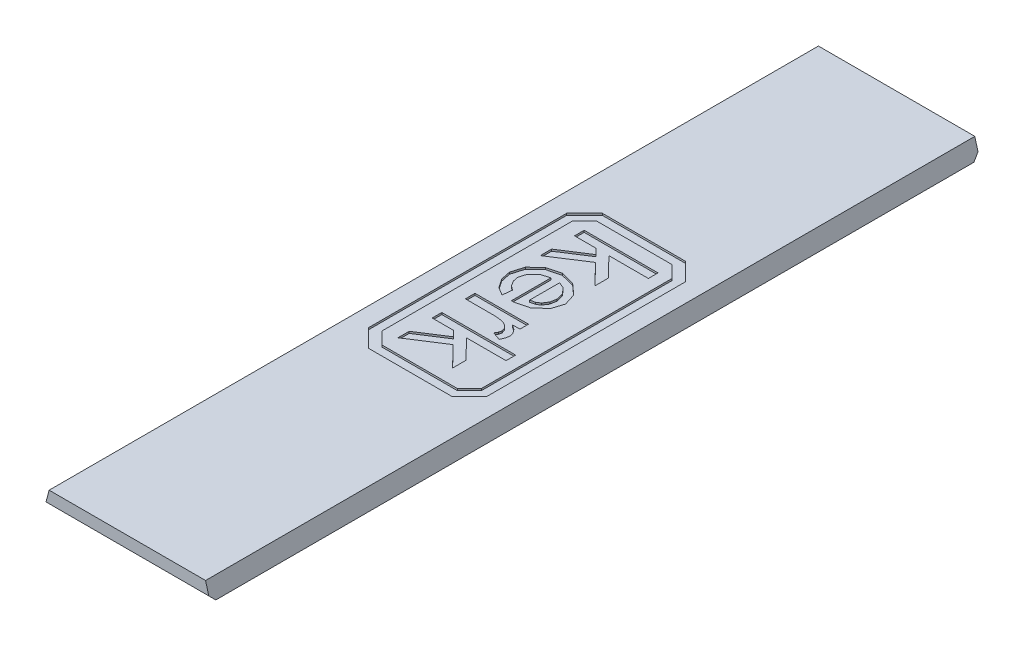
ISO-10303-21;
HEADER;
FILE_DESCRIPTION(('STEP AP214'),'2;1');
FILE_NAME('part.step','',(''),(''),'','','');
FILE_SCHEMA(('AUTOMOTIVE_DESIGN { 1 0 10303 214 1 1 1 1 }'));
ENDSEC;
DATA;
#1=APPLICATION_CONTEXT('core data for automotive mechanical design processes');
#2=APPLICATION_PROTOCOL_DEFINITION('international standard','automotive_design',2000,#1);
#3=PRODUCT_CONTEXT('',#1,'mechanical');
#4=PRODUCT('Part','Part','',(#3));
#5=PRODUCT_RELATED_PRODUCT_CATEGORY('part','',(#4));
#6=PRODUCT_DEFINITION_FORMATION('','',#4);
#7=PRODUCT_DEFINITION_CONTEXT('part definition',#1,'design');
#8=PRODUCT_DEFINITION('design','',#6,#7);
#9=PRODUCT_DEFINITION_SHAPE('','',#8);
#10=(LENGTH_UNIT() NAMED_UNIT(*) SI_UNIT(.MILLI.,.METRE.));
#11=(NAMED_UNIT(*) PLANE_ANGLE_UNIT() SI_UNIT($,.RADIAN.));
#12=(NAMED_UNIT(*) SI_UNIT($,.STERADIAN.) SOLID_ANGLE_UNIT());
#13=UNCERTAINTY_MEASURE_WITH_UNIT(LENGTH_MEASURE(1.E-05),#10,'distance_accuracy_value','');
#14=(GEOMETRIC_REPRESENTATION_CONTEXT(3) GLOBAL_UNCERTAINTY_ASSIGNED_CONTEXT((#13)) GLOBAL_UNIT_ASSIGNED_CONTEXT((#10,
#11,#12)) REPRESENTATION_CONTEXT('',''));
#15=CARTESIAN_POINT('',(0.,0.,0.));
#16=DIRECTION('',(0.,0.,1.));
#17=DIRECTION('',(1.,0.,0.));
#18=AXIS2_PLACEMENT_3D('',#15,#16,#17);
#19=CARTESIAN_POINT('',(3.54950377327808,6.20906467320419,0.));
#20=DIRECTION('',(0.,1.,0.));
#21=DIRECTION('',(0.,0.,1.));
#22=AXIS2_PLACEMENT_3D('',#19,#20,#21);
#23=PLANE('',#22);
#24=DIRECTION('',(0.,0.,1.));
#25=VECTOR('',#24,1.);
#26=CARTESIAN_POINT('',(-0.119279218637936,6.20906467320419,-18.3432173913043));
#27=LINE('',#26,#25);
#28=CARTESIAN_POINT('',(-0.119279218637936,6.20906467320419,-16.9826608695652));
#29=VERTEX_POINT('',#28);
#30=CARTESIAN_POINT('',(-0.119279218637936,6.20906467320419,-18.3432173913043));
#31=VERTEX_POINT('',#30);
#32=EDGE_CURVE('E647',#29,#31,#27,.F.);
#33=ORIENTED_EDGE('',*,*,#32,.F.);
#34=DIRECTION('',(0.97353605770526,0.,-0.228533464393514));
#35=VECTOR('',#34,1.);
#36=CARTESIAN_POINT('',(-0.119279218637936,6.20906467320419,-16.9826608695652));
#37=LINE('',#36,#35);
#38=CARTESIAN_POINT('',(0.104696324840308,6.20906467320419,-17.0352381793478));
#39=VERTEX_POINT('',#38);
#40=EDGE_CURVE('E622',#39,#29,#37,.F.);
#41=ORIENTED_EDGE('',*,*,#40,.F.);
#42=DIRECTION('',(0.840984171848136,0.,-0.541059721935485));
#43=VECTOR('',#42,1.);
#44=CARTESIAN_POINT('',(0.104696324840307,6.20906467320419,-17.0352381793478));
#45=LINE('',#44,#43);
#46=CARTESIAN_POINT('',(0.264895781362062,6.20906467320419,-17.1383048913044));
#47=VERTEX_POINT('',#46);
#48=EDGE_CURVE('E620',#47,#39,#45,.F.);
#49=ORIENTED_EDGE('',*,*,#48,.F.);
#50=DIRECTION('',(0.549847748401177,0.,-0.835264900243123));
#51=VECTOR('',#50,1.);
#52=CARTESIAN_POINT('',(0.264895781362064,6.20906467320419,-17.1383048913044));
#53=LINE('',#52,#51);
#54=CARTESIAN_POINT('',(0.414086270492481,6.20906467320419,-17.3649377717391));
#55=VERTEX_POINT('',#54);
#56=EDGE_CURVE('E19',#47,#55,#53,.T.);
#57=ORIENTED_EDGE('',*,*,#56,.T.);
#58=DIRECTION('',(0.171839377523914,0.,-0.985124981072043));
#59=VECTOR('',#58,1.);
#60=CARTESIAN_POINT('',(0.414086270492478,6.20906467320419,-17.3649377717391));
#61=LINE('',#60,#59);
#62=CARTESIAN_POINT('',(0.463816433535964,6.20906467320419,-17.6500320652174));
#63=VERTEX_POINT('',#62);
#64=EDGE_CURVE('E600',#55,#63,#61,.T.);
#65=ORIENTED_EDGE('',*,*,#64,.T.);
#66=DIRECTION('',(-0.247548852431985,0.,-0.968875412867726));
#67=VECTOR('',#66,1.);
#68=CARTESIAN_POINT('',(0.463816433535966,6.20906467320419,-17.6500320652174));
#69=LINE('',#68,#67);
#70=CARTESIAN_POINT('',(0.384475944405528,6.20906467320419,-17.9605608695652));
#71=VERTEX_POINT('',#70);
#72=EDGE_CURVE('E595',#63,#71,#69,.T.);
#73=ORIENTED_EDGE('',*,*,#72,.T.);
#74=DIRECTION('',(-0.639972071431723,0.,-0.768398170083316));
#75=VECTOR('',#74,1.);
#76=CARTESIAN_POINT('',(0.384475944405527,6.20906467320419,-17.9605608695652));
#77=LINE('',#76,#75);
#78=CARTESIAN_POINT('',(0.159361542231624,6.20906467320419,-18.23085));
#79=VERTEX_POINT('',#78);
#80=EDGE_CURVE('E656',#71,#79,#77,.T.);
#81=ORIENTED_EDGE('',*,*,#80,.T.);
#82=DIRECTION('',(-0.927427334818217,0.,-0.37400339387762));
#83=VECTOR('',#82,1.);
#84=CARTESIAN_POINT('',(0.159361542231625,6.20906467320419,-18.23085));
#85=LINE('',#84,#83);
#86=EDGE_CURVE('E626',#79,#31,#85,.T.);
#87=ORIENTED_EDGE('',*,*,#86,.T.);
#88=EDGE_LOOP('',(#33,#41,#49,#57,#65,#73,#81,#87));
#89=FACE_BOUND('',#88,.T.);
#90=ADVANCED_FACE('F16',(#89),#23,.T.);
#91=CARTESIAN_POINT('',(0.104696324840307,6.20906467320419,-17.0352381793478));
#92=DIRECTION('',(0.541059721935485,0.,0.840984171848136));
#93=DIRECTION('',(0.840984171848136,0.,-0.541059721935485));
#94=AXIS2_PLACEMENT_3D('',#91,#92,#93);
#95=PLANE('',#94);
#96=ORIENTED_EDGE('',*,*,#48,.T.);
#97=DIRECTION('',(0.,1.,0.));
#98=VECTOR('',#97,1.);
#99=CARTESIAN_POINT('',(0.104696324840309,6.20906467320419,-17.0352381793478));
#100=LINE('',#99,#98);
#101=CARTESIAN_POINT('',(0.104696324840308,6.12524467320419,-17.0352381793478));
#102=VERTEX_POINT('',#101);
#103=EDGE_CURVE('E625',#102,#39,#100,.T.);
#104=ORIENTED_EDGE('',*,*,#103,.F.);
#105=DIRECTION('',(-0.840984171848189,0.,0.541059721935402));
#106=VECTOR('',#105,1.);
#107=CARTESIAN_POINT('',(0.264895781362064,6.12524467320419,-17.1383048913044));
#108=LINE('',#107,#106);
#109=CARTESIAN_POINT('',(0.26489578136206,6.12524467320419,-17.1383048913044));
#110=VERTEX_POINT('',#109);
#111=EDGE_CURVE('E630',#110,#102,#108,.T.);
#112=ORIENTED_EDGE('',*,*,#111,.F.);
#113=DIRECTION('',(0.,1.,0.));
#114=VECTOR('',#113,1.);
#115=CARTESIAN_POINT('',(0.264895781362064,6.20906467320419,-17.1383048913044));
#116=LINE('',#115,#114);
#117=EDGE_CURVE('E616',#47,#110,#116,.F.);
#118=ORIENTED_EDGE('',*,*,#117,.F.);
#119=EDGE_LOOP('',(#96,#104,#112,#118));
#120=FACE_BOUND('',#119,.T.);
#121=ADVANCED_FACE('F628',(#120),#95,.T.);
#122=CARTESIAN_POINT('',(-0.119279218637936,6.20906467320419,-16.9826608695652));
#123=DIRECTION('',(0.228533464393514,0.,0.973536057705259));
#124=DIRECTION('',(0.97353605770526,0.,-0.228533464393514));
#125=AXIS2_PLACEMENT_3D('',#122,#123,#124);
#126=PLANE('',#125);
#127=ORIENTED_EDGE('',*,*,#40,.T.);
#128=DIRECTION('',(0.,1.,0.));
#129=VECTOR('',#128,1.);
#130=CARTESIAN_POINT('',(-0.119279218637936,6.20906467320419,-16.9826608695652));
#131=LINE('',#130,#129);
#132=CARTESIAN_POINT('',(-0.119279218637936,6.12524467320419,-16.9826608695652));
#133=VERTEX_POINT('',#132);
#134=EDGE_CURVE('E650',#133,#29,#131,.T.);
#135=ORIENTED_EDGE('',*,*,#134,.F.);
#136=DIRECTION('',(-0.973536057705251,0.,0.228533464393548));
#137=VECTOR('',#136,1.);
#138=CARTESIAN_POINT('',(0.104696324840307,6.12524467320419,-17.0352381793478));
#139=LINE('',#138,#137);
#140=EDGE_CURVE('E683',#102,#133,#139,.T.);
#141=ORIENTED_EDGE('',*,*,#140,.F.);
#142=ORIENTED_EDGE('',*,*,#103,.T.);
#143=EDGE_LOOP('',(#127,#135,#141,#142));
#144=FACE_BOUND('',#143,.T.);
#145=ADVANCED_FACE('F887',(#144),#126,.T.);
#146=CARTESIAN_POINT('',(-0.119279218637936,6.20906467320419,-18.3432173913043));
#147=DIRECTION('',(-1.,0.,0.));
#148=DIRECTION('',(0.,0.,1.));
#149=AXIS2_PLACEMENT_3D('',#146,#147,#148);
#150=PLANE('',#149);
#151=ORIENTED_EDGE('',*,*,#32,.T.);
#152=DIRECTION('',(0.,1.,0.));
#153=VECTOR('',#152,1.);
#154=CARTESIAN_POINT('',(-0.119279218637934,6.20906467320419,-18.3432173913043));
#155=LINE('',#154,#153);
#156=CARTESIAN_POINT('',(-0.119279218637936,6.12524467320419,-18.3432173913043));
#157=VERTEX_POINT('',#156);
#158=EDGE_CURVE('E644',#157,#31,#155,.T.);
#159=ORIENTED_EDGE('',*,*,#158,.F.);
#160=DIRECTION('',(0.,0.,1.));
#161=VECTOR('',#160,1.);
#162=CARTESIAN_POINT('',(-0.119279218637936,6.12524467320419,-17.6334991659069));
#163=LINE('',#162,#161);
#164=EDGE_CURVE('E678',#133,#157,#163,.F.);
#165=ORIENTED_EDGE('',*,*,#164,.F.);
#166=ORIENTED_EDGE('',*,*,#134,.T.);
#167=EDGE_LOOP('',(#151,#159,#165,#166));
#168=FACE_BOUND('',#167,.T.);
#169=ADVANCED_FACE('F889',(#168),#150,.T.);
#170=CARTESIAN_POINT('',(0.159361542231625,6.20906467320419,-18.23085));
#171=DIRECTION('',(0.37400339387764,0.,-0.927427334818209));
#172=DIRECTION('',(-0.927427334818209,0.,-0.37400339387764));
#173=AXIS2_PLACEMENT_3D('',#170,#171,#172);
#174=PLANE('',#173);
#175=ORIENTED_EDGE('',*,*,#86,.F.);
#176=DIRECTION('',(0.,1.,0.));
#177=VECTOR('',#176,1.);
#178=CARTESIAN_POINT('',(0.15936154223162,6.20906467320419,-18.23085));
#179=LINE('',#178,#177);
#180=CARTESIAN_POINT('',(0.159361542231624,6.12524467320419,-18.23085));
#181=VERTEX_POINT('',#180);
#182=EDGE_CURVE('E641',#181,#79,#179,.T.);
#183=ORIENTED_EDGE('',*,*,#182,.F.);
#184=DIRECTION('',(0.927427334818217,0.,0.37400339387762));
#185=VECTOR('',#184,1.);
#186=CARTESIAN_POINT('',(-0.119279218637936,6.12524467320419,-18.3432173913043));
#187=LINE('',#186,#185);
#188=EDGE_CURVE('E676',#157,#181,#187,.T.);
#189=ORIENTED_EDGE('',*,*,#188,.F.);
#190=ORIENTED_EDGE('',*,*,#158,.T.);
#191=EDGE_LOOP('',(#175,#183,#189,#190));
#192=FACE_BOUND('',#191,.T.);
#193=ADVANCED_FACE('F891',(#192),#174,.T.);
#194=CARTESIAN_POINT('',(0.384475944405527,6.20906467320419,-17.9605608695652));
#195=DIRECTION('',(0.768398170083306,0.,-0.639972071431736));
#196=DIRECTION('',(-0.639972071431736,0.,-0.768398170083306));
#197=AXIS2_PLACEMENT_3D('',#194,#195,#196);
#198=PLANE('',#197);
#199=ORIENTED_EDGE('',*,*,#80,.F.);
#200=DIRECTION('',(0.,1.,0.));
#201=VECTOR('',#200,1.);
#202=CARTESIAN_POINT('',(0.384475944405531,6.20906467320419,-17.9605608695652));
#203=LINE('',#202,#201);
#204=CARTESIAN_POINT('',(0.384475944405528,6.12524467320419,-17.9605608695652));
#205=VERTEX_POINT('',#204);
#206=EDGE_CURVE('E639',#205,#71,#203,.T.);
#207=ORIENTED_EDGE('',*,*,#206,.F.);
#208=DIRECTION('',(0.639972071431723,0.,0.768398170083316));
#209=VECTOR('',#208,1.);
#210=CARTESIAN_POINT('',(0.159361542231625,6.12524467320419,-18.23085));
#211=LINE('',#210,#209);
#212=EDGE_CURVE('E669',#181,#205,#211,.T.);
#213=ORIENTED_EDGE('',*,*,#212,.F.);
#214=ORIENTED_EDGE('',*,*,#182,.T.);
#215=EDGE_LOOP('',(#199,#207,#213,#214));
#216=FACE_BOUND('',#215,.T.);
#217=ADVANCED_FACE('F660',(#216),#198,.T.);
#218=CARTESIAN_POINT('',(0.463816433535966,6.20906467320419,-17.6500320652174));
#219=DIRECTION('',(0.968875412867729,0.,-0.247548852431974));
#220=DIRECTION('',(-0.247548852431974,0.,-0.968875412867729));
#221=AXIS2_PLACEMENT_3D('',#218,#219,#220);
#222=PLANE('',#221);
#223=ORIENTED_EDGE('',*,*,#72,.F.);
#224=DIRECTION('',(0.,1.,0.));
#225=VECTOR('',#224,1.);
#226=CARTESIAN_POINT('',(0.463816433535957,6.20906467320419,-17.6500320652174));
#227=LINE('',#226,#225);
#228=CARTESIAN_POINT('',(0.463816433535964,6.12524467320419,-17.6500320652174));
#229=VERTEX_POINT('',#228);
#230=EDGE_CURVE('E606',#229,#63,#227,.T.);
#231=ORIENTED_EDGE('',*,*,#230,.F.);
#232=DIRECTION('',(0.247548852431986,0.,0.968875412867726));
#233=VECTOR('',#232,1.);
#234=CARTESIAN_POINT('',(0.384475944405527,6.12524467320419,-17.9605608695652));
#235=LINE('',#234,#233);
#236=EDGE_CURVE('E665',#205,#229,#235,.T.);
#237=ORIENTED_EDGE('',*,*,#236,.F.);
#238=ORIENTED_EDGE('',*,*,#206,.T.);
#239=EDGE_LOOP('',(#223,#231,#237,#238));
#240=FACE_BOUND('',#239,.T.);
#241=ADVANCED_FACE('F663',(#240),#222,.T.);
#242=CARTESIAN_POINT('',(0.414086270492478,6.20906467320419,-17.3649377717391));
#243=DIRECTION('',(0.985124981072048,0.,0.171839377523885));
#244=DIRECTION('',(0.171839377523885,0.,-0.985124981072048));
#245=AXIS2_PLACEMENT_3D('',#242,#243,#244);
#246=PLANE('',#245);
#247=ORIENTED_EDGE('',*,*,#64,.F.);
#248=DIRECTION('',(0.,1.,0.));
#249=VECTOR('',#248,1.);
#250=CARTESIAN_POINT('',(0.414086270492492,6.20906467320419,-17.3649377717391));
#251=LINE('',#250,#249);
#252=CARTESIAN_POINT('',(0.414086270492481,6.12524467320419,-17.3649377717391));
#253=VERTEX_POINT('',#252);
#254=EDGE_CURVE('E604',#253,#55,#251,.T.);
#255=ORIENTED_EDGE('',*,*,#254,.F.);
#256=DIRECTION('',(-0.171839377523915,0.,0.985124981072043));
#257=VECTOR('',#256,1.);
#258=CARTESIAN_POINT('',(0.463816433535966,6.12524467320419,-17.6500320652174));
#259=LINE('',#258,#257);
#260=EDGE_CURVE('E668',#229,#253,#259,.T.);
#261=ORIENTED_EDGE('',*,*,#260,.F.);
#262=ORIENTED_EDGE('',*,*,#230,.T.);
#263=EDGE_LOOP('',(#247,#255,#261,#262));
#264=FACE_BOUND('',#263,.T.);
#265=ADVANCED_FACE('F602',(#264),#246,.T.);
#266=CARTESIAN_POINT('',(0.264895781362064,6.20906467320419,-17.1383048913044));
#267=DIRECTION('',(0.835264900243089,0.,0.54984774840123));
#268=DIRECTION('',(0.549847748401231,0.,-0.835264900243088));
#269=AXIS2_PLACEMENT_3D('',#266,#267,#268);
#270=PLANE('',#269);
#271=ORIENTED_EDGE('',*,*,#56,.F.);
#272=ORIENTED_EDGE('',*,*,#117,.T.);
#273=DIRECTION('',(-0.549847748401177,0.,0.835264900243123));
#274=VECTOR('',#273,1.);
#275=CARTESIAN_POINT('',(0.414086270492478,6.12524467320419,-17.3649377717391));
#276=LINE('',#275,#274);
#277=EDGE_CURVE('E614',#253,#110,#276,.T.);
#278=ORIENTED_EDGE('',*,*,#277,.F.);
#279=ORIENTED_EDGE('',*,*,#254,.T.);
#280=EDGE_LOOP('',(#271,#272,#278,#279));
#281=FACE_BOUND('',#280,.T.);
#282=ADVANCED_FACE('F610',(#281),#270,.T.);
#283=CARTESIAN_POINT('',(-0.556113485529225,6.12524467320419,-17.6334991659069));
#284=DIRECTION('',(0.,1.,0.));
#285=DIRECTION('',(0.,0.,1.));
#286=AXIS2_PLACEMENT_3D('',#283,#284,#285);
#287=PLANE('',#286);
#288=ORIENTED_EDGE('',*,*,#260,.T.);
#289=ORIENTED_EDGE('',*,*,#277,.T.);
#290=ORIENTED_EDGE('',*,*,#111,.T.);
#291=ORIENTED_EDGE('',*,*,#140,.T.);
#292=ORIENTED_EDGE('',*,*,#164,.T.);
#293=ORIENTED_EDGE('',*,*,#188,.T.);
#294=ORIENTED_EDGE('',*,*,#212,.T.);
#295=ORIENTED_EDGE('',*,*,#236,.T.);
#296=EDGE_LOOP('',(#288,#289,#290,#291,#292,#293,#294,#295));
#297=FACE_BOUND('',#296,.T.);
#298=DIRECTION('',(0.568240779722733,0.,0.822862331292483));
#299=VECTOR('',#298,1.);
#300=CARTESIAN_POINT('',(-1.5785368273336,6.12524467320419,-17.1724706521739));
#301=LINE('',#300,#299);
#302=CARTESIAN_POINT('',(-1.57853682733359,6.12524467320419,-17.1724706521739));
#303=VERTEX_POINT('',#302);
#304=CARTESIAN_POINT('',(-1.30065530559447,6.12524467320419,-16.7700739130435));
#305=VERTEX_POINT('',#304);
#306=EDGE_CURVE('E795',#303,#305,#301,.T.);
#307=ORIENTED_EDGE('',*,*,#306,.T.);
#308=DIRECTION('',(0.859753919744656,0.,0.510708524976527));
#309=VECTOR('',#308,1.);
#310=CARTESIAN_POINT('',(-1.30065530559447,6.12524467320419,-16.7700739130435));
#311=LINE('',#310,#309);
#312=CARTESIAN_POINT('',(-0.945331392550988,6.12524467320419,-16.5590054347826));
#313=VERTEX_POINT('',#312);
#314=EDGE_CURVE('E799',#305,#313,#311,.T.);
#315=ORIENTED_EDGE('',*,*,#314,.T.);
#316=DIRECTION('',(0.112751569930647,0.,-0.993623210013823));
#317=VECTOR('',#316,1.);
#318=CARTESIAN_POINT('',(-0.945331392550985,6.12524467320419,-16.5590054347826));
#319=LINE('',#318,#317);
#320=CARTESIAN_POINT('',(-0.896740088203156,6.12524467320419,-16.9872163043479));
#321=VERTEX_POINT('',#320);
#322=EDGE_CURVE('E804',#313,#321,#319,.T.);
#323=ORIENTED_EDGE('',*,*,#322,.T.);
#324=DIRECTION('',(-0.801465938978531,0.,-0.598040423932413));
#325=VECTOR('',#324,1.);
#326=CARTESIAN_POINT('',(-0.896740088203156,6.12524467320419,-16.9872163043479));
#327=LINE('',#326,#325);
#328=CARTESIAN_POINT('',(-1.09566074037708,6.12524467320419,-17.1356475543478));
#329=VERTEX_POINT('',#328);
#330=EDGE_CURVE('E631',#321,#329,#327,.T.);
#331=ORIENTED_EDGE('',*,*,#330,.T.);
#332=DIRECTION('',(-0.518119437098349,0.,-0.855308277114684));
#333=VECTOR('',#332,1.);
#334=CARTESIAN_POINT('',(-1.09566074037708,6.12524467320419,-17.1356475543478));
#335=LINE('',#334,#333);
#336=CARTESIAN_POINT('',(-1.23915693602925,6.12524467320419,-17.3725301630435));
#337=VERTEX_POINT('',#336);
#338=EDGE_CURVE('E634',#329,#337,#335,.T.);
#339=ORIENTED_EDGE('',*,*,#338,.T.);
#340=DIRECTION('',(-0.184745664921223,0.,-0.982786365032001));
#341=VECTOR('',#340,1.);
#342=CARTESIAN_POINT('',(-1.23915693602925,6.12524467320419,-17.3725301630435));
#343=LINE('',#342,#341);
#344=CARTESIAN_POINT('',(-1.28547052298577,6.12524467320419,-17.6189032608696));
#345=VERTEX_POINT('',#344);
#346=EDGE_CURVE('E695',#337,#345,#343,.T.);
#347=ORIENTED_EDGE('',*,*,#346,.T.);
#348=DIRECTION('',(0.294399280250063,0.,-0.955682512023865));
#349=VECTOR('',#348,1.);
#350=CARTESIAN_POINT('',(-1.28547052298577,6.12524467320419,-17.6189032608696));
#351=LINE('',#350,#349);
#352=CARTESIAN_POINT('',(-1.18525095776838,6.12524467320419,-17.9442372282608));
#353=VERTEX_POINT('',#352);
#354=EDGE_CURVE('E692',#345,#353,#351,.T.);
#355=ORIENTED_EDGE('',*,*,#354,.T.);
#356=DIRECTION('',(0.722995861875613,0.,-0.690852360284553));
#357=VECTOR('',#356,1.);
#358=CARTESIAN_POINT('',(-1.18525095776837,6.12524467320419,-17.9442372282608));
#359=LINE('',#358,#357);
#360=CARTESIAN_POINT('',(-0.89066617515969,6.12524467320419,-18.2257251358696));
#361=VERTEX_POINT('',#360);
#362=EDGE_CURVE('E689',#353,#361,#359,.T.);
#363=ORIENTED_EDGE('',*,*,#362,.T.);
#364=DIRECTION('',(0.955953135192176,0.,-0.293519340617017));
#365=VECTOR('',#364,1.);
#366=CARTESIAN_POINT('',(-0.890666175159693,6.12524467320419,-18.2257251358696));
#367=LINE('',#366,#365);
#368=CARTESIAN_POINT('',(-0.508009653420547,6.12524467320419,-18.3432173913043));
#369=VERTEX_POINT('',#368);
#370=EDGE_CURVE('E687',#361,#369,#367,.T.);
#371=ORIENTED_EDGE('',*,*,#370,.T.);
#372=DIRECTION('',(0.,0.,1.));
#373=VECTOR('',#372,1.);
#374=CARTESIAN_POINT('',(-0.508009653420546,6.12524467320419,-18.3432173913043));
#375=LINE('',#374,#373);
#376=CARTESIAN_POINT('',(-0.508009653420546,6.12524467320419,-16.5476168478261));
#377=VERTEX_POINT('',#376);
#378=EDGE_CURVE('E730',#369,#377,#375,.T.);
#379=ORIENTED_EDGE('',*,*,#378,.T.);
#380=DIRECTION('',(0.999634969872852,0.,0.027017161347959));
#381=VECTOR('',#380,1.);
#382=CARTESIAN_POINT('',(-0.508009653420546,6.12524467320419,-16.5476168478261));
#383=LINE('',#382,#381);
#384=CARTESIAN_POINT('',(-0.444802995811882,6.12524467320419,-16.5459085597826));
#385=VERTEX_POINT('',#384);
#386=EDGE_CURVE('E735',#377,#385,#383,.T.);
#387=ORIENTED_EDGE('',*,*,#386,.T.);
#388=DIRECTION('',(0.999921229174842,0.,0.012551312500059));
#389=VECTOR('',#388,1.);
#390=CARTESIAN_POINT('',(-0.444802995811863,6.12524467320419,-16.5459085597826));
#391=LINE('',#390,#389);
#392=CARTESIAN_POINT('',(-0.399438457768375,6.12524467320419,-16.5453391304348));
#393=VERTEX_POINT('',#392);
#394=EDGE_CURVE('E740',#385,#393,#391,.T.);
#395=ORIENTED_EDGE('',*,*,#394,.T.);
#396=DIRECTION('',(0.969590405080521,0.,-0.244733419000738));
#397=VECTOR('',#396,1.);
#398=CARTESIAN_POINT('',(-0.399438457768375,6.12524467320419,-16.5453391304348));
#399=LINE('',#398,#397);
#400=CARTESIAN_POINT('',(0.211179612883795,6.12524467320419,-16.699464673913));
#401=VERTEX_POINT('',#400);
#402=EDGE_CURVE('E745',#393,#401,#399,.T.);
#403=ORIENTED_EDGE('',*,*,#402,.T.);
#404=DIRECTION('',(0.743088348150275,0.,-0.669193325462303));
#405=VECTOR('',#404,1.);
#406=CARTESIAN_POINT('',(0.211179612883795,6.12524467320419,-16.699464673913));
#407=LINE('',#406,#405);
#408=CARTESIAN_POINT('',(0.688361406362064,6.12524467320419,-17.1291940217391));
#409=VERTEX_POINT('',#408);
#410=EDGE_CURVE('E750',#401,#409,#407,.T.);
#411=ORIENTED_EDGE('',*,*,#410,.T.);
#412=DIRECTION('',(0.301849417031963,0.,-0.953355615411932));
#413=VECTOR('',#412,1.);
#414=CARTESIAN_POINT('',(0.688361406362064,6.12524467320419,-17.1291940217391));
#415=LINE('',#414,#413);
#416=CARTESIAN_POINT('',(0.852546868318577,6.12524467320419,-17.6477543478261));
#417=VERTEX_POINT('',#416);
#418=EDGE_CURVE('E755',#409,#417,#415,.T.);
#419=ORIENTED_EDGE('',*,*,#418,.T.);
#420=DIRECTION('',(-0.300434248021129,0.,-0.953802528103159));
#421=VECTOR('',#420,1.);
#422=CARTESIAN_POINT('',(0.852546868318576,6.12524467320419,-17.6477543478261));
#423=LINE('',#422,#421);
#424=CARTESIAN_POINT('',(0.684185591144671,6.12524467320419,-18.1822586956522));
#425=VERTEX_POINT('',#424);
#426=EDGE_CURVE('E760',#417,#425,#423,.T.);
#427=ORIENTED_EDGE('',*,*,#426,.T.);
#428=DIRECTION('',(-0.743036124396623,0.,-0.66925131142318));
#429=VECTOR('',#428,1.);
#430=CARTESIAN_POINT('',(0.684185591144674,6.12524467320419,-18.1822586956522));
#431=LINE('',#430,#429);
#432=CARTESIAN_POINT('',(0.194855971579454,6.12524467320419,-18.6229970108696));
#433=VERTEX_POINT('',#432);
#434=EDGE_CURVE('E765',#425,#433,#431,.T.);
#435=ORIENTED_EDGE('',*,*,#434,.T.);
#436=DIRECTION('',(-0.969778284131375,0.,-0.243987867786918));
#437=VECTOR('',#436,1.);
#438=CARTESIAN_POINT('',(0.194855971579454,6.12524467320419,-18.6229970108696));
#439=LINE('',#438,#437);
#440=CARTESIAN_POINT('',(-0.431326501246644,6.12524467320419,-18.7805391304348));
#441=VERTEX_POINT('',#440);
#442=EDGE_CURVE('E770',#433,#441,#439,.T.);
#443=ORIENTED_EDGE('',*,*,#442,.T.);
#444=DIRECTION('',(-0.968459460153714,0.,0.24917117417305));
#445=VECTOR('',#444,1.);
#446=CARTESIAN_POINT('',(-0.431326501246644,6.12524467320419,-18.7805391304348));
#447=LINE('',#446,#445);
#448=CARTESIAN_POINT('',(-1.03700951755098,6.12524467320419,-18.624705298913));
#449=VERTEX_POINT('',#448);
#450=EDGE_CURVE('E775',#441,#449,#447,.T.);
#451=ORIENTED_EDGE('',*,*,#450,.T.);
#452=DIRECTION('',(-0.729236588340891,0.,0.684261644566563));
#453=VECTOR('',#452,1.);
#454=CARTESIAN_POINT('',(-1.03700951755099,6.12524467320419,-18.624705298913));
#455=LINE('',#454,#453);
#456=CARTESIAN_POINT('',(-1.51096454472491,6.12524467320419,-18.1799809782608));
#457=VERTEX_POINT('',#456);
#458=EDGE_CURVE('E780',#449,#457,#455,.T.);
#459=ORIENTED_EDGE('',*,*,#458,.T.);
#460=DIRECTION('',(-0.28216632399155,0.,0.95936550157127));
#461=VECTOR('',#460,1.);
#462=CARTESIAN_POINT('',(-1.51096454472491,6.12524467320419,-18.1799809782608));
#463=LINE('',#462,#461);
#464=CARTESIAN_POINT('',(-1.67420095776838,6.12524467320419,-17.624977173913));
#465=VERTEX_POINT('',#464);
#466=EDGE_CURVE('E785',#457,#465,#463,.T.);
#467=ORIENTED_EDGE('',*,*,#466,.T.);
#468=DIRECTION('',(0.206837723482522,0.,0.978375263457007));
#469=VECTOR('',#468,1.);
#470=CARTESIAN_POINT('',(-1.67420095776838,6.12524467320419,-17.624977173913));
#471=LINE('',#470,#469);
#472=EDGE_CURVE('E790',#465,#303,#471,.T.);
#473=ORIENTED_EDGE('',*,*,#472,.T.);
#474=EDGE_LOOP('',(#307,#315,#323,#331,#339,#347,#355,#363,#371,#379,#387,#395,#403,#411,#419,
#427,#435,#443,#451,#459,#467,#473));
#475=FACE_BOUND('',#474,.T.);
#476=ADVANCED_FACE('F672',(#297,#475),#287,.T.);
#477=CARTESIAN_POINT('',(-0.143982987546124,6.12524467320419,-20.2100331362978));
#478=DIRECTION('',(0.,1.,0.));
#479=DIRECTION('',(0.,0.,1.));
#480=AXIS2_PLACEMENT_3D('',#477,#478,#479);
#481=PLANE('',#480);
#482=DIRECTION('',(1.,0.,0.));
#483=VECTOR('',#482,1.);
#484=CARTESIAN_POINT('',(-0.0646140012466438,6.12524467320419,-20.5298260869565));
#485=LINE('',#484,#483);
#486=CARTESIAN_POINT('',(-0.0646140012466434,6.12524467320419,-20.5298260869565));
#487=VERTEX_POINT('',#486);
#488=CARTESIAN_POINT('',(1.72719034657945,6.12524467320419,-20.5298260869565));
#489=VERTEX_POINT('',#488);
#490=EDGE_CURVE('E1698',#487,#489,#485,.T.);
#491=ORIENTED_EDGE('',*,*,#490,.T.);
#492=DIRECTION('',(0.,0.,-1.));
#493=VECTOR('',#492,1.);
#494=CARTESIAN_POINT('',(1.72719034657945,6.12524467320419,-20.5298260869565));
#495=LINE('',#494,#493);
#496=CARTESIAN_POINT('',(1.72719034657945,6.12524467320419,-20.9671478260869));
#497=VERTEX_POINT('',#496);
#498=EDGE_CURVE('E1701',#489,#497,#495,.T.);
#499=ORIENTED_EDGE('',*,*,#498,.T.);
#500=DIRECTION('',(-1.,0.,0.));
#501=VECTOR('',#500,1.);
#502=CARTESIAN_POINT('',(1.72719034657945,6.12524467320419,-20.9671478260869));
#503=LINE('',#502,#501);
#504=CARTESIAN_POINT('',(-1.62560965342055,6.12524467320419,-20.9671478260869));
#505=VERTEX_POINT('',#504);
#506=EDGE_CURVE('E717',#497,#505,#503,.T.);
#507=ORIENTED_EDGE('',*,*,#506,.T.);
#508=DIRECTION('',(0.,0.,1.));
#509=VECTOR('',#508,1.);
#510=CARTESIAN_POINT('',(-1.62560965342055,6.12524467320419,-20.2100331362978));
#511=LINE('',#510,#509);
#512=CARTESIAN_POINT('',(-1.62560965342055,6.12524467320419,-20.5298260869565));
#513=VERTEX_POINT('',#512);
#514=EDGE_CURVE('E881',#505,#513,#511,.T.);
#515=ORIENTED_EDGE('',*,*,#514,.T.);
#516=DIRECTION('',(1.,0.,0.));
#517=VECTOR('',#516,1.);
#518=CARTESIAN_POINT('',(-0.143982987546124,6.12524467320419,-20.5298260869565));
#519=LINE('',#518,#517);
#520=CARTESIAN_POINT('',(-0.653024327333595,6.12524467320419,-20.5298260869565));
#521=VERTEX_POINT('',#520);
#522=EDGE_CURVE('E878',#513,#521,#519,.T.);
#523=ORIENTED_EDGE('',*,*,#522,.T.);
#524=DIRECTION('',(0.695279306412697,0.,0.718739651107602));
#525=VECTOR('',#524,1.);
#526=CARTESIAN_POINT('',(-0.653024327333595,6.12524467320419,-20.5298260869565));
#527=LINE('',#526,#525);
#528=CARTESIAN_POINT('',(-0.405512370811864,6.12524467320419,-20.2739625));
#529=VERTEX_POINT('',#528);
#530=EDGE_CURVE('E875',#521,#529,#527,.T.);
#531=ORIENTED_EDGE('',*,*,#530,.T.);
#532=DIRECTION('',(-0.840004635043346,0.,0.542579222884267));
#533=VECTOR('',#532,1.);
#534=CARTESIAN_POINT('',(-0.405512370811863,6.12524467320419,-20.2739625));
#535=LINE('',#534,#533);
#536=CARTESIAN_POINT('',(-1.62560965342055,6.12524467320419,-19.4858722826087));
#537=VERTEX_POINT('',#536);
#538=EDGE_CURVE('E872',#529,#537,#535,.T.);
#539=ORIENTED_EDGE('',*,*,#538,.T.);
#540=DIRECTION('',(0.,0.,1.));
#541=VECTOR('',#540,1.);
#542=CARTESIAN_POINT('',(-1.62560965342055,6.12524467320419,-20.2100331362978));
#543=LINE('',#542,#541);
#544=CARTESIAN_POINT('',(-1.62560965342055,6.12524467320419,-18.9749043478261));
#545=VERTEX_POINT('',#544);
#546=EDGE_CURVE('E870',#537,#545,#543,.T.);
#547=ORIENTED_EDGE('',*,*,#546,.T.);
#548=DIRECTION('',(0.839884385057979,0.,-0.54276534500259));
#549=VECTOR('',#548,1.);
#550=CARTESIAN_POINT('',(-1.62560965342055,6.12524467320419,-18.9749043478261));
#551=LINE('',#550,#549);
#552=CARTESIAN_POINT('',(-0.101816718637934,6.12524467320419,-19.9596375));
#553=VERTEX_POINT('',#552);
#554=EDGE_CURVE('E1743',#545,#553,#551,.T.);
#555=ORIENTED_EDGE('',*,*,#554,.T.);
#556=DIRECTION('',(0.695353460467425,0.,0.718667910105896));
#557=VECTOR('',#556,1.);
#558=CARTESIAN_POINT('',(-0.101816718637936,6.12524467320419,-19.9596375));
#559=LINE('',#558,#557);
#560=CARTESIAN_POINT('',(0.80395556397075,6.12524467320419,-19.0234956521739));
#561=VERTEX_POINT('',#560);
#562=EDGE_CURVE('E1748',#553,#561,#559,.T.);
#563=ORIENTED_EDGE('',*,*,#562,.T.);
#564=DIRECTION('',(0.,0.,-1.));
#565=VECTOR('',#564,1.);
#566=CARTESIAN_POINT('',(0.803955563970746,6.12524467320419,-19.0234956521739));
#567=LINE('',#566,#565);
#568=CARTESIAN_POINT('',(0.803955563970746,6.12524467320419,-19.6316461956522));
#569=VERTEX_POINT('',#568);
#570=EDGE_CURVE('E1753',#561,#569,#567,.T.);
#571=ORIENTED_EDGE('',*,*,#570,.T.);
#572=DIRECTION('',(-0.695158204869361,0.,-0.718856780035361));
#573=VECTOR('',#572,1.);
#574=CARTESIAN_POINT('',(0.803955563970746,6.12524467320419,-19.6316461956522));
#575=LINE('',#574,#573);
#576=EDGE_CURVE('E1704',#569,#487,#575,.T.);
#577=ORIENTED_EDGE('',*,*,#576,.T.);
#578=EDGE_LOOP('',(#491,#499,#507,#515,#523,#531,#539,#547,#555,#563,#571,#577));
#579=FACE_BOUND('',#578,.T.);
#580=ADVANCED_FACE('F1267',(#579),#481,.T.);
#581=CARTESIAN_POINT('',(-0.156980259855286,6.12524467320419,-15.6143189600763));
#582=DIRECTION('',(0.,1.,0.));
#583=DIRECTION('',(0.,0.,1.));
#584=AXIS2_PLACEMENT_3D('',#581,#582,#583);
#585=PLANE('',#584);
#586=DIRECTION('',(1.,0.,0.));
#587=VECTOR('',#586,1.);
#588=CARTESIAN_POINT('',(-0.156980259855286,6.12524467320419,-15.6221043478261));
#589=LINE('',#588,#587);
#590=CARTESIAN_POINT('',(0.466094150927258,6.12524467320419,-15.6221043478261));
#591=VERTEX_POINT('',#590);
#592=CARTESIAN_POINT('',(0.803955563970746,6.12524467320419,-15.6221043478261));
#593=VERTEX_POINT('',#592);
#594=EDGE_CURVE('E822',#591,#593,#589,.T.);
#595=ORIENTED_EDGE('',*,*,#594,.T.);
#596=DIRECTION('',(0.,0.,1.));
#597=VECTOR('',#596,1.);
#598=CARTESIAN_POINT('',(0.803955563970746,6.12524467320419,-15.6143189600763));
#599=LINE('',#598,#597);
#600=CARTESIAN_POINT('',(0.803955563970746,6.12524467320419,-16.0108347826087));
#601=VERTEX_POINT('',#600);
#602=EDGE_CURVE('E820',#593,#601,#599,.F.);
#603=ORIENTED_EDGE('',*,*,#602,.T.);
#604=DIRECTION('',(-1.,0.,0.));
#605=VECTOR('',#604,1.);
#606=CARTESIAN_POINT('',(0.803955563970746,6.12524467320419,-16.0108347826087));
#607=LINE('',#606,#605);
#608=CARTESIAN_POINT('',(-1.62560965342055,6.12524467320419,-16.0108347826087));
#609=VERTEX_POINT('',#608);
#610=EDGE_CURVE('E1726',#601,#609,#607,.T.);
#611=ORIENTED_EDGE('',*,*,#610,.T.);
#612=DIRECTION('',(0.,0.,1.));
#613=VECTOR('',#612,1.);
#614=CARTESIAN_POINT('',(-1.62560965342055,6.12524467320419,-15.6143189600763));
#615=LINE('',#614,#613);
#616=CARTESIAN_POINT('',(-1.62560965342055,6.12524467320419,-15.5735130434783));
#617=VERTEX_POINT('',#616);
#618=EDGE_CURVE('E867',#609,#617,#615,.T.);
#619=ORIENTED_EDGE('',*,*,#618,.T.);
#620=DIRECTION('',(1.,0.,0.));
#621=VECTOR('',#620,1.);
#622=CARTESIAN_POINT('',(-0.156980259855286,6.12524467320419,-15.5735130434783));
#623=LINE('',#622,#621);
#624=CARTESIAN_POINT('',(-0.334903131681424,6.12524467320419,-15.5735130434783));
#625=VERTEX_POINT('',#624);
#626=EDGE_CURVE('E864',#617,#625,#623,.T.);
#627=ORIENTED_EDGE('',*,*,#626,.T.);
#628=DIRECTION('',(0.998087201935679,0.,0.0618218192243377));
#629=VECTOR('',#628,1.);
#630=CARTESIAN_POINT('',(-0.334903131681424,6.12524467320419,-15.5735130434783));
#631=LINE('',#630,#629);
#632=CARTESIAN_POINT('',(-0.0805580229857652,6.12524467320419,-15.5577588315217));
#633=VERTEX_POINT('',#632);
#634=EDGE_CURVE('E861',#625,#633,#631,.T.);
#635=ORIENTED_EDGE('',*,*,#634,.T.);
#636=DIRECTION('',(0.980055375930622,0.,0.198724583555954));
#637=VECTOR('',#636,1.);
#638=CARTESIAN_POINT('',(-0.0805580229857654,6.12524467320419,-15.5577588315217));
#639=LINE('',#638,#637);
#640=CARTESIAN_POINT('',(0.152528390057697,6.12524467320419,-15.5104961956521));
#641=VERTEX_POINT('',#640);
#642=EDGE_CURVE('E858',#633,#641,#639,.T.);
#643=ORIENTED_EDGE('',*,*,#642,.T.);
#644=DIRECTION('',(0.88259836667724,0.,0.470127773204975));
#645=VECTOR('',#644,1.);
#646=CARTESIAN_POINT('',(0.152528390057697,6.12524467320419,-15.5104961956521));
#647=LINE('',#646,#645);
#648=CARTESIAN_POINT('',(0.303616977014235,6.12524467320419,-15.4300168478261));
#649=VERTEX_POINT('',#648);
#650=EDGE_CURVE('E855',#641,#649,#647,.T.);
#651=ORIENTED_EDGE('',*,*,#650,.T.);
#652=DIRECTION('',(0.652589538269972,0.,0.757711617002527));
#653=VECTOR('',#652,1.);
#654=CARTESIAN_POINT('',(0.303616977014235,6.12524467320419,-15.4300168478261));
#655=LINE('',#654,#653);
#656=CARTESIAN_POINT('',(0.42262771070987,6.12524467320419,-15.291835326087));
#657=VERTEX_POINT('',#656);
#658=EDGE_CURVE('E852',#649,#657,#655,.T.);
#659=ORIENTED_EDGE('',*,*,#658,.T.);
#660=DIRECTION('',(0.282801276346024,0.,0.959178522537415));
#661=VECTOR('',#660,1.);
#662=CARTESIAN_POINT('',(0.422627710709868,6.12524467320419,-15.291835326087));
#663=LINE('',#662,#661);
#664=CARTESIAN_POINT('',(0.463816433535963,6.12524467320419,-15.1521353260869));
#665=VERTEX_POINT('',#664);
#666=EDGE_CURVE('E849',#657,#665,#663,.T.);
#667=ORIENTED_EDGE('',*,*,#666,.T.);
#668=DIRECTION('',(-0.192440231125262,0.,0.981308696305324));
#669=VECTOR('',#668,1.);
#670=CARTESIAN_POINT('',(0.463816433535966,6.12524467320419,-15.1521353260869));
#671=LINE('',#670,#669);
#672=CARTESIAN_POINT('',(0.437053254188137,6.12524467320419,-15.0156620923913));
#673=VERTEX_POINT('',#672);
#674=EDGE_CURVE('E846',#665,#673,#671,.T.);
#675=ORIENTED_EDGE('',*,*,#674,.T.);
#676=DIRECTION('',(-0.508122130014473,0.,0.861285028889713));
#677=VECTOR('',#676,1.);
#678=CARTESIAN_POINT('',(0.437053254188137,6.12524467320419,-15.0156620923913));
#679=LINE('',#678,#677);
#680=CARTESIAN_POINT('',(0.35676371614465,6.12524467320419,-14.8795684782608));
#681=VERTEX_POINT('',#680);
#682=EDGE_CURVE('E843',#673,#681,#679,.T.);
#683=ORIENTED_EDGE('',*,*,#682,.T.);
#684=DIRECTION('',(0.943411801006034,0.,0.331623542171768));
#685=VECTOR('',#684,1.);
#686=CARTESIAN_POINT('',(0.356763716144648,6.12524467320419,-14.8795684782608));
#687=LINE('',#686,#685);
#688=CARTESIAN_POINT('',(0.732587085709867,6.12524467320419,-14.7474608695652));
#689=VERTEX_POINT('',#688);
#690=EDGE_CURVE('E840',#681,#689,#687,.T.);
#691=ORIENTED_EDGE('',*,*,#690,.T.);
#692=DIRECTION('',(0.416050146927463,0.,-0.909341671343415));
#693=VECTOR('',#692,1.);
#694=CARTESIAN_POINT('',(0.732587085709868,6.12524467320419,-14.7474608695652));
#695=LINE('',#694,#693);
#696=CARTESIAN_POINT('',(0.822556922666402,6.12524467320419,-14.9441038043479));
#697=VERTEX_POINT('',#696);
#698=EDGE_CURVE('E837',#689,#697,#695,.T.);
#699=ORIENTED_EDGE('',*,*,#698,.T.);
#700=DIRECTION('',(0.153076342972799,0.,-0.988214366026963));
#701=VECTOR('',#700,1.);
#702=CARTESIAN_POINT('',(0.822556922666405,6.12524467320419,-14.9441038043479));
#703=LINE('',#702,#701);
#704=CARTESIAN_POINT('',(0.852546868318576,6.12524467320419,-15.1377097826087));
#705=VERTEX_POINT('',#704);
#706=EDGE_CURVE('E834',#697,#705,#703,.T.);
#707=ORIENTED_EDGE('',*,*,#706,.T.);
#708=DIRECTION('',(-0.236351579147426,0.,-0.971667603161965));
#709=VECTOR('',#708,1.);
#710=CARTESIAN_POINT('',(0.852546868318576,6.12524467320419,-15.1377097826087));
#711=LINE('',#710,#709);
#712=CARTESIAN_POINT('',(0.814964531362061,6.12524467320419,-15.2922149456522));
#713=VERTEX_POINT('',#712);
#714=EDGE_CURVE('E831',#705,#713,#711,.T.);
#715=ORIENTED_EDGE('',*,*,#714,.T.);
#716=DIRECTION('',(-0.605191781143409,0.,-0.79607971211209));
#717=VECTOR('',#716,1.);
#718=CARTESIAN_POINT('',(0.814964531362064,6.12524467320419,-15.2922149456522));
#719=LINE('',#718,#717);
#720=CARTESIAN_POINT('',(0.680769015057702,6.12524467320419,-15.4687380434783));
#721=VERTEX_POINT('',#720);
#722=EDGE_CURVE('E828',#713,#721,#719,.T.);
#723=ORIENTED_EDGE('',*,*,#722,.T.);
#724=DIRECTION('',(-0.813684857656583,0.,-0.581306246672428));
#725=VECTOR('',#724,1.);
#726=CARTESIAN_POINT('',(0.680769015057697,6.12524467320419,-15.4687380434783));
#727=LINE('',#726,#725);
#728=EDGE_CURVE('E825',#721,#591,#727,.T.);
#729=ORIENTED_EDGE('',*,*,#728,.T.);
#730=EDGE_LOOP('',(#595,#603,#611,#619,#627,#635,#643,#651,#659,#667,#675,#683,#691,#699,#707,
#715,#723,#729));
#731=FACE_BOUND('',#730,.T.);
#732=ADVANCED_FACE('F1263',(#731),#585,.T.);
#733=CARTESIAN_POINT('',(-0.143982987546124,6.12524467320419,-13.747389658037));
#734=DIRECTION('',(0.,1.,0.));
#735=DIRECTION('',(0.,0.,1.));
#736=AXIS2_PLACEMENT_3D('',#733,#734,#735);
#737=PLANE('',#736);
#738=DIRECTION('',(1.,0.,0.));
#739=VECTOR('',#738,1.);
#740=CARTESIAN_POINT('',(-0.0646140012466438,6.12524467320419,-14.0671826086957));
#741=LINE('',#740,#739);
#742=CARTESIAN_POINT('',(-0.0646140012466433,6.12524467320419,-14.0671826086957));
#743=VERTEX_POINT('',#742);
#744=CARTESIAN_POINT('',(1.72719034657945,6.12524467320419,-14.0671826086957));
#745=VERTEX_POINT('',#744);
#746=EDGE_CURVE('E1872',#743,#745,#741,.T.);
#747=ORIENTED_EDGE('',*,*,#746,.T.);
#748=DIRECTION('',(0.,0.,-1.));
#749=VECTOR('',#748,1.);
#750=CARTESIAN_POINT('',(1.72719034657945,6.12524467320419,-14.0671826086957));
#751=LINE('',#750,#749);
#752=CARTESIAN_POINT('',(1.72719034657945,6.12524467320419,-14.5045043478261));
#753=VERTEX_POINT('',#752);
#754=EDGE_CURVE('E1877',#745,#753,#751,.T.);
#755=ORIENTED_EDGE('',*,*,#754,.T.);
#756=DIRECTION('',(-1.,0.,0.));
#757=VECTOR('',#756,1.);
#758=CARTESIAN_POINT('',(1.72719034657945,6.12524467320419,-14.5045043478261));
#759=LINE('',#758,#757);
#760=CARTESIAN_POINT('',(-1.62560965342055,6.12524467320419,-14.5045043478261));
#761=VERTEX_POINT('',#760);
#762=EDGE_CURVE('E1882',#753,#761,#759,.T.);
#763=ORIENTED_EDGE('',*,*,#762,.T.);
#764=DIRECTION('',(0.,0.,1.));
#765=VECTOR('',#764,1.);
#766=CARTESIAN_POINT('',(-1.62560965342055,6.12524467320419,-13.747389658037));
#767=LINE('',#766,#765);
#768=CARTESIAN_POINT('',(-1.62560965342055,6.12524467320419,-14.0671826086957));
#769=VERTEX_POINT('',#768);
#770=EDGE_CURVE('E817',#761,#769,#767,.T.);
#771=ORIENTED_EDGE('',*,*,#770,.T.);
#772=DIRECTION('',(1.,0.,0.));
#773=VECTOR('',#772,1.);
#774=CARTESIAN_POINT('',(-0.143982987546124,6.12524467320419,-14.0671826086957));
#775=LINE('',#774,#773);
#776=CARTESIAN_POINT('',(-0.653024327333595,6.12524467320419,-14.0671826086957));
#777=VERTEX_POINT('',#776);
#778=EDGE_CURVE('E814',#769,#777,#775,.T.);
#779=ORIENTED_EDGE('',*,*,#778,.T.);
#780=DIRECTION('',(0.6952793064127,0.,0.7187396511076));
#781=VECTOR('',#780,1.);
#782=CARTESIAN_POINT('',(-0.653024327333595,6.12524467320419,-14.0671826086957));
#783=LINE('',#782,#781);
#784=CARTESIAN_POINT('',(-0.405512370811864,6.12524467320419,-13.8113190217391));
#785=VERTEX_POINT('',#784);
#786=EDGE_CURVE('E811',#777,#785,#783,.T.);
#787=ORIENTED_EDGE('',*,*,#786,.T.);
#788=DIRECTION('',(-0.840004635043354,0.,0.542579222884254));
#789=VECTOR('',#788,1.);
#790=CARTESIAN_POINT('',(-0.405512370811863,6.12524467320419,-13.8113190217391));
#791=LINE('',#790,#789);
#792=CARTESIAN_POINT('',(-1.62560965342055,6.12524467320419,-13.0232288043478));
#793=VERTEX_POINT('',#792);
#794=EDGE_CURVE('E808',#785,#793,#791,.T.);
#795=ORIENTED_EDGE('',*,*,#794,.T.);
#796=DIRECTION('',(0.,0.,1.));
#797=VECTOR('',#796,1.);
#798=CARTESIAN_POINT('',(-1.62560965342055,6.12524467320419,-13.747389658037));
#799=LINE('',#798,#797);
#800=CARTESIAN_POINT('',(-1.62560965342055,6.12524467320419,-12.5122608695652));
#801=VERTEX_POINT('',#800);
#802=EDGE_CURVE('E806',#793,#801,#799,.T.);
#803=ORIENTED_EDGE('',*,*,#802,.T.);
#804=DIRECTION('',(0.839884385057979,0.,-0.54276534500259));
#805=VECTOR('',#804,1.);
#806=CARTESIAN_POINT('',(-1.62560965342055,6.12524467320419,-12.5122608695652));
#807=LINE('',#806,#805);
#808=CARTESIAN_POINT('',(-0.101816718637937,6.12524467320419,-13.4969940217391));
#809=VERTEX_POINT('',#808);
#810=EDGE_CURVE('E1852',#801,#809,#807,.T.);
#811=ORIENTED_EDGE('',*,*,#810,.T.);
#812=DIRECTION('',(0.695353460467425,0.,0.718667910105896));
#813=VECTOR('',#812,1.);
#814=CARTESIAN_POINT('',(-0.101816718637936,6.12524467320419,-13.4969940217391));
#815=LINE('',#814,#813);
#816=CARTESIAN_POINT('',(0.803955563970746,6.12524467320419,-12.5608521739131));
#817=VERTEX_POINT('',#816);
#818=EDGE_CURVE('E1857',#809,#817,#815,.T.);
#819=ORIENTED_EDGE('',*,*,#818,.T.);
#820=DIRECTION('',(0.,0.,-1.));
#821=VECTOR('',#820,1.);
#822=CARTESIAN_POINT('',(0.803955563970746,6.12524467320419,-12.5608521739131));
#823=LINE('',#822,#821);
#824=CARTESIAN_POINT('',(0.803955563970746,6.12524467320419,-13.1690027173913));
#825=VERTEX_POINT('',#824);
#826=EDGE_CURVE('E1862',#817,#825,#823,.T.);
#827=ORIENTED_EDGE('',*,*,#826,.T.);
#828=DIRECTION('',(-0.695158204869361,0.,-0.718856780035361));
#829=VECTOR('',#828,1.);
#830=CARTESIAN_POINT('',(0.803955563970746,6.12524467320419,-13.1690027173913));
#831=LINE('',#830,#829);
#832=EDGE_CURVE('E1867',#825,#743,#831,.T.);
#833=ORIENTED_EDGE('',*,*,#832,.T.);
#834=EDGE_LOOP('',(#747,#755,#763,#771,#779,#787,#795,#803,#811,#819,#827,#833));
#835=FACE_BOUND('',#834,.T.);
#836=ADVANCED_FACE('F1259',(#835),#737,.T.);
#837=CARTESIAN_POINT('',(-0.945331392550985,6.20906467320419,-16.5590054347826));
#838=DIRECTION('',(0.993623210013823,0.,0.112751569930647));
#839=DIRECTION('',(0.112751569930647,0.,-0.993623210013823));
#840=AXIS2_PLACEMENT_3D('',#837,#838,#839);
#841=PLANE('',#840);
#842=DIRECTION('',(0.,1.,0.));
#843=VECTOR('',#842,1.);
#844=CARTESIAN_POINT('',(-0.945331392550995,6.20906467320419,-16.5590054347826));
#845=LINE('',#844,#843);
#846=CARTESIAN_POINT('',(-0.945331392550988,6.20906467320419,-16.5590054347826));
#847=VERTEX_POINT('',#846);
#848=EDGE_CURVE('E802',#313,#847,#845,.T.);
#849=ORIENTED_EDGE('',*,*,#848,.T.);
#850=DIRECTION('',(-0.112751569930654,0.,0.993623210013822));
#851=VECTOR('',#850,1.);
#852=CARTESIAN_POINT('',(-0.896740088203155,6.20906467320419,-16.9872163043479));
#853=LINE('',#852,#851);
#854=CARTESIAN_POINT('',(-0.896740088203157,6.20906467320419,-16.9872163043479));
#855=VERTEX_POINT('',#854);
#856=EDGE_CURVE('E1834',#855,#847,#853,.T.);
#857=ORIENTED_EDGE('',*,*,#856,.F.);
#858=DIRECTION('',(0.,1.,0.));
#859=VECTOR('',#858,1.);
#860=CARTESIAN_POINT('',(-0.896740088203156,6.20906467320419,-16.9872163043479));
#861=LINE('',#860,#859);
#862=EDGE_CURVE('E714',#855,#321,#861,.F.);
#863=ORIENTED_EDGE('',*,*,#862,.T.);
#864=ORIENTED_EDGE('',*,*,#322,.F.);
#865=EDGE_LOOP('',(#849,#857,#863,#864));
#866=FACE_BOUND('',#865,.T.);
#867=ADVANCED_FACE('F1255',(#866),#841,.F.);
#868=CARTESIAN_POINT('',(-1.30065530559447,6.20906467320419,-16.7700739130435));
#869=DIRECTION('',(-0.510708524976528,0.,0.859753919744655));
#870=DIRECTION('',(0.859753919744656,0.,0.510708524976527));
#871=AXIS2_PLACEMENT_3D('',#868,#869,#870);
#872=PLANE('',#871);
#873=DIRECTION('',(0.,1.,0.));
#874=VECTOR('',#873,1.);
#875=CARTESIAN_POINT('',(-1.30065530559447,6.20906467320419,-16.7700739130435));
#876=LINE('',#875,#874);
#877=CARTESIAN_POINT('',(-1.30065530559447,6.20906467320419,-16.7700739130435));
#878=VERTEX_POINT('',#877);
#879=EDGE_CURVE('E797',#305,#878,#876,.T.);
#880=ORIENTED_EDGE('',*,*,#879,.T.);
#881=DIRECTION('',(-0.85975391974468,0.,-0.510708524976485));
#882=VECTOR('',#881,1.);
#883=CARTESIAN_POINT('',(-0.945331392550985,6.20906467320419,-16.5590054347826));
#884=LINE('',#883,#882);
#885=EDGE_CURVE('E1831',#847,#878,#884,.T.);
#886=ORIENTED_EDGE('',*,*,#885,.F.);
#887=ORIENTED_EDGE('',*,*,#848,.F.);
#888=ORIENTED_EDGE('',*,*,#314,.F.);
#889=EDGE_LOOP('',(#880,#886,#887,#888));
#890=FACE_BOUND('',#889,.T.);
#891=ADVANCED_FACE('F1251',(#890),#872,.F.);
#892=CARTESIAN_POINT('',(-1.5785368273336,6.20906467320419,-17.1724706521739));
#893=DIRECTION('',(-0.822862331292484,0.,0.568240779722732));
#894=DIRECTION('',(0.568240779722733,0.,0.822862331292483));
#895=AXIS2_PLACEMENT_3D('',#892,#893,#894);
#896=PLANE('',#895);
#897=DIRECTION('',(0.,1.,0.));
#898=VECTOR('',#897,1.);
#899=CARTESIAN_POINT('',(-1.57853682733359,6.20906467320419,-17.1724706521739));
#900=LINE('',#899,#898);
#901=CARTESIAN_POINT('',(-1.57853682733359,6.20906467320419,-17.1724706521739));
#902=VERTEX_POINT('',#901);
#903=EDGE_CURVE('E793',#303,#902,#900,.T.);
#904=ORIENTED_EDGE('',*,*,#903,.T.);
#905=DIRECTION('',(-0.568240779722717,0.,-0.822862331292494));
#906=VECTOR('',#905,1.);
#907=CARTESIAN_POINT('',(-1.30065530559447,6.20906467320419,-16.7700739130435));
#908=LINE('',#907,#906);
#909=EDGE_CURVE('E1828',#878,#902,#908,.T.);
#910=ORIENTED_EDGE('',*,*,#909,.F.);
#911=ORIENTED_EDGE('',*,*,#879,.F.);
#912=ORIENTED_EDGE('',*,*,#306,.F.);
#913=EDGE_LOOP('',(#904,#910,#911,#912));
#914=FACE_BOUND('',#913,.T.);
#915=ADVANCED_FACE('F1247',(#914),#896,.F.);
#916=CARTESIAN_POINT('',(-1.67420095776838,6.20906467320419,-17.624977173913));
#917=DIRECTION('',(-0.978375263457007,0.,0.206837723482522));
#918=DIRECTION('',(0.206837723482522,0.,0.978375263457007));
#919=AXIS2_PLACEMENT_3D('',#916,#917,#918);
#920=PLANE('',#919);
#921=DIRECTION('',(0.,1.,0.));
#922=VECTOR('',#921,1.);
#923=CARTESIAN_POINT('',(-1.67420095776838,6.20906467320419,-17.624977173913));
#924=LINE('',#923,#922);
#925=CARTESIAN_POINT('',(-1.67420095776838,6.20906467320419,-17.624977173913));
#926=VERTEX_POINT('',#925);
#927=EDGE_CURVE('E788',#465,#926,#924,.T.);
#928=ORIENTED_EDGE('',*,*,#927,.T.);
#929=DIRECTION('',(-0.206837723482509,0.,-0.978375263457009));
#930=VECTOR('',#929,1.);
#931=CARTESIAN_POINT('',(-1.5785368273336,6.20906467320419,-17.1724706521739));
#932=LINE('',#931,#930);
#933=EDGE_CURVE('E1825',#902,#926,#932,.T.);
#934=ORIENTED_EDGE('',*,*,#933,.F.);
#935=ORIENTED_EDGE('',*,*,#903,.F.);
#936=ORIENTED_EDGE('',*,*,#472,.F.);
#937=EDGE_LOOP('',(#928,#934,#935,#936));
#938=FACE_BOUND('',#937,.T.);
#939=ADVANCED_FACE('F1243',(#938),#920,.F.);
#940=CARTESIAN_POINT('',(-1.51096454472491,6.20906467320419,-18.1799809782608));
#941=DIRECTION('',(-0.959365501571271,0.,-0.28216632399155));
#942=DIRECTION('',(-0.28216632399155,0.,0.95936550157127));
#943=AXIS2_PLACEMENT_3D('',#940,#941,#942);
#944=PLANE('',#943);
#945=DIRECTION('',(0.,1.,0.));
#946=VECTOR('',#945,1.);
#947=CARTESIAN_POINT('',(-1.51096454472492,6.20906467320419,-18.1799809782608));
#948=LINE('',#947,#946);
#949=CARTESIAN_POINT('',(-1.51096454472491,6.20906467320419,-18.1799809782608));
#950=VERTEX_POINT('',#949);
#951=EDGE_CURVE('E783',#457,#950,#948,.T.);
#952=ORIENTED_EDGE('',*,*,#951,.T.);
#953=DIRECTION('',(0.282166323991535,0.,-0.959365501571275));
#954=VECTOR('',#953,1.);
#955=CARTESIAN_POINT('',(-1.67420095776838,6.20906467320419,-17.624977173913));
#956=LINE('',#955,#954);
#957=EDGE_CURVE('E1822',#926,#950,#956,.T.);
#958=ORIENTED_EDGE('',*,*,#957,.F.);
#959=ORIENTED_EDGE('',*,*,#927,.F.);
#960=ORIENTED_EDGE('',*,*,#466,.F.);
#961=EDGE_LOOP('',(#952,#958,#959,#960));
#962=FACE_BOUND('',#961,.T.);
#963=ADVANCED_FACE('F1239',(#962),#944,.F.);
#964=CARTESIAN_POINT('',(-1.03700951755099,6.20906467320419,-18.624705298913));
#965=DIRECTION('',(-0.684261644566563,0.,-0.729236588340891));
#966=DIRECTION('',(-0.729236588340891,0.,0.684261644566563));
#967=AXIS2_PLACEMENT_3D('',#964,#965,#966);
#968=PLANE('',#967);
#969=DIRECTION('',(0.,1.,0.));
#970=VECTOR('',#969,1.);
#971=CARTESIAN_POINT('',(-1.03700951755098,6.20906467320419,-18.624705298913));
#972=LINE('',#971,#970);
#973=CARTESIAN_POINT('',(-1.03700951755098,6.20906467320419,-18.624705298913));
#974=VERTEX_POINT('',#973);
#975=EDGE_CURVE('E778',#449,#974,#972,.T.);
#976=ORIENTED_EDGE('',*,*,#975,.T.);
#977=DIRECTION('',(0.729236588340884,0.,-0.68426164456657));
#978=VECTOR('',#977,1.);
#979=CARTESIAN_POINT('',(-1.51096454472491,6.20906467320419,-18.1799809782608));
#980=LINE('',#979,#978);
#981=EDGE_CURVE('E1819',#950,#974,#980,.T.);
#982=ORIENTED_EDGE('',*,*,#981,.F.);
#983=ORIENTED_EDGE('',*,*,#951,.F.);
#984=ORIENTED_EDGE('',*,*,#458,.F.);
#985=EDGE_LOOP('',(#976,#982,#983,#984));
#986=FACE_BOUND('',#985,.T.);
#987=ADVANCED_FACE('F1235',(#986),#968,.F.);
#988=CARTESIAN_POINT('',(-0.431326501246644,6.20906467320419,-18.7805391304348));
#989=DIRECTION('',(-0.24917117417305,0.,-0.968459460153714));
#990=DIRECTION('',(-0.968459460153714,0.,0.24917117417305));
#991=AXIS2_PLACEMENT_3D('',#988,#989,#990);
#992=PLANE('',#991);
#993=DIRECTION('',(0.,1.,0.));
#994=VECTOR('',#993,1.);
#995=CARTESIAN_POINT('',(-0.431326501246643,6.20906467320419,-18.7805391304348));
#996=LINE('',#995,#994);
#997=CARTESIAN_POINT('',(-0.431326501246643,6.20906467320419,-18.7805391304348));
#998=VERTEX_POINT('',#997);
#999=EDGE_CURVE('E773',#441,#998,#996,.T.);
#1000=ORIENTED_EDGE('',*,*,#999,.T.);
#1001=DIRECTION('',(0.968459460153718,0.,-0.249171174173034));
#1002=VECTOR('',#1001,1.);
#1003=CARTESIAN_POINT('',(-1.03700951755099,6.20906467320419,-18.624705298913));
#1004=LINE('',#1003,#1002);
#1005=EDGE_CURVE('E1816',#974,#998,#1004,.T.);
#1006=ORIENTED_EDGE('',*,*,#1005,.F.);
#1007=ORIENTED_EDGE('',*,*,#975,.F.);
#1008=ORIENTED_EDGE('',*,*,#450,.F.);
#1009=EDGE_LOOP('',(#1000,#1006,#1007,#1008));
#1010=FACE_BOUND('',#1009,.T.);
#1011=ADVANCED_FACE('F1231',(#1010),#992,.F.);
#1012=CARTESIAN_POINT('',(0.194855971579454,6.20906467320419,-18.6229970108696));
#1013=DIRECTION('',(0.243987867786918,0.,-0.969778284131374));
#1014=DIRECTION('',(-0.969778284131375,0.,-0.243987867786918));
#1015=AXIS2_PLACEMENT_3D('',#1012,#1013,#1014);
#1016=PLANE('',#1015);
#1017=DIRECTION('',(0.,1.,0.));
#1018=VECTOR('',#1017,1.);
#1019=CARTESIAN_POINT('',(0.194855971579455,6.20906467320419,-18.6229970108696));
#1020=LINE('',#1019,#1018);
#1021=CARTESIAN_POINT('',(0.194855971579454,6.20906467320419,-18.6229970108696));
#1022=VERTEX_POINT('',#1021);
#1023=EDGE_CURVE('E768',#433,#1022,#1020,.T.);
#1024=ORIENTED_EDGE('',*,*,#1023,.T.);
#1025=DIRECTION('',(0.969778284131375,0.,0.243987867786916));
#1026=VECTOR('',#1025,1.);
#1027=CARTESIAN_POINT('',(-0.431326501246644,6.20906467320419,-18.7805391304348));
#1028=LINE('',#1027,#1026);
#1029=EDGE_CURVE('E1813',#998,#1022,#1028,.T.);
#1030=ORIENTED_EDGE('',*,*,#1029,.F.);
#1031=ORIENTED_EDGE('',*,*,#999,.F.);
#1032=ORIENTED_EDGE('',*,*,#442,.F.);
#1033=EDGE_LOOP('',(#1024,#1030,#1031,#1032));
#1034=FACE_BOUND('',#1033,.T.);
#1035=ADVANCED_FACE('F1227',(#1034),#1016,.F.);
#1036=CARTESIAN_POINT('',(0.684185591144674,6.20906467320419,-18.1822586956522));
#1037=DIRECTION('',(0.66925131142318,0.,-0.743036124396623));
#1038=DIRECTION('',(-0.743036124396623,0.,-0.66925131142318));
#1039=AXIS2_PLACEMENT_3D('',#1036,#1037,#1038);
#1040=PLANE('',#1039);
#1041=DIRECTION('',(0.,1.,0.));
#1042=VECTOR('',#1041,1.);
#1043=CARTESIAN_POINT('',(0.684185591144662,6.20906467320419,-18.1822586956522));
#1044=LINE('',#1043,#1042);
#1045=CARTESIAN_POINT('',(0.684185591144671,6.20906467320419,-18.1822586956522));
#1046=VERTEX_POINT('',#1045);
#1047=EDGE_CURVE('E763',#425,#1046,#1044,.T.);
#1048=ORIENTED_EDGE('',*,*,#1047,.T.);
#1049=DIRECTION('',(0.743036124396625,0.,0.669251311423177));
#1050=VECTOR('',#1049,1.);
#1051=CARTESIAN_POINT('',(0.194855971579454,6.20906467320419,-18.6229970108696));
#1052=LINE('',#1051,#1050);
#1053=EDGE_CURVE('E1810',#1022,#1046,#1052,.T.);
#1054=ORIENTED_EDGE('',*,*,#1053,.F.);
#1055=ORIENTED_EDGE('',*,*,#1023,.F.);
#1056=ORIENTED_EDGE('',*,*,#434,.F.);
#1057=EDGE_LOOP('',(#1048,#1054,#1055,#1056));
#1058=FACE_BOUND('',#1057,.T.);
#1059=ADVANCED_FACE('F1223',(#1058),#1040,.F.);
#1060=CARTESIAN_POINT('',(0.852546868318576,6.20906467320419,-17.6477543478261));
#1061=DIRECTION('',(0.95380252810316,0.,-0.300434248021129));
#1062=DIRECTION('',(-0.300434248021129,0.,-0.953802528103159));
#1063=AXIS2_PLACEMENT_3D('',#1060,#1061,#1062);
#1064=PLANE('',#1063);
#1065=DIRECTION('',(0.,1.,0.));
#1066=VECTOR('',#1065,1.);
#1067=CARTESIAN_POINT('',(0.852546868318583,6.20906467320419,-17.6477543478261));
#1068=LINE('',#1067,#1066);
#1069=CARTESIAN_POINT('',(0.852546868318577,6.20906467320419,-17.6477543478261));
#1070=VERTEX_POINT('',#1069);
#1071=EDGE_CURVE('E758',#417,#1070,#1068,.T.);
#1072=ORIENTED_EDGE('',*,*,#1071,.T.);
#1073=DIRECTION('',(0.300434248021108,0.,0.953802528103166));
#1074=VECTOR('',#1073,1.);
#1075=CARTESIAN_POINT('',(0.684185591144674,6.20906467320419,-18.1822586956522));
#1076=LINE('',#1075,#1074);
#1077=EDGE_CURVE('E1807',#1046,#1070,#1076,.T.);
#1078=ORIENTED_EDGE('',*,*,#1077,.F.);
#1079=ORIENTED_EDGE('',*,*,#1047,.F.);
#1080=ORIENTED_EDGE('',*,*,#426,.F.);
#1081=EDGE_LOOP('',(#1072,#1078,#1079,#1080));
#1082=FACE_BOUND('',#1081,.T.);
#1083=ADVANCED_FACE('F1219',(#1082),#1064,.F.);
#1084=CARTESIAN_POINT('',(0.688361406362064,6.20906467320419,-17.1291940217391));
#1085=DIRECTION('',(0.953355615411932,0.,0.301849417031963));
#1086=DIRECTION('',(0.301849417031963,0.,-0.953355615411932));
#1087=AXIS2_PLACEMENT_3D('',#1084,#1085,#1086);
#1088=PLANE('',#1087);
#1089=DIRECTION('',(0.,1.,0.));
#1090=VECTOR('',#1089,1.);
#1091=CARTESIAN_POINT('',(0.688361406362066,6.20906467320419,-17.1291940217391));
#1092=LINE('',#1091,#1090);
#1093=CARTESIAN_POINT('',(0.688361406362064,6.20906467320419,-17.1291940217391));
#1094=VERTEX_POINT('',#1093);
#1095=EDGE_CURVE('E753',#409,#1094,#1092,.T.);
#1096=ORIENTED_EDGE('',*,*,#1095,.T.);
#1097=DIRECTION('',(-0.301849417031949,0.,0.953355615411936));
#1098=VECTOR('',#1097,1.);
#1099=CARTESIAN_POINT('',(0.852546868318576,6.20906467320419,-17.6477543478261));
#1100=LINE('',#1099,#1098);
#1101=EDGE_CURVE('E1804',#1070,#1094,#1100,.T.);
#1102=ORIENTED_EDGE('',*,*,#1101,.F.);
#1103=ORIENTED_EDGE('',*,*,#1071,.F.);
#1104=ORIENTED_EDGE('',*,*,#418,.F.);
#1105=EDGE_LOOP('',(#1096,#1102,#1103,#1104));
#1106=FACE_BOUND('',#1105,.T.);
#1107=ADVANCED_FACE('F1215',(#1106),#1088,.F.);
#1108=CARTESIAN_POINT('',(0.211179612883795,6.20906467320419,-16.699464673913));
#1109=DIRECTION('',(0.669193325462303,0.,0.743088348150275));
#1110=DIRECTION('',(0.743088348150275,0.,-0.669193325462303));
#1111=AXIS2_PLACEMENT_3D('',#1108,#1109,#1110);
#1112=PLANE('',#1111);
#1113=DIRECTION('',(0.,1.,0.));
#1114=VECTOR('',#1113,1.);
#1115=CARTESIAN_POINT('',(0.211179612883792,6.20906467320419,-16.699464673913));
#1116=LINE('',#1115,#1114);
#1117=CARTESIAN_POINT('',(0.211179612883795,6.20906467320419,-16.699464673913));
#1118=VERTEX_POINT('',#1117);
#1119=EDGE_CURVE('E748',#401,#1118,#1116,.T.);
#1120=ORIENTED_EDGE('',*,*,#1119,.T.);
#1121=DIRECTION('',(-0.743088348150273,0.,0.669193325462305));
#1122=VECTOR('',#1121,1.);
#1123=CARTESIAN_POINT('',(0.688361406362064,6.20906467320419,-17.1291940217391));
#1124=LINE('',#1123,#1122);
#1125=EDGE_CURVE('E1801',#1094,#1118,#1124,.T.);
#1126=ORIENTED_EDGE('',*,*,#1125,.F.);
#1127=ORIENTED_EDGE('',*,*,#1095,.F.);
#1128=ORIENTED_EDGE('',*,*,#410,.F.);
#1129=EDGE_LOOP('',(#1120,#1126,#1127,#1128));
#1130=FACE_BOUND('',#1129,.T.);
#1131=ADVANCED_FACE('F1211',(#1130),#1112,.F.);
#1132=CARTESIAN_POINT('',(-0.399438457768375,6.20906467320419,-16.5453391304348));
#1133=DIRECTION('',(0.244733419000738,0.,0.969590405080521));
#1134=DIRECTION('',(0.969590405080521,0.,-0.244733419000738));
#1135=AXIS2_PLACEMENT_3D('',#1132,#1133,#1134);
#1136=PLANE('',#1135);
#1137=DIRECTION('',(0.,1.,0.));
#1138=VECTOR('',#1137,1.);
#1139=CARTESIAN_POINT('',(-0.399438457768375,6.20906467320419,-16.5453391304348));
#1140=LINE('',#1139,#1138);
#1141=CARTESIAN_POINT('',(-0.399438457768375,6.20906467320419,-16.5453391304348));
#1142=VERTEX_POINT('',#1141);
#1143=EDGE_CURVE('E743',#393,#1142,#1140,.T.);
#1144=ORIENTED_EDGE('',*,*,#1143,.T.);
#1145=DIRECTION('',(-0.969590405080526,0.,0.24473341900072));
#1146=VECTOR('',#1145,1.);
#1147=CARTESIAN_POINT('',(0.211179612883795,6.20906467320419,-16.699464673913));
#1148=LINE('',#1147,#1146);
#1149=EDGE_CURVE('E1798',#1118,#1142,#1148,.T.);
#1150=ORIENTED_EDGE('',*,*,#1149,.F.);
#1151=ORIENTED_EDGE('',*,*,#1119,.F.);
#1152=ORIENTED_EDGE('',*,*,#402,.F.);
#1153=EDGE_LOOP('',(#1144,#1150,#1151,#1152));
#1154=FACE_BOUND('',#1153,.T.);
#1155=ADVANCED_FACE('F1207',(#1154),#1136,.F.);
#1156=CARTESIAN_POINT('',(-0.444802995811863,6.20906467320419,-16.5459085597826));
#1157=DIRECTION('',(-0.012551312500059,0.,0.999921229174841));
#1158=DIRECTION('',(0.999921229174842,0.,0.012551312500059));
#1159=AXIS2_PLACEMENT_3D('',#1156,#1157,#1158);
#1160=PLANE('',#1159);
#1161=DIRECTION('',(0.,1.,0.));
#1162=VECTOR('',#1161,1.);
#1163=CARTESIAN_POINT('',(-0.444802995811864,6.20906467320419,-16.5459085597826));
#1164=LINE('',#1163,#1162);
#1165=CARTESIAN_POINT('',(-0.444802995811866,6.20906467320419,-16.5459085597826));
#1166=VERTEX_POINT('',#1165);
#1167=EDGE_CURVE('E738',#385,#1166,#1164,.T.);
#1168=ORIENTED_EDGE('',*,*,#1167,.T.);
#1169=DIRECTION('',(-0.99992122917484,0.,-0.0125513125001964));
#1170=VECTOR('',#1169,1.);
#1171=CARTESIAN_POINT('',(-0.399438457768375,6.20906467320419,-16.5453391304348));
#1172=LINE('',#1171,#1170);
#1173=EDGE_CURVE('E1795',#1142,#1166,#1172,.T.);
#1174=ORIENTED_EDGE('',*,*,#1173,.F.);
#1175=ORIENTED_EDGE('',*,*,#1143,.F.);
#1176=ORIENTED_EDGE('',*,*,#394,.F.);
#1177=EDGE_LOOP('',(#1168,#1174,#1175,#1176));
#1178=FACE_BOUND('',#1177,.T.);
#1179=ADVANCED_FACE('F1203',(#1178),#1160,.F.);
#1180=CARTESIAN_POINT('',(-0.508009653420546,6.20906467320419,-16.5476168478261));
#1181=DIRECTION('',(-0.027017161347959,0.,0.999634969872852));
#1182=DIRECTION('',(0.999634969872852,0.,0.027017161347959));
#1183=AXIS2_PLACEMENT_3D('',#1180,#1181,#1182);
#1184=PLANE('',#1183);
#1185=DIRECTION('',(0.,1.,0.));
#1186=VECTOR('',#1185,1.);
#1187=CARTESIAN_POINT('',(-0.508009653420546,6.20906467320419,-16.5476168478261));
#1188=LINE('',#1187,#1186);
#1189=CARTESIAN_POINT('',(-0.508009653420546,6.20906467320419,-16.5476168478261));
#1190=VERTEX_POINT('',#1189);
#1191=EDGE_CURVE('E733',#377,#1190,#1188,.T.);
#1192=ORIENTED_EDGE('',*,*,#1191,.T.);
#1193=DIRECTION('',(-0.99963496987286,0.,-0.0270171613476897));
#1194=VECTOR('',#1193,1.);
#1195=CARTESIAN_POINT('',(-0.444802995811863,6.20906467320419,-16.5459085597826));
#1196=LINE('',#1195,#1194);
#1197=EDGE_CURVE('E1792',#1166,#1190,#1196,.T.);
#1198=ORIENTED_EDGE('',*,*,#1197,.F.);
#1199=ORIENTED_EDGE('',*,*,#1167,.F.);
#1200=ORIENTED_EDGE('',*,*,#386,.F.);
#1201=EDGE_LOOP('',(#1192,#1198,#1199,#1200));
#1202=FACE_BOUND('',#1201,.T.);
#1203=ADVANCED_FACE('F1199',(#1202),#1184,.F.);
#1204=CARTESIAN_POINT('',(-0.508009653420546,6.20906467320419,-18.3432173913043));
#1205=DIRECTION('',(-1.,0.,0.));
#1206=DIRECTION('',(0.,0.,1.));
#1207=AXIS2_PLACEMENT_3D('',#1204,#1205,#1206);
#1208=PLANE('',#1207);
#1209=DIRECTION('',(0.,1.,0.));
#1210=VECTOR('',#1209,1.);
#1211=CARTESIAN_POINT('',(-0.50800965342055,6.20906467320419,-18.3432173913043));
#1212=LINE('',#1211,#1210);
#1213=CARTESIAN_POINT('',(-0.508009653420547,6.20906467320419,-18.3432173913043));
#1214=VERTEX_POINT('',#1213);
#1215=EDGE_CURVE('E728',#369,#1214,#1212,.T.);
#1216=ORIENTED_EDGE('',*,*,#1215,.T.);
#1217=DIRECTION('',(0.,0.,1.));
#1218=VECTOR('',#1217,1.);
#1219=CARTESIAN_POINT('',(-0.508009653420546,6.20906467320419,0.));
#1220=LINE('',#1219,#1218);
#1221=EDGE_CURVE('E1789',#1190,#1214,#1220,.F.);
#1222=ORIENTED_EDGE('',*,*,#1221,.F.);
#1223=ORIENTED_EDGE('',*,*,#1191,.F.);
#1224=ORIENTED_EDGE('',*,*,#378,.F.);
#1225=EDGE_LOOP('',(#1216,#1222,#1223,#1224));
#1226=FACE_BOUND('',#1225,.T.);
#1227=ADVANCED_FACE('F1195',(#1226),#1208,.F.);
#1228=CARTESIAN_POINT('',(-0.890666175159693,6.20906467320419,-18.2257251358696));
#1229=DIRECTION('',(0.293519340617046,0.,0.955953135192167));
#1230=DIRECTION('',(0.955953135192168,0.,-0.293519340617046));
#1231=AXIS2_PLACEMENT_3D('',#1228,#1229,#1230);
#1232=PLANE('',#1231);
#1233=DIRECTION('',(0.,1.,0.));
#1234=VECTOR('',#1233,1.);
#1235=CARTESIAN_POINT('',(-0.890666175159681,6.20906467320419,-18.2257251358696));
#1236=LINE('',#1235,#1234);
#1237=CARTESIAN_POINT('',(-0.89066617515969,6.20906467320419,-18.2257251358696));
#1238=VERTEX_POINT('',#1237);
#1239=EDGE_CURVE('E726',#361,#1238,#1236,.T.);
#1240=ORIENTED_EDGE('',*,*,#1239,.T.);
#1241=DIRECTION('',(-0.955953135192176,0.,0.293519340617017));
#1242=VECTOR('',#1241,1.);
#1243=CARTESIAN_POINT('',(-0.508009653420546,6.20906467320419,-18.3432173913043));
#1244=LINE('',#1243,#1242);
#1245=EDGE_CURVE('E1786',#1214,#1238,#1244,.T.);
#1246=ORIENTED_EDGE('',*,*,#1245,.F.);
#1247=ORIENTED_EDGE('',*,*,#1215,.F.);
#1248=ORIENTED_EDGE('',*,*,#370,.F.);
#1249=EDGE_LOOP('',(#1240,#1246,#1247,#1248));
#1250=FACE_BOUND('',#1249,.T.);
#1251=ADVANCED_FACE('F1191',(#1250),#1232,.F.);
#1252=CARTESIAN_POINT('',(-1.18525095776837,6.20906467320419,-17.9442372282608));
#1253=DIRECTION('',(0.690852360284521,0.,0.722995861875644));
#1254=DIRECTION('',(0.722995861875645,0.,-0.690852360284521));
#1255=AXIS2_PLACEMENT_3D('',#1252,#1253,#1254);
#1256=PLANE('',#1255);
#1257=DIRECTION('',(0.,1.,0.));
#1258=VECTOR('',#1257,1.);
#1259=CARTESIAN_POINT('',(-1.18525095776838,6.20906467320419,-17.9442372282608));
#1260=LINE('',#1259,#1258);
#1261=CARTESIAN_POINT('',(-1.18525095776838,6.20906467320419,-17.9442372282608));
#1262=VERTEX_POINT('',#1261);
#1263=EDGE_CURVE('E724',#353,#1262,#1260,.T.);
#1264=ORIENTED_EDGE('',*,*,#1263,.T.);
#1265=DIRECTION('',(-0.722995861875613,0.,0.690852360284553));
#1266=VECTOR('',#1265,1.);
#1267=CARTESIAN_POINT('',(-0.890666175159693,6.20906467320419,-18.2257251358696));
#1268=LINE('',#1267,#1266);
#1269=EDGE_CURVE('E1783',#1238,#1262,#1268,.T.);
#1270=ORIENTED_EDGE('',*,*,#1269,.F.);
#1271=ORIENTED_EDGE('',*,*,#1239,.F.);
#1272=ORIENTED_EDGE('',*,*,#362,.F.);
#1273=EDGE_LOOP('',(#1264,#1270,#1271,#1272));
#1274=FACE_BOUND('',#1273,.T.);
#1275=ADVANCED_FACE('F1187',(#1274),#1256,.F.);
#1276=CARTESIAN_POINT('',(-1.28547052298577,6.20906467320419,-17.6189032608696));
#1277=DIRECTION('',(0.955682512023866,0.,0.294399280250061));
#1278=DIRECTION('',(0.294399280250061,0.,-0.955682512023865));
#1279=AXIS2_PLACEMENT_3D('',#1276,#1277,#1278);
#1280=PLANE('',#1279);
#1281=DIRECTION('',(0.,1.,0.));
#1282=VECTOR('',#1281,1.);
#1283=CARTESIAN_POINT('',(-1.28547052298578,6.20906467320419,-17.6189032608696));
#1284=LINE('',#1283,#1282);
#1285=CARTESIAN_POINT('',(-1.28547052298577,6.20906467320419,-17.6189032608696));
#1286=VERTEX_POINT('',#1285);
#1287=EDGE_CURVE('E719',#345,#1286,#1284,.T.);
#1288=ORIENTED_EDGE('',*,*,#1287,.T.);
#1289=DIRECTION('',(-0.294399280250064,0.,0.955682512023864));
#1290=VECTOR('',#1289,1.);
#1291=CARTESIAN_POINT('',(-1.18525095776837,6.20906467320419,-17.9442372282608));
#1292=LINE('',#1291,#1290);
#1293=EDGE_CURVE('E1780',#1262,#1286,#1292,.T.);
#1294=ORIENTED_EDGE('',*,*,#1293,.F.);
#1295=ORIENTED_EDGE('',*,*,#1263,.F.);
#1296=ORIENTED_EDGE('',*,*,#354,.F.);
#1297=EDGE_LOOP('',(#1288,#1294,#1295,#1296));
#1298=FACE_BOUND('',#1297,.T.);
#1299=ADVANCED_FACE('F1183',(#1298),#1280,.F.);
#1300=CARTESIAN_POINT('',(-1.23915693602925,6.20906467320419,-17.3725301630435));
#1301=DIRECTION('',(0.982786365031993,0.,-0.184745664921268));
#1302=DIRECTION('',(-0.184745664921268,0.,-0.982786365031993));
#1303=AXIS2_PLACEMENT_3D('',#1300,#1301,#1302);
#1304=PLANE('',#1303);
#1305=DIRECTION('',(0.,1.,0.));
#1306=VECTOR('',#1305,1.);
#1307=CARTESIAN_POINT('',(-1.23915693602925,6.20906467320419,-17.3725301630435));
#1308=LINE('',#1307,#1306);
#1309=CARTESIAN_POINT('',(-1.23915693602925,6.20906467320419,-17.3725301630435));
#1310=VERTEX_POINT('',#1309);
#1311=EDGE_CURVE('E707',#337,#1310,#1308,.T.);
#1312=ORIENTED_EDGE('',*,*,#1311,.T.);
#1313=DIRECTION('',(0.184745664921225,0.,0.982786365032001));
#1314=VECTOR('',#1313,1.);
#1315=CARTESIAN_POINT('',(-1.28547052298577,6.20906467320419,-17.6189032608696));
#1316=LINE('',#1315,#1314);
#1317=EDGE_CURVE('E1777',#1286,#1310,#1316,.T.);
#1318=ORIENTED_EDGE('',*,*,#1317,.F.);
#1319=ORIENTED_EDGE('',*,*,#1287,.F.);
#1320=ORIENTED_EDGE('',*,*,#346,.F.);
#1321=EDGE_LOOP('',(#1312,#1318,#1319,#1320));
#1322=FACE_BOUND('',#1321,.T.);
#1323=ADVANCED_FACE('F1180',(#1322),#1304,.F.);
#1324=CARTESIAN_POINT('',(-1.09566074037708,6.20906467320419,-17.1356475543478));
#1325=DIRECTION('',(0.855308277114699,0.,-0.518119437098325));
#1326=DIRECTION('',(-0.518119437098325,0.,-0.855308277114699));
#1327=AXIS2_PLACEMENT_3D('',#1324,#1325,#1326);
#1328=PLANE('',#1327);
#1329=DIRECTION('',(0.,1.,0.));
#1330=VECTOR('',#1329,1.);
#1331=CARTESIAN_POINT('',(-1.09566074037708,6.20906467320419,-17.1356475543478));
#1332=LINE('',#1331,#1330);
#1333=CARTESIAN_POINT('',(-1.09566074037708,6.20906467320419,-17.1356475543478));
#1334=VERTEX_POINT('',#1333);
#1335=EDGE_CURVE('E705',#329,#1334,#1332,.T.);
#1336=ORIENTED_EDGE('',*,*,#1335,.T.);
#1337=DIRECTION('',(0.518119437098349,0.,0.855308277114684));
#1338=VECTOR('',#1337,1.);
#1339=CARTESIAN_POINT('',(-1.23915693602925,6.20906467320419,-17.3725301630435));
#1340=LINE('',#1339,#1338);
#1341=EDGE_CURVE('E1775',#1310,#1334,#1340,.T.);
#1342=ORIENTED_EDGE('',*,*,#1341,.F.);
#1343=ORIENTED_EDGE('',*,*,#1311,.F.);
#1344=ORIENTED_EDGE('',*,*,#338,.F.);
#1345=EDGE_LOOP('',(#1336,#1342,#1343,#1344));
#1346=FACE_BOUND('',#1345,.T.);
#1347=ADVANCED_FACE('F703',(#1346),#1328,.F.);
#1348=CARTESIAN_POINT('',(-0.896740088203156,6.20906467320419,-16.9872163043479));
#1349=DIRECTION('',(0.598040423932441,0.,-0.801465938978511));
#1350=DIRECTION('',(-0.801465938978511,0.,-0.598040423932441));
#1351=AXIS2_PLACEMENT_3D('',#1348,#1349,#1350);
#1352=PLANE('',#1351);
#1353=ORIENTED_EDGE('',*,*,#862,.F.);
#1354=DIRECTION('',(0.801465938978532,0.,0.598040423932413));
#1355=VECTOR('',#1354,1.);
#1356=CARTESIAN_POINT('',(-1.09566074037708,6.20906467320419,-17.1356475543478));
#1357=LINE('',#1356,#1355);
#1358=EDGE_CURVE('E712',#1334,#855,#1357,.T.);
#1359=ORIENTED_EDGE('',*,*,#1358,.F.);
#1360=ORIENTED_EDGE('',*,*,#1335,.F.);
#1361=ORIENTED_EDGE('',*,*,#330,.F.);
#1362=EDGE_LOOP('',(#1353,#1359,#1360,#1361));
#1363=FACE_BOUND('',#1362,.T.);
#1364=ADVANCED_FACE('F710',(#1363),#1352,.F.);
#1365=CARTESIAN_POINT('',(1.72719034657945,6.20906467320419,-20.9671478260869));
#1366=DIRECTION('',(0.,0.,-1.));
#1367=DIRECTION('',(-1.,0.,0.));
#1368=AXIS2_PLACEMENT_3D('',#1365,#1366,#1367);
#1369=PLANE('',#1368);
#1370=DIRECTION('',(0.,1.,0.));
#1371=VECTOR('',#1370,1.);
#1372=CARTESIAN_POINT('',(1.72719034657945,6.20906467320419,-20.9671478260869));
#1373=LINE('',#1372,#1371);
#1374=CARTESIAN_POINT('',(1.72719034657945,6.20906467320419,-20.9671478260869));
#1375=VERTEX_POINT('',#1374);
#1376=EDGE_CURVE('E1715',#497,#1375,#1373,.T.);
#1377=ORIENTED_EDGE('',*,*,#1376,.T.);
#1378=DIRECTION('',(1.,0.,0.));
#1379=VECTOR('',#1378,1.);
#1380=CARTESIAN_POINT('',(3.54950377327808,6.20906467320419,-20.9671478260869));
#1381=LINE('',#1380,#1379);
#1382=CARTESIAN_POINT('',(-1.62560965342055,6.20906467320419,-20.9671478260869));
#1383=VERTEX_POINT('',#1382);
#1384=EDGE_CURVE('E1723',#1383,#1375,#1381,.T.);
#1385=ORIENTED_EDGE('',*,*,#1384,.F.);
#1386=DIRECTION('',(0.,1.,0.));
#1387=VECTOR('',#1386,1.);
#1388=CARTESIAN_POINT('',(-1.62560965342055,6.20906467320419,-20.9671478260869));
#1389=LINE('',#1388,#1387);
#1390=EDGE_CURVE('E1721',#1383,#505,#1389,.F.);
#1391=ORIENTED_EDGE('',*,*,#1390,.T.);
#1392=ORIENTED_EDGE('',*,*,#506,.F.);
#1393=EDGE_LOOP('',(#1377,#1385,#1391,#1392));
#1394=FACE_BOUND('',#1393,.T.);
#1395=ADVANCED_FACE('F1171',(#1394),#1369,.F.);
#1396=CARTESIAN_POINT('',(1.72719034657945,6.20906467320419,-20.5298260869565));
#1397=DIRECTION('',(1.,0.,0.));
#1398=DIRECTION('',(0.,0.,-1.));
#1399=AXIS2_PLACEMENT_3D('',#1396,#1397,#1398);
#1400=PLANE('',#1399);
#1401=DIRECTION('',(0.,1.,0.));
#1402=VECTOR('',#1401,1.);
#1403=CARTESIAN_POINT('',(1.72719034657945,6.20906467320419,-20.5298260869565));
#1404=LINE('',#1403,#1402);
#1405=CARTESIAN_POINT('',(1.72719034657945,6.20906467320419,-20.5298260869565));
#1406=VERTEX_POINT('',#1405);
#1407=EDGE_CURVE('E1707',#489,#1406,#1404,.T.);
#1408=ORIENTED_EDGE('',*,*,#1407,.T.);
#1409=DIRECTION('',(0.,0.,1.));
#1410=VECTOR('',#1409,1.);
#1411=CARTESIAN_POINT('',(1.72719034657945,6.20906467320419,0.));
#1412=LINE('',#1411,#1410);
#1413=EDGE_CURVE('E1768',#1375,#1406,#1412,.T.);
#1414=ORIENTED_EDGE('',*,*,#1413,.F.);
#1415=ORIENTED_EDGE('',*,*,#1376,.F.);
#1416=ORIENTED_EDGE('',*,*,#498,.F.);
#1417=EDGE_LOOP('',(#1408,#1414,#1415,#1416));
#1418=FACE_BOUND('',#1417,.T.);
#1419=ADVANCED_FACE('F1167',(#1418),#1400,.F.);
#1420=CARTESIAN_POINT('',(-0.0646140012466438,6.20906467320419,-20.5298260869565));
#1421=DIRECTION('',(0.,0.,1.));
#1422=DIRECTION('',(1.,0.,0.));
#1423=AXIS2_PLACEMENT_3D('',#1420,#1421,#1422);
#1424=PLANE('',#1423);
#1425=DIRECTION('',(0.,1.,0.));
#1426=VECTOR('',#1425,1.);
#1427=CARTESIAN_POINT('',(-0.0646140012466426,6.20906467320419,-20.5298260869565));
#1428=LINE('',#1427,#1426);
#1429=CARTESIAN_POINT('',(-0.0646140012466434,6.20906467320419,-20.5298260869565));
#1430=VERTEX_POINT('',#1429);
#1431=EDGE_CURVE('E1706',#487,#1430,#1428,.T.);
#1432=ORIENTED_EDGE('',*,*,#1431,.T.);
#1433=DIRECTION('',(1.,0.,0.));
#1434=VECTOR('',#1433,1.);
#1435=CARTESIAN_POINT('',(3.54950377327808,6.20906467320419,-20.5298260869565));
#1436=LINE('',#1435,#1434);
#1437=EDGE_CURVE('E1711',#1406,#1430,#1436,.F.);
#1438=ORIENTED_EDGE('',*,*,#1437,.F.);
#1439=ORIENTED_EDGE('',*,*,#1407,.F.);
#1440=ORIENTED_EDGE('',*,*,#490,.F.);
#1441=EDGE_LOOP('',(#1432,#1438,#1439,#1440));
#1442=FACE_BOUND('',#1441,.T.);
#1443=ADVANCED_FACE('F1163',(#1442),#1424,.F.);
#1444=CARTESIAN_POINT('',(0.803955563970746,6.20906467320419,-19.6316461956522));
#1445=DIRECTION('',(0.718856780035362,0.,-0.69515820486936));
#1446=DIRECTION('',(-0.695158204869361,0.,-0.718856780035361));
#1447=AXIS2_PLACEMENT_3D('',#1444,#1445,#1446);
#1448=PLANE('',#1447);
#1449=DIRECTION('',(0.,1.,0.));
#1450=VECTOR('',#1449,1.);
#1451=CARTESIAN_POINT('',(0.803955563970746,6.20906467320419,-19.6316461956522));
#1452=LINE('',#1451,#1450);
#1453=CARTESIAN_POINT('',(0.803955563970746,6.20906467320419,-19.6316461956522));
#1454=VERTEX_POINT('',#1453);
#1455=EDGE_CURVE('E1755',#569,#1454,#1452,.T.);
#1456=ORIENTED_EDGE('',*,*,#1455,.T.);
#1457=DIRECTION('',(0.695158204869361,0.,0.71885678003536));
#1458=VECTOR('',#1457,1.);
#1459=CARTESIAN_POINT('',(-0.064614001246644,6.20906467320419,-20.5298260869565));
#1460=LINE('',#1459,#1458);
#1461=EDGE_CURVE('E1759',#1430,#1454,#1460,.T.);
#1462=ORIENTED_EDGE('',*,*,#1461,.F.);
#1463=ORIENTED_EDGE('',*,*,#1431,.F.);
#1464=ORIENTED_EDGE('',*,*,#576,.F.);
#1465=EDGE_LOOP('',(#1456,#1462,#1463,#1464));
#1466=FACE_BOUND('',#1465,.T.);
#1467=ADVANCED_FACE('F1159',(#1466),#1448,.F.);
#1468=CARTESIAN_POINT('',(0.803955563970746,6.20906467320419,-19.0234956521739));
#1469=DIRECTION('',(1.,0.,0.));
#1470=DIRECTION('',(0.,0.,-1.));
#1471=AXIS2_PLACEMENT_3D('',#1468,#1469,#1470);
#1472=PLANE('',#1471);
#1473=DIRECTION('',(0.,1.,0.));
#1474=VECTOR('',#1473,1.);
#1475=CARTESIAN_POINT('',(0.803955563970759,6.20906467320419,-19.0234956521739));
#1476=LINE('',#1475,#1474);
#1477=CARTESIAN_POINT('',(0.803955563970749,6.20906467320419,-19.0234956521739));
#1478=VERTEX_POINT('',#1477);
#1479=EDGE_CURVE('E1751',#561,#1478,#1476,.T.);
#1480=ORIENTED_EDGE('',*,*,#1479,.T.);
#1481=DIRECTION('',(0.,0.,1.));
#1482=VECTOR('',#1481,1.);
#1483=CARTESIAN_POINT('',(0.803955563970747,6.20906467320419,0.));
#1484=LINE('',#1483,#1482);
#1485=EDGE_CURVE('E1764',#1454,#1478,#1484,.T.);
#1486=ORIENTED_EDGE('',*,*,#1485,.F.);
#1487=ORIENTED_EDGE('',*,*,#1455,.F.);
#1488=ORIENTED_EDGE('',*,*,#570,.F.);
#1489=EDGE_LOOP('',(#1480,#1486,#1487,#1488));
#1490=FACE_BOUND('',#1489,.T.);
#1491=ADVANCED_FACE('F1155',(#1490),#1472,.F.);
#1492=CARTESIAN_POINT('',(-0.101816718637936,6.20906467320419,-19.9596375));
#1493=DIRECTION('',(-0.718667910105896,0.,0.695353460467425));
#1494=DIRECTION('',(0.695353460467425,0.,0.718667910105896));
#1495=AXIS2_PLACEMENT_3D('',#1492,#1493,#1494);
#1496=PLANE('',#1495);
#1497=DIRECTION('',(0.,1.,0.));
#1498=VECTOR('',#1497,1.);
#1499=CARTESIAN_POINT('',(-0.101816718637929,6.20906467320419,-19.9596375));
#1500=LINE('',#1499,#1498);
#1501=CARTESIAN_POINT('',(-0.101816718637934,6.20906467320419,-19.9596375));
#1502=VERTEX_POINT('',#1501);
#1503=EDGE_CURVE('E1746',#553,#1502,#1500,.T.);
#1504=ORIENTED_EDGE('',*,*,#1503,.T.);
#1505=DIRECTION('',(-0.695353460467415,0.,-0.718667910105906));
#1506=VECTOR('',#1505,1.);
#1507=CARTESIAN_POINT('',(0.803955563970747,6.20906467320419,-19.0234956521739));
#1508=LINE('',#1507,#1506);
#1509=EDGE_CURVE('E1956',#1478,#1502,#1508,.T.);
#1510=ORIENTED_EDGE('',*,*,#1509,.F.);
#1511=ORIENTED_EDGE('',*,*,#1479,.F.);
#1512=ORIENTED_EDGE('',*,*,#562,.F.);
#1513=EDGE_LOOP('',(#1504,#1510,#1511,#1512));
#1514=FACE_BOUND('',#1513,.T.);
#1515=ADVANCED_FACE('F1151',(#1514),#1496,.F.);
#1516=CARTESIAN_POINT('',(-1.62560965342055,6.20906467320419,-18.9749043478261));
#1517=DIRECTION('',(0.54276534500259,0.,0.839884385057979));
#1518=DIRECTION('',(0.839884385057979,0.,-0.54276534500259));
#1519=AXIS2_PLACEMENT_3D('',#1516,#1517,#1518);
#1520=PLANE('',#1519);
#1521=DIRECTION('',(0.,1.,0.));
#1522=VECTOR('',#1521,1.);
#1523=CARTESIAN_POINT('',(-1.62560965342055,6.20906467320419,-18.9749043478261));
#1524=LINE('',#1523,#1522);
#1525=CARTESIAN_POINT('',(-1.62560965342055,6.20906467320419,-18.9749043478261));
#1526=VERTEX_POINT('',#1525);
#1527=EDGE_CURVE('E1741',#545,#1526,#1524,.T.);
#1528=ORIENTED_EDGE('',*,*,#1527,.T.);
#1529=DIRECTION('',(-0.839884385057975,0.,0.542765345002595));
#1530=VECTOR('',#1529,1.);
#1531=CARTESIAN_POINT('',(-0.101816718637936,6.20906467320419,-19.9596375));
#1532=LINE('',#1531,#1530);
#1533=EDGE_CURVE('E1953',#1502,#1526,#1532,.T.);
#1534=ORIENTED_EDGE('',*,*,#1533,.F.);
#1535=ORIENTED_EDGE('',*,*,#1503,.F.);
#1536=ORIENTED_EDGE('',*,*,#554,.F.);
#1537=EDGE_LOOP('',(#1528,#1534,#1535,#1536));
#1538=FACE_BOUND('',#1537,.T.);
#1539=ADVANCED_FACE('F1147',(#1538),#1520,.F.);
#1540=CARTESIAN_POINT('',(-1.62560965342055,6.20906467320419,-19.4858722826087));
#1541=DIRECTION('',(-1.,0.,0.));
#1542=DIRECTION('',(0.,0.,1.));
#1543=AXIS2_PLACEMENT_3D('',#1540,#1541,#1542);
#1544=PLANE('',#1543);
#1545=DIRECTION('',(0.,1.,0.));
#1546=VECTOR('',#1545,1.);
#1547=CARTESIAN_POINT('',(-1.62560965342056,6.20906467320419,-19.4858722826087));
#1548=LINE('',#1547,#1546);
#1549=CARTESIAN_POINT('',(-1.62560965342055,6.20906467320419,-19.4858722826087));
#1550=VERTEX_POINT('',#1549);
#1551=EDGE_CURVE('E1739',#537,#1550,#1548,.T.);
#1552=ORIENTED_EDGE('',*,*,#1551,.T.);
#1553=DIRECTION('',(0.,0.,1.));
#1554=VECTOR('',#1553,1.);
#1555=CARTESIAN_POINT('',(-1.62560965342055,6.20906467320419,0.));
#1556=LINE('',#1555,#1554);
#1557=EDGE_CURVE('E1950',#1526,#1550,#1556,.F.);
#1558=ORIENTED_EDGE('',*,*,#1557,.F.);
#1559=ORIENTED_EDGE('',*,*,#1527,.F.);
#1560=ORIENTED_EDGE('',*,*,#546,.F.);
#1561=EDGE_LOOP('',(#1552,#1558,#1559,#1560));
#1562=FACE_BOUND('',#1561,.T.);
#1563=ADVANCED_FACE('F1143',(#1562),#1544,.F.);
#1564=CARTESIAN_POINT('',(-0.405512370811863,6.20906467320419,-20.2739625));
#1565=DIRECTION('',(-0.542579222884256,0.,-0.840004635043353));
#1566=DIRECTION('',(-0.840004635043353,0.,0.542579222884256));
#1567=AXIS2_PLACEMENT_3D('',#1564,#1565,#1566);
#1568=PLANE('',#1567);
#1569=DIRECTION('',(0.,1.,0.));
#1570=VECTOR('',#1569,1.);
#1571=CARTESIAN_POINT('',(-0.405512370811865,6.20906467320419,-20.2739625));
#1572=LINE('',#1571,#1570);
#1573=CARTESIAN_POINT('',(-0.405512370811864,6.20906467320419,-20.2739625));
#1574=VERTEX_POINT('',#1573);
#1575=EDGE_CURVE('E1737',#529,#1574,#1572,.T.);
#1576=ORIENTED_EDGE('',*,*,#1575,.T.);
#1577=DIRECTION('',(0.840004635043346,0.,-0.542579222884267));
#1578=VECTOR('',#1577,1.);
#1579=CARTESIAN_POINT('',(-1.62560965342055,6.20906467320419,-19.4858722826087));
#1580=LINE('',#1579,#1578);
#1581=EDGE_CURVE('E1947',#1550,#1574,#1580,.T.);
#1582=ORIENTED_EDGE('',*,*,#1581,.F.);
#1583=ORIENTED_EDGE('',*,*,#1551,.F.);
#1584=ORIENTED_EDGE('',*,*,#538,.F.);
#1585=EDGE_LOOP('',(#1576,#1582,#1583,#1584));
#1586=FACE_BOUND('',#1585,.T.);
#1587=ADVANCED_FACE('F1139',(#1586),#1568,.F.);
#1588=CARTESIAN_POINT('',(-0.653024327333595,6.20906467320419,-20.5298260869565));
#1589=DIRECTION('',(-0.718739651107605,0.,0.695279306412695));
#1590=DIRECTION('',(0.695279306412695,0.,0.718739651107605));
#1591=AXIS2_PLACEMENT_3D('',#1588,#1589,#1590);
#1592=PLANE('',#1591);
#1593=DIRECTION('',(0.,1.,0.));
#1594=VECTOR('',#1593,1.);
#1595=CARTESIAN_POINT('',(-0.653024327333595,6.20906467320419,-20.5298260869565));
#1596=LINE('',#1595,#1594);
#1597=CARTESIAN_POINT('',(-0.653024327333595,6.20906467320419,-20.5298260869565));
#1598=VERTEX_POINT('',#1597);
#1599=EDGE_CURVE('E1732',#521,#1598,#1596,.T.);
#1600=ORIENTED_EDGE('',*,*,#1599,.T.);
#1601=DIRECTION('',(-0.695279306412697,0.,-0.718739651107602));
#1602=VECTOR('',#1601,1.);
#1603=CARTESIAN_POINT('',(-0.405512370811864,6.20906467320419,-20.2739625));
#1604=LINE('',#1603,#1602);
#1605=EDGE_CURVE('E1944',#1574,#1598,#1604,.T.);
#1606=ORIENTED_EDGE('',*,*,#1605,.F.);
#1607=ORIENTED_EDGE('',*,*,#1575,.F.);
#1608=ORIENTED_EDGE('',*,*,#530,.F.);
#1609=EDGE_LOOP('',(#1600,#1606,#1607,#1608));
#1610=FACE_BOUND('',#1609,.T.);
#1611=ADVANCED_FACE('F1135',(#1610),#1592,.F.);
#1612=CARTESIAN_POINT('',(-1.62560965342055,6.20906467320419,-20.5298260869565));
#1613=DIRECTION('',(0.,0.,1.));
#1614=DIRECTION('',(1.,0.,0.));
#1615=AXIS2_PLACEMENT_3D('',#1612,#1613,#1614);
#1616=PLANE('',#1615);
#1617=DIRECTION('',(0.,1.,0.));
#1618=VECTOR('',#1617,1.);
#1619=CARTESIAN_POINT('',(-1.62560965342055,6.20906467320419,-20.5298260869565));
#1620=LINE('',#1619,#1618);
#1621=CARTESIAN_POINT('',(-1.62560965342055,6.20906467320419,-20.5298260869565));
#1622=VERTEX_POINT('',#1621);
#1623=EDGE_CURVE('E1727',#513,#1622,#1620,.T.);
#1624=ORIENTED_EDGE('',*,*,#1623,.T.);
#1625=DIRECTION('',(1.,0.,0.));
#1626=VECTOR('',#1625,1.);
#1627=CARTESIAN_POINT('',(3.54950377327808,6.20906467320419,-20.5298260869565));
#1628=LINE('',#1627,#1626);
#1629=EDGE_CURVE('E1939',#1598,#1622,#1628,.F.);
#1630=ORIENTED_EDGE('',*,*,#1629,.F.);
#1631=ORIENTED_EDGE('',*,*,#1599,.F.);
#1632=ORIENTED_EDGE('',*,*,#522,.F.);
#1633=EDGE_LOOP('',(#1624,#1630,#1631,#1632));
#1634=FACE_BOUND('',#1633,.T.);
#1635=ADVANCED_FACE('F1131',(#1634),#1616,.F.);
#1636=CARTESIAN_POINT('',(-1.62560965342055,6.20906467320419,-20.9671478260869));
#1637=DIRECTION('',(-1.,0.,0.));
#1638=DIRECTION('',(0.,0.,1.));
#1639=AXIS2_PLACEMENT_3D('',#1636,#1637,#1638);
#1640=PLANE('',#1639);
#1641=ORIENTED_EDGE('',*,*,#1390,.F.);
#1642=DIRECTION('',(0.,0.,1.));
#1643=VECTOR('',#1642,1.);
#1644=CARTESIAN_POINT('',(-1.62560965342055,6.20906467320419,0.));
#1645=LINE('',#1644,#1643);
#1646=EDGE_CURVE('E1937',#1622,#1383,#1645,.F.);
#1647=ORIENTED_EDGE('',*,*,#1646,.F.);
#1648=ORIENTED_EDGE('',*,*,#1623,.F.);
#1649=ORIENTED_EDGE('',*,*,#514,.F.);
#1650=EDGE_LOOP('',(#1641,#1647,#1648,#1649));
#1651=FACE_BOUND('',#1650,.T.);
#1652=ADVANCED_FACE('F1127',(#1651),#1640,.F.);
#1653=CARTESIAN_POINT('',(0.803955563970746,6.20906467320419,-16.0108347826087));
#1654=DIRECTION('',(0.,0.,-1.));
#1655=DIRECTION('',(-1.,0.,0.));
#1656=AXIS2_PLACEMENT_3D('',#1653,#1654,#1655);
#1657=PLANE('',#1656);
#1658=DIRECTION('',(0.,1.,0.));
#1659=VECTOR('',#1658,1.);
#1660=CARTESIAN_POINT('',(0.803955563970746,6.20906467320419,-16.0108347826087));
#1661=LINE('',#1660,#1659);
#1662=CARTESIAN_POINT('',(0.803955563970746,6.20906467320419,-16.0108347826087));
#1663=VERTEX_POINT('',#1662);
#1664=EDGE_CURVE('E1730',#601,#1663,#1661,.T.);
#1665=ORIENTED_EDGE('',*,*,#1664,.T.);
#1666=DIRECTION('',(1.,0.,0.));
#1667=VECTOR('',#1666,1.);
#1668=CARTESIAN_POINT('',(3.54950377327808,6.20906467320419,-16.0108347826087));
#1669=LINE('',#1668,#1667);
#1670=CARTESIAN_POINT('',(-1.62560965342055,6.20906467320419,-16.0108347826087));
#1671=VERTEX_POINT('',#1670);
#1672=EDGE_CURVE('E1923',#1671,#1663,#1669,.T.);
#1673=ORIENTED_EDGE('',*,*,#1672,.F.);
#1674=DIRECTION('',(0.,1.,0.));
#1675=VECTOR('',#1674,1.);
#1676=CARTESIAN_POINT('',(-1.62560965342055,6.20906467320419,-16.0108347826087));
#1677=LINE('',#1676,#1675);
#1678=EDGE_CURVE('E1885',#1671,#609,#1677,.F.);
#1679=ORIENTED_EDGE('',*,*,#1678,.T.);
#1680=ORIENTED_EDGE('',*,*,#610,.F.);
#1681=EDGE_LOOP('',(#1665,#1673,#1679,#1680));
#1682=FACE_BOUND('',#1681,.T.);
#1683=ADVANCED_FACE('F1123',(#1682),#1657,.F.);
#1684=CARTESIAN_POINT('',(0.803955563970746,6.20906467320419,-15.6221043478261));
#1685=DIRECTION('',(1.,0.,0.));
#1686=DIRECTION('',(0.,0.,-1.));
#1687=AXIS2_PLACEMENT_3D('',#1684,#1685,#1686);
#1688=PLANE('',#1687);
#1689=DIRECTION('',(0.,1.,0.));
#1690=VECTOR('',#1689,1.);
#1691=CARTESIAN_POINT('',(0.803955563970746,6.20906467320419,-15.6221043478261));
#1692=LINE('',#1691,#1690);
#1693=CARTESIAN_POINT('',(0.803955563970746,6.20906467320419,-15.6221043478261));
#1694=VERTEX_POINT('',#1693);
#1695=EDGE_CURVE('E1918',#593,#1694,#1692,.T.);
#1696=ORIENTED_EDGE('',*,*,#1695,.T.);
#1697=DIRECTION('',(0.,0.,1.));
#1698=VECTOR('',#1697,1.);
#1699=CARTESIAN_POINT('',(0.803955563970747,6.20906467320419,0.));
#1700=LINE('',#1699,#1698);
#1701=EDGE_CURVE('E1926',#1663,#1694,#1700,.T.);
#1702=ORIENTED_EDGE('',*,*,#1701,.F.);
#1703=ORIENTED_EDGE('',*,*,#1664,.F.);
#1704=ORIENTED_EDGE('',*,*,#602,.F.);
#1705=EDGE_LOOP('',(#1696,#1702,#1703,#1704));
#1706=FACE_BOUND('',#1705,.T.);
#1707=ADVANCED_FACE('F1119',(#1706),#1688,.F.);
#1708=CARTESIAN_POINT('',(0.466094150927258,6.20906467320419,-15.6221043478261));
#1709=DIRECTION('',(0.,0.,1.));
#1710=DIRECTION('',(1.,0.,0.));
#1711=AXIS2_PLACEMENT_3D('',#1708,#1709,#1710);
#1712=PLANE('',#1711);
#1713=DIRECTION('',(0.,1.,0.));
#1714=VECTOR('',#1713,1.);
#1715=CARTESIAN_POINT('',(0.466094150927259,6.20906467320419,-15.6221043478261));
#1716=LINE('',#1715,#1714);
#1717=CARTESIAN_POINT('',(0.466094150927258,6.20906467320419,-15.6221043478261));
#1718=VERTEX_POINT('',#1717);
#1719=EDGE_CURVE('E1916',#591,#1718,#1716,.T.);
#1720=ORIENTED_EDGE('',*,*,#1719,.T.);
#1721=DIRECTION('',(1.,0.,0.));
#1722=VECTOR('',#1721,1.);
#1723=CARTESIAN_POINT('',(3.54950377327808,6.20906467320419,-15.6221043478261));
#1724=LINE('',#1723,#1722);
#1725=EDGE_CURVE('E1931',#1694,#1718,#1724,.F.);
#1726=ORIENTED_EDGE('',*,*,#1725,.F.);
#1727=ORIENTED_EDGE('',*,*,#1695,.F.);
#1728=ORIENTED_EDGE('',*,*,#594,.F.);
#1729=EDGE_LOOP('',(#1720,#1726,#1727,#1728));
#1730=FACE_BOUND('',#1729,.T.);
#1731=ADVANCED_FACE('F1115',(#1730),#1712,.F.);
#1732=CARTESIAN_POINT('',(0.680769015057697,6.20906467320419,-15.4687380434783));
#1733=DIRECTION('',(0.581306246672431,0.,-0.813684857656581));
#1734=DIRECTION('',(-0.813684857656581,0.,-0.58130624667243));
#1735=AXIS2_PLACEMENT_3D('',#1732,#1733,#1734);
#1736=PLANE('',#1735);
#1737=DIRECTION('',(0.,1.,0.));
#1738=VECTOR('',#1737,1.);
#1739=CARTESIAN_POINT('',(0.680769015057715,6.20906467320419,-15.4687380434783));
#1740=LINE('',#1739,#1738);
#1741=CARTESIAN_POINT('',(0.680769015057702,6.20906467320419,-15.4687380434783));
#1742=VERTEX_POINT('',#1741);
#1743=EDGE_CURVE('E1914',#721,#1742,#1740,.T.);
#1744=ORIENTED_EDGE('',*,*,#1743,.T.);
#1745=DIRECTION('',(0.813684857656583,0.,0.581306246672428));
#1746=VECTOR('',#1745,1.);
#1747=CARTESIAN_POINT('',(0.466094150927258,6.20906467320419,-15.6221043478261));
#1748=LINE('',#1747,#1746);
#1749=EDGE_CURVE('E1973',#1718,#1742,#1748,.T.);
#1750=ORIENTED_EDGE('',*,*,#1749,.F.);
#1751=ORIENTED_EDGE('',*,*,#1719,.F.);
#1752=ORIENTED_EDGE('',*,*,#728,.F.);
#1753=EDGE_LOOP('',(#1744,#1750,#1751,#1752));
#1754=FACE_BOUND('',#1753,.T.);
#1755=ADVANCED_FACE('F1111',(#1754),#1736,.F.);
#1756=CARTESIAN_POINT('',(0.814964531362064,6.20906467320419,-15.2922149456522));
#1757=DIRECTION('',(0.796079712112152,0.,-0.605191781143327));
#1758=DIRECTION('',(-0.605191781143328,0.,-0.796079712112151));
#1759=AXIS2_PLACEMENT_3D('',#1756,#1757,#1758);
#1760=PLANE('',#1759);
#1761=DIRECTION('',(0.,1.,0.));
#1762=VECTOR('',#1761,1.);
#1763=CARTESIAN_POINT('',(0.814964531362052,6.20906467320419,-15.2922149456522));
#1764=LINE('',#1763,#1762);
#1765=CARTESIAN_POINT('',(0.814964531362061,6.20906467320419,-15.2922149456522));
#1766=VERTEX_POINT('',#1765);
#1767=EDGE_CURVE('E1912',#713,#1766,#1764,.T.);
#1768=ORIENTED_EDGE('',*,*,#1767,.T.);
#1769=DIRECTION('',(0.605191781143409,0.,0.79607971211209));
#1770=VECTOR('',#1769,1.);
#1771=CARTESIAN_POINT('',(0.680769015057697,6.20906467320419,-15.4687380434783));
#1772=LINE('',#1771,#1770);
#1773=EDGE_CURVE('E1976',#1742,#1766,#1772,.T.);
#1774=ORIENTED_EDGE('',*,*,#1773,.F.);
#1775=ORIENTED_EDGE('',*,*,#1743,.F.);
#1776=ORIENTED_EDGE('',*,*,#722,.F.);
#1777=EDGE_LOOP('',(#1768,#1774,#1775,#1776));
#1778=FACE_BOUND('',#1777,.T.);
#1779=ADVANCED_FACE('F1107',(#1778),#1760,.F.);
#1780=CARTESIAN_POINT('',(0.852546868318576,6.20906467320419,-15.1377097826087));
#1781=DIRECTION('',(0.971667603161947,0.,-0.236351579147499));
#1782=DIRECTION('',(-0.236351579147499,0.,-0.971667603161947));
#1783=AXIS2_PLACEMENT_3D('',#1780,#1781,#1782);
#1784=PLANE('',#1783);
#1785=DIRECTION('',(0.,1.,0.));
#1786=VECTOR('',#1785,1.);
#1787=CARTESIAN_POINT('',(0.852546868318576,6.20906467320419,-15.1377097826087));
#1788=LINE('',#1787,#1786);
#1789=CARTESIAN_POINT('',(0.852546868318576,6.20906467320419,-15.1377097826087));
#1790=VERTEX_POINT('',#1789);
#1791=EDGE_CURVE('E1910',#705,#1790,#1788,.T.);
#1792=ORIENTED_EDGE('',*,*,#1791,.T.);
#1793=DIRECTION('',(0.236351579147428,0.,0.971667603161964));
#1794=VECTOR('',#1793,1.);
#1795=CARTESIAN_POINT('',(0.814964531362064,6.20906467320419,-15.2922149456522));
#1796=LINE('',#1795,#1794);
#1797=EDGE_CURVE('E1979',#1766,#1790,#1796,.T.);
#1798=ORIENTED_EDGE('',*,*,#1797,.F.);
#1799=ORIENTED_EDGE('',*,*,#1767,.F.);
#1800=ORIENTED_EDGE('',*,*,#714,.F.);
#1801=EDGE_LOOP('',(#1792,#1798,#1799,#1800));
#1802=FACE_BOUND('',#1801,.T.);
#1803=ADVANCED_FACE('F1103',(#1802),#1784,.F.);
#1804=CARTESIAN_POINT('',(0.822556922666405,6.20906467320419,-14.9441038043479));
#1805=DIRECTION('',(0.988214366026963,0.,0.153076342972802));
#1806=DIRECTION('',(0.153076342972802,0.,-0.988214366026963));
#1807=AXIS2_PLACEMENT_3D('',#1804,#1805,#1806);
#1808=PLANE('',#1807);
#1809=DIRECTION('',(0.,1.,0.));
#1810=VECTOR('',#1809,1.);
#1811=CARTESIAN_POINT('',(0.822556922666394,6.20906467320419,-14.9441038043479));
#1812=LINE('',#1811,#1810);
#1813=CARTESIAN_POINT('',(0.822556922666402,6.20906467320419,-14.9441038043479));
#1814=VERTEX_POINT('',#1813);
#1815=EDGE_CURVE('E1908',#697,#1814,#1812,.T.);
#1816=ORIENTED_EDGE('',*,*,#1815,.T.);
#1817=DIRECTION('',(-0.153076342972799,0.,0.988214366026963));
#1818=VECTOR('',#1817,1.);
#1819=CARTESIAN_POINT('',(0.852546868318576,6.20906467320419,-15.1377097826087));
#1820=LINE('',#1819,#1818);
#1821=EDGE_CURVE('E1982',#1790,#1814,#1820,.T.);
#1822=ORIENTED_EDGE('',*,*,#1821,.F.);
#1823=ORIENTED_EDGE('',*,*,#1791,.F.);
#1824=ORIENTED_EDGE('',*,*,#706,.F.);
#1825=EDGE_LOOP('',(#1816,#1822,#1823,#1824));
#1826=FACE_BOUND('',#1825,.T.);
#1827=ADVANCED_FACE('F1099',(#1826),#1808,.F.);
#1828=CARTESIAN_POINT('',(0.732587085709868,6.20906467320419,-14.7474608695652));
#1829=DIRECTION('',(0.90934167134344,0.,0.416050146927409));
#1830=DIRECTION('',(0.416050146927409,0.,-0.90934167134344));
#1831=AXIS2_PLACEMENT_3D('',#1828,#1829,#1830);
#1832=PLANE('',#1831);
#1833=DIRECTION('',(0.,1.,0.));
#1834=VECTOR('',#1833,1.);
#1835=CARTESIAN_POINT('',(0.732587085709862,6.20906467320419,-14.7474608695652));
#1836=LINE('',#1835,#1834);
#1837=CARTESIAN_POINT('',(0.732587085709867,6.20906467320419,-14.7474608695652));
#1838=VERTEX_POINT('',#1837);
#1839=EDGE_CURVE('E1906',#689,#1838,#1836,.T.);
#1840=ORIENTED_EDGE('',*,*,#1839,.T.);
#1841=DIRECTION('',(-0.416050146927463,0.,0.909341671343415));
#1842=VECTOR('',#1841,1.);
#1843=CARTESIAN_POINT('',(0.822556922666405,6.20906467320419,-14.9441038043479));
#1844=LINE('',#1843,#1842);
#1845=EDGE_CURVE('E1985',#1814,#1838,#1844,.T.);
#1846=ORIENTED_EDGE('',*,*,#1845,.F.);
#1847=ORIENTED_EDGE('',*,*,#1815,.F.);
#1848=ORIENTED_EDGE('',*,*,#698,.F.);
#1849=EDGE_LOOP('',(#1840,#1846,#1847,#1848));
#1850=FACE_BOUND('',#1849,.T.);
#1851=ADVANCED_FACE('F1095',(#1850),#1832,.F.);
#1852=CARTESIAN_POINT('',(0.356763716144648,6.20906467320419,-14.8795684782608));
#1853=DIRECTION('',(-0.331623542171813,0.,0.943411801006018));
#1854=DIRECTION('',(0.943411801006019,0.,0.331623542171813));
#1855=AXIS2_PLACEMENT_3D('',#1852,#1853,#1854);
#1856=PLANE('',#1855);
#1857=DIRECTION('',(0.,1.,0.));
#1858=VECTOR('',#1857,1.);
#1859=CARTESIAN_POINT('',(0.356763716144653,6.20906467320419,-14.8795684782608));
#1860=LINE('',#1859,#1858);
#1861=CARTESIAN_POINT('',(0.35676371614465,6.20906467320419,-14.8795684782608));
#1862=VERTEX_POINT('',#1861);
#1863=EDGE_CURVE('E1904',#681,#1862,#1860,.T.);
#1864=ORIENTED_EDGE('',*,*,#1863,.T.);
#1865=DIRECTION('',(-0.943411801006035,0.,-0.331623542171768));
#1866=VECTOR('',#1865,1.);
#1867=CARTESIAN_POINT('',(0.732587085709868,6.20906467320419,-14.7474608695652));
#1868=LINE('',#1867,#1866);
#1869=EDGE_CURVE('E1988',#1838,#1862,#1868,.T.);
#1870=ORIENTED_EDGE('',*,*,#1869,.F.);
#1871=ORIENTED_EDGE('',*,*,#1839,.F.);
#1872=ORIENTED_EDGE('',*,*,#690,.F.);
#1873=EDGE_LOOP('',(#1864,#1870,#1871,#1872));
#1874=FACE_BOUND('',#1873,.T.);
#1875=ADVANCED_FACE('F1091',(#1874),#1856,.F.);
#1876=CARTESIAN_POINT('',(0.437053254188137,6.20906467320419,-15.0156620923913));
#1877=DIRECTION('',(-0.861285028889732,0.,-0.508122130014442));
#1878=DIRECTION('',(-0.508122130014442,0.,0.861285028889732));
#1879=AXIS2_PLACEMENT_3D('',#1876,#1877,#1878);
#1880=PLANE('',#1879);
#1881=DIRECTION('',(0.,1.,0.));
#1882=VECTOR('',#1881,1.);
#1883=CARTESIAN_POINT('',(0.437053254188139,6.20906467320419,-15.0156620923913));
#1884=LINE('',#1883,#1882);
#1885=CARTESIAN_POINT('',(0.437053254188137,6.20906467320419,-15.0156620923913));
#1886=VERTEX_POINT('',#1885);
#1887=EDGE_CURVE('E1902',#673,#1886,#1884,.T.);
#1888=ORIENTED_EDGE('',*,*,#1887,.T.);
#1889=DIRECTION('',(0.508122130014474,0.,-0.861285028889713));
#1890=VECTOR('',#1889,1.);
#1891=CARTESIAN_POINT('',(0.356763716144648,6.20906467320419,-14.8795684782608));
#1892=LINE('',#1891,#1890);
#1893=EDGE_CURVE('E1991',#1862,#1886,#1892,.T.);
#1894=ORIENTED_EDGE('',*,*,#1893,.F.);
#1895=ORIENTED_EDGE('',*,*,#1863,.F.);
#1896=ORIENTED_EDGE('',*,*,#682,.F.);
#1897=EDGE_LOOP('',(#1888,#1894,#1895,#1896));
#1898=FACE_BOUND('',#1897,.T.);
#1899=ADVANCED_FACE('F1087',(#1898),#1880,.F.);
#1900=CARTESIAN_POINT('',(0.463816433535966,6.20906467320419,-15.1521353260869));
#1901=DIRECTION('',(-0.981308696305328,0.,-0.192440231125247));
#1902=DIRECTION('',(-0.192440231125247,0.,0.981308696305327));
#1903=AXIS2_PLACEMENT_3D('',#1900,#1901,#1902);
#1904=PLANE('',#1903);
#1905=DIRECTION('',(0.,1.,0.));
#1906=VECTOR('',#1905,1.);
#1907=CARTESIAN_POINT('',(0.463816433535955,6.20906467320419,-15.1521353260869));
#1908=LINE('',#1907,#1906);
#1909=CARTESIAN_POINT('',(0.463816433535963,6.20906467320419,-15.1521353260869));
#1910=VERTEX_POINT('',#1909);
#1911=EDGE_CURVE('E1900',#665,#1910,#1908,.T.);
#1912=ORIENTED_EDGE('',*,*,#1911,.T.);
#1913=DIRECTION('',(0.19244023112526,0.,-0.981308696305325));
#1914=VECTOR('',#1913,1.);
#1915=CARTESIAN_POINT('',(0.437053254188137,6.20906467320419,-15.0156620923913));
#1916=LINE('',#1915,#1914);
#1917=EDGE_CURVE('E1994',#1886,#1910,#1916,.T.);
#1918=ORIENTED_EDGE('',*,*,#1917,.F.);
#1919=ORIENTED_EDGE('',*,*,#1887,.F.);
#1920=ORIENTED_EDGE('',*,*,#674,.F.);
#1921=EDGE_LOOP('',(#1912,#1918,#1919,#1920));
#1922=FACE_BOUND('',#1921,.T.);
#1923=ADVANCED_FACE('F1083',(#1922),#1904,.F.);
#1924=CARTESIAN_POINT('',(0.422627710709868,6.20906467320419,-15.291835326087));
#1925=DIRECTION('',(-0.959178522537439,0.,0.282801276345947));
#1926=DIRECTION('',(0.282801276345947,0.,0.959178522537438));
#1927=AXIS2_PLACEMENT_3D('',#1924,#1925,#1926);
#1928=PLANE('',#1927);
#1929=DIRECTION('',(0.,1.,0.));
#1930=VECTOR('',#1929,1.);
#1931=CARTESIAN_POINT('',(0.422627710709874,6.20906467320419,-15.291835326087));
#1932=LINE('',#1931,#1930);
#1933=CARTESIAN_POINT('',(0.42262771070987,6.20906467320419,-15.291835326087));
#1934=VERTEX_POINT('',#1933);
#1935=EDGE_CURVE('E1898',#657,#1934,#1932,.T.);
#1936=ORIENTED_EDGE('',*,*,#1935,.T.);
#1937=DIRECTION('',(-0.282801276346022,0.,-0.959178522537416));
#1938=VECTOR('',#1937,1.);
#1939=CARTESIAN_POINT('',(0.463816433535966,6.20906467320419,-15.1521353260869));
#1940=LINE('',#1939,#1938);
#1941=EDGE_CURVE('E1997',#1910,#1934,#1940,.T.);
#1942=ORIENTED_EDGE('',*,*,#1941,.F.);
#1943=ORIENTED_EDGE('',*,*,#1911,.F.);
#1944=ORIENTED_EDGE('',*,*,#666,.F.);
#1945=EDGE_LOOP('',(#1936,#1942,#1943,#1944));
#1946=FACE_BOUND('',#1945,.T.);
#1947=ADVANCED_FACE('F1079',(#1946),#1928,.F.);
#1948=CARTESIAN_POINT('',(0.303616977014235,6.20906467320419,-15.4300168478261));
#1949=DIRECTION('',(-0.757711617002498,0.,0.652589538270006));
#1950=DIRECTION('',(0.652589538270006,0.,0.757711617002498));
#1951=AXIS2_PLACEMENT_3D('',#1948,#1949,#1950);
#1952=PLANE('',#1951);
#1953=DIRECTION('',(0.,1.,0.));
#1954=VECTOR('',#1953,1.);
#1955=CARTESIAN_POINT('',(0.303616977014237,6.20906467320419,-15.4300168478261));
#1956=LINE('',#1955,#1954);
#1957=CARTESIAN_POINT('',(0.303616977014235,6.20906467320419,-15.4300168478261));
#1958=VERTEX_POINT('',#1957);
#1959=EDGE_CURVE('E1896',#649,#1958,#1956,.T.);
#1960=ORIENTED_EDGE('',*,*,#1959,.T.);
#1961=DIRECTION('',(-0.652589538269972,0.,-0.757711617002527));
#1962=VECTOR('',#1961,1.);
#1963=CARTESIAN_POINT('',(0.422627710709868,6.20906467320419,-15.291835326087));
#1964=LINE('',#1963,#1962);
#1965=EDGE_CURVE('E2000',#1934,#1958,#1964,.T.);
#1966=ORIENTED_EDGE('',*,*,#1965,.F.);
#1967=ORIENTED_EDGE('',*,*,#1935,.F.);
#1968=ORIENTED_EDGE('',*,*,#658,.F.);
#1969=EDGE_LOOP('',(#1960,#1966,#1967,#1968));
#1970=FACE_BOUND('',#1969,.T.);
#1971=ADVANCED_FACE('F1075',(#1970),#1952,.F.);
#1972=CARTESIAN_POINT('',(0.152528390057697,6.20906467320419,-15.5104961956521));
#1973=DIRECTION('',(-0.470127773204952,0.,0.882598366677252));
#1974=DIRECTION('',(0.882598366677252,0.,0.470127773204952));
#1975=AXIS2_PLACEMENT_3D('',#1972,#1973,#1974);
#1976=PLANE('',#1975);
#1977=DIRECTION('',(0.,1.,0.));
#1978=VECTOR('',#1977,1.);
#1979=CARTESIAN_POINT('',(0.152528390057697,6.20906467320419,-15.5104961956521));
#1980=LINE('',#1979,#1978);
#1981=CARTESIAN_POINT('',(0.152528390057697,6.20906467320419,-15.5104961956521));
#1982=VERTEX_POINT('',#1981);
#1983=EDGE_CURVE('E1894',#641,#1982,#1980,.T.);
#1984=ORIENTED_EDGE('',*,*,#1983,.T.);
#1985=DIRECTION('',(-0.88259836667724,0.,-0.470127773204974));
#1986=VECTOR('',#1985,1.);
#1987=CARTESIAN_POINT('',(0.303616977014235,6.20906467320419,-15.4300168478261));
#1988=LINE('',#1987,#1986);
#1989=EDGE_CURVE('E2003',#1958,#1982,#1988,.T.);
#1990=ORIENTED_EDGE('',*,*,#1989,.F.);
#1991=ORIENTED_EDGE('',*,*,#1959,.F.);
#1992=ORIENTED_EDGE('',*,*,#650,.F.);
#1993=EDGE_LOOP('',(#1984,#1990,#1991,#1992));
#1994=FACE_BOUND('',#1993,.T.);
#1995=ADVANCED_FACE('F1071',(#1994),#1976,.F.);
#1996=CARTESIAN_POINT('',(-0.0805580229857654,6.20906467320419,-15.5577588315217));
#1997=DIRECTION('',(-0.19872458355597,0.,0.980055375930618));
#1998=DIRECTION('',(0.980055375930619,0.,0.19872458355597));
#1999=AXIS2_PLACEMENT_3D('',#1996,#1997,#1998);
#2000=PLANE('',#1999);
#2001=DIRECTION('',(0.,1.,0.));
#2002=VECTOR('',#2001,1.);
#2003=CARTESIAN_POINT('',(-0.080558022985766,6.20906467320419,-15.5577588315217));
#2004=LINE('',#2003,#2002);
#2005=CARTESIAN_POINT('',(-0.0805580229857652,6.20906467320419,-15.5577588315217));
#2006=VERTEX_POINT('',#2005);
#2007=EDGE_CURVE('E1892',#633,#2006,#2004,.T.);
#2008=ORIENTED_EDGE('',*,*,#2007,.T.);
#2009=DIRECTION('',(-0.980055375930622,0.,-0.198724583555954));
#2010=VECTOR('',#2009,1.);
#2011=CARTESIAN_POINT('',(0.152528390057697,6.20906467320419,-15.5104961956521));
#2012=LINE('',#2011,#2010);
#2013=EDGE_CURVE('E2006',#1982,#2006,#2012,.T.);
#2014=ORIENTED_EDGE('',*,*,#2013,.F.);
#2015=ORIENTED_EDGE('',*,*,#1983,.F.);
#2016=ORIENTED_EDGE('',*,*,#642,.F.);
#2017=EDGE_LOOP('',(#2008,#2014,#2015,#2016));
#2018=FACE_BOUND('',#2017,.T.);
#2019=ADVANCED_FACE('F1067',(#2018),#2000,.F.);
#2020=CARTESIAN_POINT('',(-0.334903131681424,6.20906467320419,-15.5735130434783));
#2021=DIRECTION('',(-0.061821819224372,0.,0.998087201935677));
#2022=DIRECTION('',(0.998087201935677,0.,0.061821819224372));
#2023=AXIS2_PLACEMENT_3D('',#2020,#2021,#2022);
#2024=PLANE('',#2023);
#2025=DIRECTION('',(0.,1.,0.));
#2026=VECTOR('',#2025,1.);
#2027=CARTESIAN_POINT('',(-0.334903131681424,6.20906467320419,-15.5735130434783));
#2028=LINE('',#2027,#2026);
#2029=CARTESIAN_POINT('',(-0.334903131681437,6.20906467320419,-15.5735130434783));
#2030=VERTEX_POINT('',#2029);
#2031=EDGE_CURVE('E1890',#625,#2030,#2028,.T.);
#2032=ORIENTED_EDGE('',*,*,#2031,.T.);
#2033=DIRECTION('',(-0.998087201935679,0.,-0.0618218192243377));
#2034=VECTOR('',#2033,1.);
#2035=CARTESIAN_POINT('',(-0.0805580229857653,6.20906467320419,-15.5577588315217));
#2036=LINE('',#2035,#2034);
#2037=EDGE_CURVE('E2009',#2006,#2030,#2036,.T.);
#2038=ORIENTED_EDGE('',*,*,#2037,.F.);
#2039=ORIENTED_EDGE('',*,*,#2007,.F.);
#2040=ORIENTED_EDGE('',*,*,#634,.F.);
#2041=EDGE_LOOP('',(#2032,#2038,#2039,#2040));
#2042=FACE_BOUND('',#2041,.T.);
#2043=ADVANCED_FACE('F1063',(#2042),#2024,.F.);
#2044=CARTESIAN_POINT('',(-1.62560965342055,6.20906467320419,-15.5735130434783));
#2045=DIRECTION('',(0.,0.,1.));
#2046=DIRECTION('',(1.,0.,0.));
#2047=AXIS2_PLACEMENT_3D('',#2044,#2045,#2046);
#2048=PLANE('',#2047);
#2049=DIRECTION('',(0.,1.,0.));
#2050=VECTOR('',#2049,1.);
#2051=CARTESIAN_POINT('',(-1.62560965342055,6.20906467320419,-15.5735130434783));
#2052=LINE('',#2051,#2050);
#2053=CARTESIAN_POINT('',(-1.62560965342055,6.20906467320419,-15.5735130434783));
#2054=VERTEX_POINT('',#2053);
#2055=EDGE_CURVE('E1888',#617,#2054,#2052,.T.);
#2056=ORIENTED_EDGE('',*,*,#2055,.T.);
#2057=DIRECTION('',(1.,0.,0.));
#2058=VECTOR('',#2057,1.);
#2059=CARTESIAN_POINT('',(3.54950377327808,6.20906467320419,-15.5735130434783));
#2060=LINE('',#2059,#2058);
#2061=EDGE_CURVE('E2012',#2030,#2054,#2060,.F.);
#2062=ORIENTED_EDGE('',*,*,#2061,.F.);
#2063=ORIENTED_EDGE('',*,*,#2031,.F.);
#2064=ORIENTED_EDGE('',*,*,#626,.F.);
#2065=EDGE_LOOP('',(#2056,#2062,#2063,#2064));
#2066=FACE_BOUND('',#2065,.T.);
#2067=ADVANCED_FACE('F1059',(#2066),#2048,.F.);
#2068=CARTESIAN_POINT('',(-1.62560965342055,6.20906467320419,-16.0108347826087));
#2069=DIRECTION('',(-1.,0.,0.));
#2070=DIRECTION('',(0.,0.,1.));
#2071=AXIS2_PLACEMENT_3D('',#2068,#2069,#2070);
#2072=PLANE('',#2071);
#2073=ORIENTED_EDGE('',*,*,#1678,.F.);
#2074=DIRECTION('',(0.,0.,1.));
#2075=VECTOR('',#2074,1.);
#2076=CARTESIAN_POINT('',(-1.62560965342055,6.20906467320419,0.));
#2077=LINE('',#2076,#2075);
#2078=EDGE_CURVE('E1936',#2054,#1671,#2077,.F.);
#2079=ORIENTED_EDGE('',*,*,#2078,.F.);
#2080=ORIENTED_EDGE('',*,*,#2055,.F.);
#2081=ORIENTED_EDGE('',*,*,#618,.F.);
#2082=EDGE_LOOP('',(#2073,#2079,#2080,#2081));
#2083=FACE_BOUND('',#2082,.T.);
#2084=ADVANCED_FACE('F1055',(#2083),#2072,.F.);
#2085=CARTESIAN_POINT('',(1.72719034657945,6.20906467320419,-14.5045043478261));
#2086=DIRECTION('',(0.,0.,-1.));
#2087=DIRECTION('',(-1.,0.,0.));
#2088=AXIS2_PLACEMENT_3D('',#2085,#2086,#2087);
#2089=PLANE('',#2088);
#2090=DIRECTION('',(0.,1.,0.));
#2091=VECTOR('',#2090,1.);
#2092=CARTESIAN_POINT('',(1.72719034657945,6.20906467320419,-14.5045043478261));
#2093=LINE('',#2092,#2091);
#2094=CARTESIAN_POINT('',(1.72719034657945,6.20906467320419,-14.5045043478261));
#2095=VERTEX_POINT('',#2094);
#2096=EDGE_CURVE('E1880',#753,#2095,#2093,.T.);
#2097=ORIENTED_EDGE('',*,*,#2096,.T.);
#2098=DIRECTION('',(1.,0.,0.));
#2099=VECTOR('',#2098,1.);
#2100=CARTESIAN_POINT('',(3.54950377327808,6.20906467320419,-14.5045043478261));
#2101=LINE('',#2100,#2099);
#2102=CARTESIAN_POINT('',(-1.62560965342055,6.20906467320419,-14.5045043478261));
#2103=VERTEX_POINT('',#2102);
#2104=EDGE_CURVE('E2015',#2103,#2095,#2101,.T.);
#2105=ORIENTED_EDGE('',*,*,#2104,.F.);
#2106=DIRECTION('',(0.,1.,0.));
#2107=VECTOR('',#2106,1.);
#2108=CARTESIAN_POINT('',(-1.62560965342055,6.20906467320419,-14.5045043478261));
#2109=LINE('',#2108,#2107);
#2110=EDGE_CURVE('E1839',#2103,#761,#2109,.F.);
#2111=ORIENTED_EDGE('',*,*,#2110,.T.);
#2112=ORIENTED_EDGE('',*,*,#762,.F.);
#2113=EDGE_LOOP('',(#2097,#2105,#2111,#2112));
#2114=FACE_BOUND('',#2113,.T.);
#2115=ADVANCED_FACE('F1051',(#2114),#2089,.F.);
#2116=CARTESIAN_POINT('',(1.72719034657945,6.20906467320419,-14.0671826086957));
#2117=DIRECTION('',(1.,0.,0.));
#2118=DIRECTION('',(0.,0.,-1.));
#2119=AXIS2_PLACEMENT_3D('',#2116,#2117,#2118);
#2120=PLANE('',#2119);
#2121=DIRECTION('',(0.,1.,0.));
#2122=VECTOR('',#2121,1.);
#2123=CARTESIAN_POINT('',(1.72719034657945,6.20906467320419,-14.0671826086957));
#2124=LINE('',#2123,#2122);
#2125=CARTESIAN_POINT('',(1.72719034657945,6.20906467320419,-14.0671826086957));
#2126=VERTEX_POINT('',#2125);
#2127=EDGE_CURVE('E1875',#745,#2126,#2124,.T.);
#2128=ORIENTED_EDGE('',*,*,#2127,.T.);
#2129=DIRECTION('',(0.,0.,1.));
#2130=VECTOR('',#2129,1.);
#2131=CARTESIAN_POINT('',(1.72719034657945,6.20906467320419,0.));
#2132=LINE('',#2131,#2130);
#2133=EDGE_CURVE('E2018',#2095,#2126,#2132,.T.);
#2134=ORIENTED_EDGE('',*,*,#2133,.F.);
#2135=ORIENTED_EDGE('',*,*,#2096,.F.);
#2136=ORIENTED_EDGE('',*,*,#754,.F.);
#2137=EDGE_LOOP('',(#2128,#2134,#2135,#2136));
#2138=FACE_BOUND('',#2137,.T.);
#2139=ADVANCED_FACE('F1047',(#2138),#2120,.F.);
#2140=CARTESIAN_POINT('',(-0.0646140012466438,6.20906467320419,-14.0671826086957));
#2141=DIRECTION('',(0.,0.,1.));
#2142=DIRECTION('',(1.,0.,0.));
#2143=AXIS2_PLACEMENT_3D('',#2140,#2141,#2142);
#2144=PLANE('',#2143);
#2145=DIRECTION('',(0.,1.,0.));
#2146=VECTOR('',#2145,1.);
#2147=CARTESIAN_POINT('',(-0.064614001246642,6.20906467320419,-14.0671826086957));
#2148=LINE('',#2147,#2146);
#2149=CARTESIAN_POINT('',(-0.0646140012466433,6.20906467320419,-14.0671826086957));
#2150=VERTEX_POINT('',#2149);
#2151=EDGE_CURVE('E1870',#743,#2150,#2148,.T.);
#2152=ORIENTED_EDGE('',*,*,#2151,.T.);
#2153=DIRECTION('',(1.,0.,0.));
#2154=VECTOR('',#2153,1.);
#2155=CARTESIAN_POINT('',(3.54950377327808,6.20906467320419,-14.0671826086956));
#2156=LINE('',#2155,#2154);
#2157=EDGE_CURVE('E2021',#2126,#2150,#2156,.F.);
#2158=ORIENTED_EDGE('',*,*,#2157,.F.);
#2159=ORIENTED_EDGE('',*,*,#2127,.F.);
#2160=ORIENTED_EDGE('',*,*,#746,.F.);
#2161=EDGE_LOOP('',(#2152,#2158,#2159,#2160));
#2162=FACE_BOUND('',#2161,.T.);
#2163=ADVANCED_FACE('F1043',(#2162),#2144,.F.);
#2164=CARTESIAN_POINT('',(0.803955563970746,6.20906467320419,-13.1690027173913));
#2165=DIRECTION('',(0.718856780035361,0.,-0.695158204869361));
#2166=DIRECTION('',(-0.695158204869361,0.,-0.718856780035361));
#2167=AXIS2_PLACEMENT_3D('',#2164,#2165,#2166);
#2168=PLANE('',#2167);
#2169=DIRECTION('',(0.,1.,0.));
#2170=VECTOR('',#2169,1.);
#2171=CARTESIAN_POINT('',(0.803955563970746,6.20906467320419,-13.1690027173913));
#2172=LINE('',#2171,#2170);
#2173=CARTESIAN_POINT('',(0.803955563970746,6.20906467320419,-13.1690027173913));
#2174=VERTEX_POINT('',#2173);
#2175=EDGE_CURVE('E1865',#825,#2174,#2172,.T.);
#2176=ORIENTED_EDGE('',*,*,#2175,.T.);
#2177=DIRECTION('',(0.695158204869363,0.,0.718856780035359));
#2178=VECTOR('',#2177,1.);
#2179=CARTESIAN_POINT('',(-0.064614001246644,6.20906467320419,-14.0671826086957));
#2180=LINE('',#2179,#2178);
#2181=EDGE_CURVE('E2024',#2150,#2174,#2180,.T.);
#2182=ORIENTED_EDGE('',*,*,#2181,.F.);
#2183=ORIENTED_EDGE('',*,*,#2151,.F.);
#2184=ORIENTED_EDGE('',*,*,#832,.F.);
#2185=EDGE_LOOP('',(#2176,#2182,#2183,#2184));
#2186=FACE_BOUND('',#2185,.T.);
#2187=ADVANCED_FACE('F1039',(#2186),#2168,.F.);
#2188=CARTESIAN_POINT('',(0.803955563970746,6.20906467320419,-12.5608521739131));
#2189=DIRECTION('',(1.,0.,0.));
#2190=DIRECTION('',(0.,0.,-1.));
#2191=AXIS2_PLACEMENT_3D('',#2188,#2189,#2190);
#2192=PLANE('',#2191);
#2193=DIRECTION('',(0.,1.,0.));
#2194=VECTOR('',#2193,1.);
#2195=CARTESIAN_POINT('',(0.803955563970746,6.20906467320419,-12.5608521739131));
#2196=LINE('',#2195,#2194);
#2197=CARTESIAN_POINT('',(0.803955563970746,6.20906467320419,-12.5608521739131));
#2198=VERTEX_POINT('',#2197);
#2199=EDGE_CURVE('E1860',#817,#2198,#2196,.T.);
#2200=ORIENTED_EDGE('',*,*,#2199,.T.);
#2201=DIRECTION('',(0.,0.,1.));
#2202=VECTOR('',#2201,1.);
#2203=CARTESIAN_POINT('',(0.803955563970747,6.20906467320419,0.));
#2204=LINE('',#2203,#2202);
#2205=EDGE_CURVE('E2027',#2174,#2198,#2204,.T.);
#2206=ORIENTED_EDGE('',*,*,#2205,.F.);
#2207=ORIENTED_EDGE('',*,*,#2175,.F.);
#2208=ORIENTED_EDGE('',*,*,#826,.F.);
#2209=EDGE_LOOP('',(#2200,#2206,#2207,#2208));
#2210=FACE_BOUND('',#2209,.T.);
#2211=ADVANCED_FACE('F1035',(#2210),#2192,.F.);
#2212=CARTESIAN_POINT('',(-0.101816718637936,6.20906467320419,-13.4969940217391));
#2213=DIRECTION('',(-0.718667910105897,0.,0.695353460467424));
#2214=DIRECTION('',(0.695353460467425,0.,0.718667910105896));
#2215=AXIS2_PLACEMENT_3D('',#2212,#2213,#2214);
#2216=PLANE('',#2215);
#2217=DIRECTION('',(0.,1.,0.));
#2218=VECTOR('',#2217,1.);
#2219=CARTESIAN_POINT('',(-0.101816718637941,6.20906467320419,-13.4969940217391));
#2220=LINE('',#2219,#2218);
#2221=CARTESIAN_POINT('',(-0.101816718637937,6.20906467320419,-13.4969940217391));
#2222=VERTEX_POINT('',#2221);
#2223=EDGE_CURVE('E1855',#809,#2222,#2220,.T.);
#2224=ORIENTED_EDGE('',*,*,#2223,.T.);
#2225=DIRECTION('',(-0.695353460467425,0.,-0.718667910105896));
#2226=VECTOR('',#2225,1.);
#2227=CARTESIAN_POINT('',(0.803955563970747,6.20906467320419,-12.5608521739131));
#2228=LINE('',#2227,#2226);
#2229=EDGE_CURVE('E2030',#2198,#2222,#2228,.T.);
#2230=ORIENTED_EDGE('',*,*,#2229,.F.);
#2231=ORIENTED_EDGE('',*,*,#2199,.F.);
#2232=ORIENTED_EDGE('',*,*,#818,.F.);
#2233=EDGE_LOOP('',(#2224,#2230,#2231,#2232));
#2234=FACE_BOUND('',#2233,.T.);
#2235=ADVANCED_FACE('F1031',(#2234),#2216,.F.);
#2236=CARTESIAN_POINT('',(-1.62560965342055,6.20906467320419,-12.5122608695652));
#2237=DIRECTION('',(0.54276534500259,0.,0.839884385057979));
#2238=DIRECTION('',(0.839884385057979,0.,-0.54276534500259));
#2239=AXIS2_PLACEMENT_3D('',#2236,#2237,#2238);
#2240=PLANE('',#2239);
#2241=DIRECTION('',(0.,1.,0.));
#2242=VECTOR('',#2241,1.);
#2243=CARTESIAN_POINT('',(-1.62560965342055,6.20906467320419,-12.5122608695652));
#2244=LINE('',#2243,#2242);
#2245=CARTESIAN_POINT('',(-1.62560965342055,6.20906467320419,-12.5122608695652));
#2246=VERTEX_POINT('',#2245);
#2247=EDGE_CURVE('E1850',#801,#2246,#2244,.T.);
#2248=ORIENTED_EDGE('',*,*,#2247,.T.);
#2249=DIRECTION('',(-0.839884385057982,0.,0.542765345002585));
#2250=VECTOR('',#2249,1.);
#2251=CARTESIAN_POINT('',(-0.101816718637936,6.20906467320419,-13.4969940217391));
#2252=LINE('',#2251,#2250);
#2253=EDGE_CURVE('E2033',#2222,#2246,#2252,.T.);
#2254=ORIENTED_EDGE('',*,*,#2253,.F.);
#2255=ORIENTED_EDGE('',*,*,#2223,.F.);
#2256=ORIENTED_EDGE('',*,*,#810,.F.);
#2257=EDGE_LOOP('',(#2248,#2254,#2255,#2256));
#2258=FACE_BOUND('',#2257,.T.);
#2259=ADVANCED_FACE('F1027',(#2258),#2240,.F.);
#2260=CARTESIAN_POINT('',(-1.62560965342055,6.20906467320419,-13.0232288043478));
#2261=DIRECTION('',(-1.,0.,0.));
#2262=DIRECTION('',(0.,0.,1.));
#2263=AXIS2_PLACEMENT_3D('',#2260,#2261,#2262);
#2264=PLANE('',#2263);
#2265=DIRECTION('',(0.,1.,0.));
#2266=VECTOR('',#2265,1.);
#2267=CARTESIAN_POINT('',(-1.62560965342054,6.20906467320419,-13.0232288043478));
#2268=LINE('',#2267,#2266);
#2269=CARTESIAN_POINT('',(-1.62560965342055,6.20906467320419,-13.0232288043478));
#2270=VERTEX_POINT('',#2269);
#2271=EDGE_CURVE('E1848',#793,#2270,#2268,.T.);
#2272=ORIENTED_EDGE('',*,*,#2271,.T.);
#2273=DIRECTION('',(0.,0.,1.));
#2274=VECTOR('',#2273,1.);
#2275=CARTESIAN_POINT('',(-1.62560965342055,6.20906467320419,0.));
#2276=LINE('',#2275,#2274);
#2277=EDGE_CURVE('E2036',#2246,#2270,#2276,.F.);
#2278=ORIENTED_EDGE('',*,*,#2277,.F.);
#2279=ORIENTED_EDGE('',*,*,#2247,.F.);
#2280=ORIENTED_EDGE('',*,*,#802,.F.);
#2281=EDGE_LOOP('',(#2272,#2278,#2279,#2280));
#2282=FACE_BOUND('',#2281,.T.);
#2283=ADVANCED_FACE('F1023',(#2282),#2264,.F.);
#2284=CARTESIAN_POINT('',(-0.405512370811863,6.20906467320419,-13.8113190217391));
#2285=DIRECTION('',(-0.542579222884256,0.,-0.840004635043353));
#2286=DIRECTION('',(-0.840004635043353,0.,0.542579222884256));
#2287=AXIS2_PLACEMENT_3D('',#2284,#2285,#2286);
#2288=PLANE('',#2287);
#2289=DIRECTION('',(0.,1.,0.));
#2290=VECTOR('',#2289,1.);
#2291=CARTESIAN_POINT('',(-0.405512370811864,6.20906467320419,-13.8113190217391));
#2292=LINE('',#2291,#2290);
#2293=CARTESIAN_POINT('',(-0.405512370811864,6.20906467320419,-13.8113190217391));
#2294=VERTEX_POINT('',#2293);
#2295=EDGE_CURVE('E1846',#785,#2294,#2292,.T.);
#2296=ORIENTED_EDGE('',*,*,#2295,.T.);
#2297=DIRECTION('',(0.840004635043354,0.,-0.542579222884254));
#2298=VECTOR('',#2297,1.);
#2299=CARTESIAN_POINT('',(-1.62560965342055,6.20906467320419,-13.0232288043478));
#2300=LINE('',#2299,#2298);
#2301=EDGE_CURVE('E2039',#2270,#2294,#2300,.T.);
#2302=ORIENTED_EDGE('',*,*,#2301,.F.);
#2303=ORIENTED_EDGE('',*,*,#2271,.F.);
#2304=ORIENTED_EDGE('',*,*,#794,.F.);
#2305=EDGE_LOOP('',(#2296,#2302,#2303,#2304));
#2306=FACE_BOUND('',#2305,.T.);
#2307=ADVANCED_FACE('F1019',(#2306),#2288,.F.);
#2308=CARTESIAN_POINT('',(-0.653024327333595,6.20906467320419,-14.0671826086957));
#2309=DIRECTION('',(-0.718739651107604,0.,0.695279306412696));
#2310=DIRECTION('',(0.695279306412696,0.,0.718739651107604));
#2311=AXIS2_PLACEMENT_3D('',#2308,#2309,#2310);
#2312=PLANE('',#2311);
#2313=DIRECTION('',(0.,1.,0.));
#2314=VECTOR('',#2313,1.);
#2315=CARTESIAN_POINT('',(-0.653024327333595,6.20906467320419,-14.0671826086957));
#2316=LINE('',#2315,#2314);
#2317=CARTESIAN_POINT('',(-0.653024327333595,6.20906467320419,-14.0671826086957));
#2318=VERTEX_POINT('',#2317);
#2319=EDGE_CURVE('E1844',#777,#2318,#2316,.T.);
#2320=ORIENTED_EDGE('',*,*,#2319,.T.);
#2321=DIRECTION('',(-0.6952793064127,0.,-0.7187396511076));
#2322=VECTOR('',#2321,1.);
#2323=CARTESIAN_POINT('',(-0.405512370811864,6.20906467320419,-13.8113190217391));
#2324=LINE('',#2323,#2322);
#2325=EDGE_CURVE('E2042',#2294,#2318,#2324,.T.);
#2326=ORIENTED_EDGE('',*,*,#2325,.F.);
#2327=ORIENTED_EDGE('',*,*,#2295,.F.);
#2328=ORIENTED_EDGE('',*,*,#786,.F.);
#2329=EDGE_LOOP('',(#2320,#2326,#2327,#2328));
#2330=FACE_BOUND('',#2329,.T.);
#2331=ADVANCED_FACE('F1015',(#2330),#2312,.F.);
#2332=CARTESIAN_POINT('',(-1.62560965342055,6.20906467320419,-14.0671826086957));
#2333=DIRECTION('',(0.,0.,1.));
#2334=DIRECTION('',(1.,0.,0.));
#2335=AXIS2_PLACEMENT_3D('',#2332,#2333,#2334);
#2336=PLANE('',#2335);
#2337=DIRECTION('',(0.,1.,0.));
#2338=VECTOR('',#2337,1.);
#2339=CARTESIAN_POINT('',(-1.62560965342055,6.20906467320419,-14.0671826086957));
#2340=LINE('',#2339,#2338);
#2341=CARTESIAN_POINT('',(-1.62560965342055,6.20906467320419,-14.0671826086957));
#2342=VERTEX_POINT('',#2341);
#2343=EDGE_CURVE('E1842',#769,#2342,#2340,.T.);
#2344=ORIENTED_EDGE('',*,*,#2343,.T.);
#2345=DIRECTION('',(1.,0.,0.));
#2346=VECTOR('',#2345,1.);
#2347=CARTESIAN_POINT('',(3.54950377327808,6.20906467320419,-14.0671826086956));
#2348=LINE('',#2347,#2346);
#2349=EDGE_CURVE('E2045',#2318,#2342,#2348,.F.);
#2350=ORIENTED_EDGE('',*,*,#2349,.F.);
#2351=ORIENTED_EDGE('',*,*,#2319,.F.);
#2352=ORIENTED_EDGE('',*,*,#778,.F.);
#2353=EDGE_LOOP('',(#2344,#2350,#2351,#2352));
#2354=FACE_BOUND('',#2353,.T.);
#2355=ADVANCED_FACE('F1011',(#2354),#2336,.F.);
#2356=CARTESIAN_POINT('',(-1.62560965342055,6.20906467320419,-14.5045043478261));
#2357=DIRECTION('',(-1.,0.,0.));
#2358=DIRECTION('',(0.,0.,1.));
#2359=AXIS2_PLACEMENT_3D('',#2356,#2357,#2358);
#2360=PLANE('',#2359);
#2361=ORIENTED_EDGE('',*,*,#2110,.F.);
#2362=DIRECTION('',(0.,0.,1.));
#2363=VECTOR('',#2362,1.);
#2364=CARTESIAN_POINT('',(-1.62560965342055,6.20906467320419,0.));
#2365=LINE('',#2364,#2363);
#2366=EDGE_CURVE('E2048',#2342,#2103,#2365,.F.);
#2367=ORIENTED_EDGE('',*,*,#2366,.F.);
#2368=ORIENTED_EDGE('',*,*,#2343,.F.);
#2369=ORIENTED_EDGE('',*,*,#770,.F.);
#2370=EDGE_LOOP('',(#2361,#2367,#2368,#2369));
#2371=FACE_BOUND('',#2370,.T.);
#2372=ADVANCED_FACE('F1007',(#2371),#2360,.F.);
#2373=CARTESIAN_POINT('',(3.54950377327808,6.20906467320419,0.));
#2374=DIRECTION('',(0.,1.,0.));
#2375=DIRECTION('',(0.,0.,1.));
#2376=AXIS2_PLACEMENT_3D('',#2373,#2374,#2375);
#2377=PLANE('',#2376);
#2378=ORIENTED_EDGE('',*,*,#2349,.T.);
#2379=ORIENTED_EDGE('',*,*,#2366,.T.);
#2380=ORIENTED_EDGE('',*,*,#2104,.T.);
#2381=ORIENTED_EDGE('',*,*,#2133,.T.);
#2382=ORIENTED_EDGE('',*,*,#2157,.T.);
#2383=ORIENTED_EDGE('',*,*,#2181,.T.);
#2384=ORIENTED_EDGE('',*,*,#2205,.T.);
#2385=ORIENTED_EDGE('',*,*,#2229,.T.);
#2386=ORIENTED_EDGE('',*,*,#2253,.T.);
#2387=ORIENTED_EDGE('',*,*,#2277,.T.);
#2388=ORIENTED_EDGE('',*,*,#2301,.T.);
#2389=ORIENTED_EDGE('',*,*,#2325,.T.);
#2390=EDGE_LOOP('',(#2378,#2379,#2380,#2381,#2382,#2383,#2384,#2385,#2386,#2387,#2388,#2389));
#2391=FACE_BOUND('',#2390,.T.);
#2392=ORIENTED_EDGE('',*,*,#2061,.T.);
#2393=ORIENTED_EDGE('',*,*,#2078,.T.);
#2394=ORIENTED_EDGE('',*,*,#1672,.T.);
#2395=ORIENTED_EDGE('',*,*,#1701,.T.);
#2396=ORIENTED_EDGE('',*,*,#1725,.T.);
#2397=ORIENTED_EDGE('',*,*,#1749,.T.);
#2398=ORIENTED_EDGE('',*,*,#1773,.T.);
#2399=ORIENTED_EDGE('',*,*,#1797,.T.);
#2400=ORIENTED_EDGE('',*,*,#1821,.T.);
#2401=ORIENTED_EDGE('',*,*,#1845,.T.);
#2402=ORIENTED_EDGE('',*,*,#1869,.T.);
#2403=ORIENTED_EDGE('',*,*,#1893,.T.);
#2404=ORIENTED_EDGE('',*,*,#1917,.T.);
#2405=ORIENTED_EDGE('',*,*,#1941,.T.);
#2406=ORIENTED_EDGE('',*,*,#1965,.T.);
#2407=ORIENTED_EDGE('',*,*,#1989,.T.);
#2408=ORIENTED_EDGE('',*,*,#2013,.T.);
#2409=ORIENTED_EDGE('',*,*,#2037,.T.);
#2410=EDGE_LOOP('',(#2392,#2393,#2394,#2395,#2396,#2397,#2398,#2399,#2400,#2401,#2402,#2403,
#2404,#2405,#2406,#2407,#2408,#2409));
#2411=FACE_BOUND('',#2410,.T.);
#2412=ORIENTED_EDGE('',*,*,#1629,.T.);
#2413=ORIENTED_EDGE('',*,*,#1646,.T.);
#2414=ORIENTED_EDGE('',*,*,#1384,.T.);
#2415=ORIENTED_EDGE('',*,*,#1413,.T.);
#2416=ORIENTED_EDGE('',*,*,#1437,.T.);
#2417=ORIENTED_EDGE('',*,*,#1461,.T.);
#2418=ORIENTED_EDGE('',*,*,#1485,.T.);
#2419=ORIENTED_EDGE('',*,*,#1509,.T.);
#2420=ORIENTED_EDGE('',*,*,#1533,.T.);
#2421=ORIENTED_EDGE('',*,*,#1557,.T.);
#2422=ORIENTED_EDGE('',*,*,#1581,.T.);
#2423=ORIENTED_EDGE('',*,*,#1605,.T.);
#2424=EDGE_LOOP('',(#2412,#2413,#2414,#2415,#2416,#2417,#2418,#2419,#2420,#2421,#2422,#2423));
#2425=FACE_BOUND('',#2424,.T.);
#2426=ORIENTED_EDGE('',*,*,#1341,.T.);
#2427=ORIENTED_EDGE('',*,*,#1358,.T.);
#2428=ORIENTED_EDGE('',*,*,#856,.T.);
#2429=ORIENTED_EDGE('',*,*,#885,.T.);
#2430=ORIENTED_EDGE('',*,*,#909,.T.);
#2431=ORIENTED_EDGE('',*,*,#933,.T.);
#2432=ORIENTED_EDGE('',*,*,#957,.T.);
#2433=ORIENTED_EDGE('',*,*,#981,.T.);
#2434=ORIENTED_EDGE('',*,*,#1005,.T.);
#2435=ORIENTED_EDGE('',*,*,#1029,.T.);
#2436=ORIENTED_EDGE('',*,*,#1053,.T.);
#2437=ORIENTED_EDGE('',*,*,#1077,.T.);
#2438=ORIENTED_EDGE('',*,*,#1101,.T.);
#2439=ORIENTED_EDGE('',*,*,#1125,.T.);
#2440=ORIENTED_EDGE('',*,*,#1149,.T.);
#2441=ORIENTED_EDGE('',*,*,#1173,.T.);
#2442=ORIENTED_EDGE('',*,*,#1197,.T.);
#2443=ORIENTED_EDGE('',*,*,#1221,.T.);
#2444=ORIENTED_EDGE('',*,*,#1245,.T.);
#2445=ORIENTED_EDGE('',*,*,#1269,.T.);
#2446=ORIENTED_EDGE('',*,*,#1293,.T.);
#2447=ORIENTED_EDGE('',*,*,#1317,.T.);
#2448=EDGE_LOOP('',(#2426,#2427,#2428,#2429,#2430,#2431,#2432,#2433,#2434,#2435,#2436,#2437,
#2438,#2439,#2440,#2441,#2442,#2443,#2444,#2445,#2446,#2447));
#2449=FACE_BOUND('',#2448,.T.);
#2450=DIRECTION('',(0.,0.,-1.));
#2451=VECTOR('',#2450,1.);
#2452=CARTESIAN_POINT('',(2.26363834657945,6.20906467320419,-12.4114598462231));
#2453=LINE('',#2452,#2451);
#2454=CARTESIAN_POINT('',(2.26363834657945,6.20906467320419,-21.067948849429));
#2455=VERTEX_POINT('',#2454);
#2456=CARTESIAN_POINT('',(2.26363834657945,6.20906467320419,-12.4114598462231));
#2457=VERTEX_POINT('',#2456);
#2458=EDGE_CURVE('E2061',#2455,#2457,#2453,.F.);
#2459=ORIENTED_EDGE('',*,*,#2458,.F.);
#2460=DIRECTION('',(-0.707106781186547,0.,-0.707106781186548));
#2461=VECTOR('',#2460,1.);
#2462=CARTESIAN_POINT('',(2.26363834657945,6.20906467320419,-21.067948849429));
#2463=LINE('',#2462,#2461);
#2464=CARTESIAN_POINT('',(1.71916680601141,6.20906467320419,-21.6124203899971));
#2465=VERTEX_POINT('',#2464);
#2466=EDGE_CURVE('E2056',#2465,#2455,#2463,.F.);
#2467=ORIENTED_EDGE('',*,*,#2466,.F.);
#2468=DIRECTION('',(-1.,0.,0.));
#2469=VECTOR('',#2468,1.);
#2470=CARTESIAN_POINT('',(1.7191668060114,6.20906467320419,-21.6124203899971));
#2471=LINE('',#2470,#2469);
#2472=CARTESIAN_POINT('',(-1.7035994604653,6.20906467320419,-21.6124203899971));
#2473=VERTEX_POINT('',#2472);
#2474=EDGE_CURVE('E2051',#2473,#2465,#2471,.F.);
#2475=ORIENTED_EDGE('',*,*,#2474,.F.);
#2476=DIRECTION('',(-0.707106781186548,0.,0.707106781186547));
#2477=VECTOR('',#2476,1.);
#2478=CARTESIAN_POINT('',(-1.70359946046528,6.20906467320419,-21.6124203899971));
#2479=LINE('',#2478,#2477);
#2480=CARTESIAN_POINT('',(-2.25577008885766,6.20906467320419,-21.0602497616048));
#2481=VERTEX_POINT('',#2480);
#2482=EDGE_CURVE('E1837',#2473,#2481,#2479,.T.);
#2483=ORIENTED_EDGE('',*,*,#2482,.T.);
#2484=DIRECTION('',(0.,0.,1.));
#2485=VECTOR('',#2484,1.);
#2486=CARTESIAN_POINT('',(-2.25577008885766,6.20906467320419,-21.0602497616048));
#2487=LINE('',#2486,#2485);
#2488=CARTESIAN_POINT('',(-2.25577008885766,6.20906467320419,-12.4191589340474));
#2489=VERTEX_POINT('',#2488);
#2490=EDGE_CURVE('E2081',#2489,#2481,#2487,.F.);
#2491=ORIENTED_EDGE('',*,*,#2490,.F.);
#2492=DIRECTION('',(0.707106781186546,0.,0.707106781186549));
#2493=VECTOR('',#2492,1.);
#2494=CARTESIAN_POINT('',(-2.25577008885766,6.20906467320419,-12.4191589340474));
#2495=LINE('',#2494,#2493);
#2496=CARTESIAN_POINT('',(-1.70359946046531,6.20906467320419,-11.8669883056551));
#2497=VERTEX_POINT('',#2496);
#2498=EDGE_CURVE('E2076',#2497,#2489,#2495,.F.);
#2499=ORIENTED_EDGE('',*,*,#2498,.F.);
#2500=DIRECTION('',(1.,0.,0.));
#2501=VECTOR('',#2500,1.);
#2502=CARTESIAN_POINT('',(-1.70359946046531,6.20906467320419,-11.8669883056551));
#2503=LINE('',#2502,#2501);
#2504=CARTESIAN_POINT('',(1.71916680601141,6.20906467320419,-11.8669883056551));
#2505=VERTEX_POINT('',#2504);
#2506=EDGE_CURVE('E2071',#2505,#2497,#2503,.F.);
#2507=ORIENTED_EDGE('',*,*,#2506,.F.);
#2508=DIRECTION('',(0.707106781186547,0.,-0.707106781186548));
#2509=VECTOR('',#2508,1.);
#2510=CARTESIAN_POINT('',(1.7191668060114,6.20906467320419,-11.8669883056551));
#2511=LINE('',#2510,#2509);
#2512=EDGE_CURVE('E2066',#2457,#2505,#2511,.F.);
#2513=ORIENTED_EDGE('',*,*,#2512,.F.);
#2514=EDGE_LOOP('',(#2459,#2467,#2475,#2483,#2491,#2499,#2507,#2513));
#2515=FACE_BOUND('',#2514,.T.);
#2516=ADVANCED_FACE('F1003',(#2391,#2411,#2425,#2449,#2515),#2377,.T.);
#2517=CARTESIAN_POINT('',(1.7191668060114,6.20906467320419,-21.6124203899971));
#2518=DIRECTION('',(0.,0.,-1.));
#2519=DIRECTION('',(-1.,0.,0.));
#2520=AXIS2_PLACEMENT_3D('',#2517,#2518,#2519);
#2521=PLANE('',#2520);
#2522=ORIENTED_EDGE('',*,*,#2474,.T.);
#2523=DIRECTION('',(0.,1.,0.));
#2524=VECTOR('',#2523,1.);
#2525=CARTESIAN_POINT('',(1.71916680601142,6.20906467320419,-21.6124203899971));
#2526=LINE('',#2525,#2524);
#2527=CARTESIAN_POINT('',(1.7191668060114,6.12524467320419,-21.6124203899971));
#2528=VERTEX_POINT('',#2527);
#2529=EDGE_CURVE('E2053',#2528,#2465,#2526,.T.);
#2530=ORIENTED_EDGE('',*,*,#2529,.F.);
#2531=DIRECTION('',(1.,0.,0.));
#2532=VECTOR('',#2531,1.);
#2533=CARTESIAN_POINT('',(0.004911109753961,6.12524467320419,-21.6124203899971));
#2534=LINE('',#2533,#2532);
#2535=CARTESIAN_POINT('',(-1.70359946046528,6.12524467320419,-21.6124203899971));
#2536=VERTEX_POINT('',#2535);
#2537=EDGE_CURVE('E2092',#2536,#2528,#2534,.T.);
#2538=ORIENTED_EDGE('',*,*,#2537,.F.);
#2539=DIRECTION('',(0.,1.,0.));
#2540=VECTOR('',#2539,1.);
#2541=CARTESIAN_POINT('',(-1.70359946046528,6.20906467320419,-21.6124203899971));
#2542=LINE('',#2541,#2540);
#2543=EDGE_CURVE('E2087',#2473,#2536,#2542,.F.);
#2544=ORIENTED_EDGE('',*,*,#2543,.F.);
#2545=EDGE_LOOP('',(#2522,#2530,#2538,#2544));
#2546=FACE_BOUND('',#2545,.T.);
#2547=ADVANCED_FACE('F999',(#2546),#2521,.T.);
#2548=CARTESIAN_POINT('',(2.26363834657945,6.20906467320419,-21.067948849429));
#2549=DIRECTION('',(0.707106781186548,0.,-0.707106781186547));
#2550=DIRECTION('',(-0.707106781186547,0.,-0.707106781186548));
#2551=AXIS2_PLACEMENT_3D('',#2548,#2549,#2550);
#2552=PLANE('',#2551);
#2553=ORIENTED_EDGE('',*,*,#2466,.T.);
#2554=DIRECTION('',(0.,1.,0.));
#2555=VECTOR('',#2554,1.);
#2556=CARTESIAN_POINT('',(2.26363834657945,6.20906467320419,-21.067948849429));
#2557=LINE('',#2556,#2555);
#2558=CARTESIAN_POINT('',(2.26363834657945,6.12524467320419,-21.067948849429));
#2559=VERTEX_POINT('',#2558);
#2560=EDGE_CURVE('E2058',#2559,#2455,#2557,.T.);
#2561=ORIENTED_EDGE('',*,*,#2560,.F.);
#2562=DIRECTION('',(0.707106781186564,0.,0.707106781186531));
#2563=VECTOR('',#2562,1.);
#2564=CARTESIAN_POINT('',(1.7191668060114,6.12524467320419,-21.6124203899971));
#2565=LINE('',#2564,#2563);
#2566=EDGE_CURVE('E2095',#2528,#2559,#2565,.T.);
#2567=ORIENTED_EDGE('',*,*,#2566,.F.);
#2568=ORIENTED_EDGE('',*,*,#2529,.T.);
#2569=EDGE_LOOP('',(#2553,#2561,#2567,#2568));
#2570=FACE_BOUND('',#2569,.T.);
#2571=ADVANCED_FACE('F995',(#2570),#2552,.T.);
#2572=CARTESIAN_POINT('',(2.26363834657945,6.20906467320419,-12.4114598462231));
#2573=DIRECTION('',(1.,0.,0.));
#2574=DIRECTION('',(0.,0.,-1.));
#2575=AXIS2_PLACEMENT_3D('',#2572,#2573,#2574);
#2576=PLANE('',#2575);
#2577=ORIENTED_EDGE('',*,*,#2458,.T.);
#2578=DIRECTION('',(0.,1.,0.));
#2579=VECTOR('',#2578,1.);
#2580=CARTESIAN_POINT('',(2.26363834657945,6.20906467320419,-12.4114598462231));
#2581=LINE('',#2580,#2579);
#2582=CARTESIAN_POINT('',(2.26363834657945,6.12524467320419,-12.4114598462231));
#2583=VERTEX_POINT('',#2582);
#2584=EDGE_CURVE('E2063',#2583,#2457,#2581,.T.);
#2585=ORIENTED_EDGE('',*,*,#2584,.F.);
#2586=DIRECTION('',(0.,0.,1.));
#2587=VECTOR('',#2586,1.);
#2588=CARTESIAN_POINT('',(2.26363834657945,6.12524467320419,-16.7397043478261));
#2589=LINE('',#2588,#2587);
#2590=EDGE_CURVE('E2098',#2559,#2583,#2589,.T.);
#2591=ORIENTED_EDGE('',*,*,#2590,.F.);
#2592=ORIENTED_EDGE('',*,*,#2560,.T.);
#2593=EDGE_LOOP('',(#2577,#2585,#2591,#2592));
#2594=FACE_BOUND('',#2593,.T.);
#2595=ADVANCED_FACE('F991',(#2594),#2576,.T.);
#2596=CARTESIAN_POINT('',(1.7191668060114,6.20906467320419,-11.8669883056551));
#2597=DIRECTION('',(0.707106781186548,0.,0.707106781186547));
#2598=DIRECTION('',(0.707106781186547,0.,-0.707106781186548));
#2599=AXIS2_PLACEMENT_3D('',#2596,#2597,#2598);
#2600=PLANE('',#2599);
#2601=ORIENTED_EDGE('',*,*,#2512,.T.);
#2602=DIRECTION('',(0.,1.,0.));
#2603=VECTOR('',#2602,1.);
#2604=CARTESIAN_POINT('',(1.7191668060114,6.20906467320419,-11.8669883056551));
#2605=LINE('',#2604,#2603);
#2606=CARTESIAN_POINT('',(1.7191668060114,6.12524467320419,-11.8669883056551));
#2607=VERTEX_POINT('',#2606);
#2608=EDGE_CURVE('E2068',#2607,#2505,#2605,.T.);
#2609=ORIENTED_EDGE('',*,*,#2608,.F.);
#2610=DIRECTION('',(-0.707106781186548,0.,0.707106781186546));
#2611=VECTOR('',#2610,1.);
#2612=CARTESIAN_POINT('',(2.26363834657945,6.12524467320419,-12.4114598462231));
#2613=LINE('',#2612,#2611);
#2614=EDGE_CURVE('E2101',#2583,#2607,#2613,.T.);
#2615=ORIENTED_EDGE('',*,*,#2614,.F.);
#2616=ORIENTED_EDGE('',*,*,#2584,.T.);
#2617=EDGE_LOOP('',(#2601,#2609,#2615,#2616));
#2618=FACE_BOUND('',#2617,.T.);
#2619=ADVANCED_FACE('F987',(#2618),#2600,.T.);
#2620=CARTESIAN_POINT('',(-1.70359946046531,6.20906467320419,-11.8669883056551));
#2621=DIRECTION('',(0.,0.,1.));
#2622=DIRECTION('',(1.,0.,0.));
#2623=AXIS2_PLACEMENT_3D('',#2620,#2621,#2622);
#2624=PLANE('',#2623);
#2625=ORIENTED_EDGE('',*,*,#2506,.T.);
#2626=DIRECTION('',(0.,1.,0.));
#2627=VECTOR('',#2626,1.);
#2628=CARTESIAN_POINT('',(-1.70359946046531,6.20906467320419,-11.8669883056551));
#2629=LINE('',#2628,#2627);
#2630=CARTESIAN_POINT('',(-1.7035994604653,6.12524467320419,-11.8669883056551));
#2631=VERTEX_POINT('',#2630);
#2632=EDGE_CURVE('E2073',#2631,#2497,#2629,.T.);
#2633=ORIENTED_EDGE('',*,*,#2632,.F.);
#2634=DIRECTION('',(1.,0.,0.));
#2635=VECTOR('',#2634,1.);
#2636=CARTESIAN_POINT('',(0.004911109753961,6.12524467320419,-11.8669883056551));
#2637=LINE('',#2636,#2635);
#2638=EDGE_CURVE('E2104',#2607,#2631,#2637,.F.);
#2639=ORIENTED_EDGE('',*,*,#2638,.F.);
#2640=ORIENTED_EDGE('',*,*,#2608,.T.);
#2641=EDGE_LOOP('',(#2625,#2633,#2639,#2640));
#2642=FACE_BOUND('',#2641,.T.);
#2643=ADVANCED_FACE('F983',(#2642),#2624,.T.);
#2644=CARTESIAN_POINT('',(-2.25577008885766,6.20906467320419,-12.4191589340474));
#2645=DIRECTION('',(-0.707106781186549,0.,0.707106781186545));
#2646=DIRECTION('',(0.707106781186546,0.,0.707106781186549));
#2647=AXIS2_PLACEMENT_3D('',#2644,#2645,#2646);
#2648=PLANE('',#2647);
#2649=ORIENTED_EDGE('',*,*,#2498,.T.);
#2650=DIRECTION('',(0.,1.,0.));
#2651=VECTOR('',#2650,1.);
#2652=CARTESIAN_POINT('',(-2.25577008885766,6.20906467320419,-12.4191589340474));
#2653=LINE('',#2652,#2651);
#2654=CARTESIAN_POINT('',(-2.25577008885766,6.12524467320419,-12.4191589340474));
#2655=VERTEX_POINT('',#2654);
#2656=EDGE_CURVE('E2078',#2655,#2489,#2653,.T.);
#2657=ORIENTED_EDGE('',*,*,#2656,.F.);
#2658=DIRECTION('',(-0.707106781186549,0.,-0.707106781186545));
#2659=VECTOR('',#2658,1.);
#2660=CARTESIAN_POINT('',(-1.70359946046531,6.12524467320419,-11.8669883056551));
#2661=LINE('',#2660,#2659);
#2662=EDGE_CURVE('E2107',#2631,#2655,#2661,.T.);
#2663=ORIENTED_EDGE('',*,*,#2662,.F.);
#2664=ORIENTED_EDGE('',*,*,#2632,.T.);
#2665=EDGE_LOOP('',(#2649,#2657,#2663,#2664));
#2666=FACE_BOUND('',#2665,.T.);
#2667=ADVANCED_FACE('F979',(#2666),#2648,.T.);
#2668=CARTESIAN_POINT('',(-2.25577008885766,6.20906467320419,-21.0602497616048));
#2669=DIRECTION('',(-1.,0.,0.));
#2670=DIRECTION('',(0.,0.,1.));
#2671=AXIS2_PLACEMENT_3D('',#2668,#2669,#2670);
#2672=PLANE('',#2671);
#2673=ORIENTED_EDGE('',*,*,#2490,.T.);
#2674=DIRECTION('',(0.,1.,0.));
#2675=VECTOR('',#2674,1.);
#2676=CARTESIAN_POINT('',(-2.25577008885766,6.20906467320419,-21.0602497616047));
#2677=LINE('',#2676,#2675);
#2678=CARTESIAN_POINT('',(-2.25577008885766,6.12524467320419,-21.0602497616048));
#2679=VERTEX_POINT('',#2678);
#2680=EDGE_CURVE('E2084',#2679,#2481,#2677,.T.);
#2681=ORIENTED_EDGE('',*,*,#2680,.F.);
#2682=DIRECTION('',(0.,0.,1.));
#2683=VECTOR('',#2682,1.);
#2684=CARTESIAN_POINT('',(-2.25577008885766,6.12524467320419,-16.7397043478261));
#2685=LINE('',#2684,#2683);
#2686=EDGE_CURVE('E2110',#2655,#2679,#2685,.F.);
#2687=ORIENTED_EDGE('',*,*,#2686,.F.);
#2688=ORIENTED_EDGE('',*,*,#2656,.T.);
#2689=EDGE_LOOP('',(#2673,#2681,#2687,#2688));
#2690=FACE_BOUND('',#2689,.T.);
#2691=ADVANCED_FACE('F975',(#2690),#2672,.T.);
#2692=CARTESIAN_POINT('',(-1.70359946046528,6.20906467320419,-21.6124203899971));
#2693=DIRECTION('',(-0.70710678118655,0.,-0.707106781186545));
#2694=DIRECTION('',(-0.707106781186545,0.,0.70710678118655));
#2695=AXIS2_PLACEMENT_3D('',#2692,#2693,#2694);
#2696=PLANE('',#2695);
#2697=ORIENTED_EDGE('',*,*,#2482,.F.);
#2698=ORIENTED_EDGE('',*,*,#2543,.T.);
#2699=DIRECTION('',(0.707106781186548,0.,-0.707106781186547));
#2700=VECTOR('',#2699,1.);
#2701=CARTESIAN_POINT('',(-2.25577008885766,6.12524467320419,-21.0602497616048));
#2702=LINE('',#2701,#2700);
#2703=EDGE_CURVE('E2113',#2679,#2536,#2702,.T.);
#2704=ORIENTED_EDGE('',*,*,#2703,.F.);
#2705=ORIENTED_EDGE('',*,*,#2680,.T.);
#2706=EDGE_LOOP('',(#2697,#2698,#2704,#2705));
#2707=FACE_BOUND('',#2706,.T.);
#2708=ADVANCED_FACE('F971',(#2707),#2696,.T.);
#2709=CARTESIAN_POINT('',(0.004911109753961,6.12524467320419,-16.7397043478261));
#2710=DIRECTION('',(0.,1.,0.));
#2711=DIRECTION('',(0.,0.,1.));
#2712=AXIS2_PLACEMENT_3D('',#2709,#2710,#2711);
#2713=PLANE('',#2712);
#2714=ORIENTED_EDGE('',*,*,#2686,.T.);
#2715=ORIENTED_EDGE('',*,*,#2703,.T.);
#2716=ORIENTED_EDGE('',*,*,#2537,.T.);
#2717=ORIENTED_EDGE('',*,*,#2566,.T.);
#2718=ORIENTED_EDGE('',*,*,#2590,.T.);
#2719=ORIENTED_EDGE('',*,*,#2614,.T.);
#2720=ORIENTED_EDGE('',*,*,#2638,.T.);
#2721=ORIENTED_EDGE('',*,*,#2662,.T.);
#2722=EDGE_LOOP('',(#2714,#2715,#2716,#2717,#2718,#2719,#2720,#2721));
#2723=FACE_BOUND('',#2722,.T.);
#2724=DIRECTION('',(1.,0.,0.));
#2725=VECTOR('',#2724,1.);
#2726=CARTESIAN_POINT('',(-1.88414024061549,6.12524467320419,-11.4311243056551));
#2727=LINE('',#2726,#2725);
#2728=CARTESIAN_POINT('',(-1.88414024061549,6.12524467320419,-11.4311243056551));
#2729=VERTEX_POINT('',#2728);
#2730=CARTESIAN_POINT('',(1.89970758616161,6.12524467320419,-11.4311243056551));
#2731=VERTEX_POINT('',#2730);
#2732=EDGE_CURVE('E2126',#2729,#2731,#2727,.T.);
#2733=ORIENTED_EDGE('',*,*,#2732,.T.);
#2734=DIRECTION('',(0.707106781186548,0.,-0.707106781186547));
#2735=VECTOR('',#2734,1.);
#2736=CARTESIAN_POINT('',(1.89970758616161,6.12524467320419,-11.4311243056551));
#2737=LINE('',#2736,#2735);
#2738=CARTESIAN_POINT('',(2.69950234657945,6.12524467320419,-12.2309190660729));
#2739=VERTEX_POINT('',#2738);
#2740=EDGE_CURVE('E2121',#2731,#2739,#2737,.T.);
#2741=ORIENTED_EDGE('',*,*,#2740,.T.);
#2742=DIRECTION('',(0.,0.,-1.));
#2743=VECTOR('',#2742,1.);
#2744=CARTESIAN_POINT('',(2.69950234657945,6.12524467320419,-12.2309190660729));
#2745=LINE('',#2744,#2743);
#2746=CARTESIAN_POINT('',(2.69950234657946,6.12524467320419,-21.2484896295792));
#2747=VERTEX_POINT('',#2746);
#2748=EDGE_CURVE('E2116',#2739,#2747,#2745,.T.);
#2749=ORIENTED_EDGE('',*,*,#2748,.T.);
#2750=DIRECTION('',(-0.707106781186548,0.,-0.707106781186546));
#2751=VECTOR('',#2750,1.);
#2752=CARTESIAN_POINT('',(2.69950234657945,6.12524467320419,-21.2484896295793));
#2753=LINE('',#2752,#2751);
#2754=CARTESIAN_POINT('',(1.89970758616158,6.12524467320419,-22.0482843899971));
#2755=VERTEX_POINT('',#2754);
#2756=EDGE_CURVE('E2090',#2747,#2755,#2753,.T.);
#2757=ORIENTED_EDGE('',*,*,#2756,.T.);
#2758=DIRECTION('',(-1.,0.,0.));
#2759=VECTOR('',#2758,1.);
#2760=CARTESIAN_POINT('',(1.89970758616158,6.12524467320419,-22.0482843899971));
#2761=LINE('',#2760,#2759);
#2762=CARTESIAN_POINT('',(-1.88414024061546,6.12524467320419,-22.0482843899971));
#2763=VERTEX_POINT('',#2762);
#2764=EDGE_CURVE('E2146',#2755,#2763,#2761,.T.);
#2765=ORIENTED_EDGE('',*,*,#2764,.T.);
#2766=DIRECTION('',(-0.707106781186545,0.,0.70710678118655));
#2767=VECTOR('',#2766,1.);
#2768=CARTESIAN_POINT('',(-1.88414024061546,6.12524467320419,-22.0482843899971));
#2769=LINE('',#2768,#2767);
#2770=CARTESIAN_POINT('',(-2.69163408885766,6.12524467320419,-21.2407905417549));
#2771=VERTEX_POINT('',#2770);
#2772=EDGE_CURVE('E2141',#2763,#2771,#2769,.T.);
#2773=ORIENTED_EDGE('',*,*,#2772,.T.);
#2774=DIRECTION('',(0.,0.,1.));
#2775=VECTOR('',#2774,1.);
#2776=CARTESIAN_POINT('',(-2.69163408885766,6.12524467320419,-21.2407905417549));
#2777=LINE('',#2776,#2775);
#2778=CARTESIAN_POINT('',(-2.69163408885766,6.12524467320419,-12.2386181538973));
#2779=VERTEX_POINT('',#2778);
#2780=EDGE_CURVE('E2136',#2771,#2779,#2777,.T.);
#2781=ORIENTED_EDGE('',*,*,#2780,.T.);
#2782=DIRECTION('',(0.707106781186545,0.,0.70710678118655));
#2783=VECTOR('',#2782,1.);
#2784=CARTESIAN_POINT('',(-2.69163408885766,6.12524467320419,-12.2386181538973));
#2785=LINE('',#2784,#2783);
#2786=EDGE_CURVE('E2131',#2779,#2729,#2785,.T.);
#2787=ORIENTED_EDGE('',*,*,#2786,.T.);
#2788=EDGE_LOOP('',(#2733,#2741,#2749,#2757,#2765,#2773,#2781,#2787));
#2789=FACE_BOUND('',#2788,.T.);
#2790=ADVANCED_FACE('F967',(#2723,#2789),#2713,.T.);
#2791=CARTESIAN_POINT('',(2.69950234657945,6.20906467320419,-12.2309190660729));
#2792=DIRECTION('',(1.,0.,0.));
#2793=DIRECTION('',(0.,0.,-1.));
#2794=AXIS2_PLACEMENT_3D('',#2791,#2792,#2793);
#2795=PLANE('',#2794);
#2796=DIRECTION('',(0.,1.,0.));
#2797=VECTOR('',#2796,1.);
#2798=CARTESIAN_POINT('',(2.69950234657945,6.20906467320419,-12.2309190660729));
#2799=LINE('',#2798,#2797);
#2800=CARTESIAN_POINT('',(2.69950234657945,6.20906467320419,-12.2309190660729));
#2801=VERTEX_POINT('',#2800);
#2802=EDGE_CURVE('E2119',#2739,#2801,#2799,.T.);
#2803=ORIENTED_EDGE('',*,*,#2802,.T.);
#2804=DIRECTION('',(0.,0.,1.));
#2805=VECTOR('',#2804,1.);
#2806=CARTESIAN_POINT('',(2.69950234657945,6.20906467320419,0.));
#2807=LINE('',#2806,#2805);
#2808=CARTESIAN_POINT('',(2.69950234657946,6.20906467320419,-21.2484896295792));
#2809=VERTEX_POINT('',#2808);
#2810=EDGE_CURVE('E2165',#2809,#2801,#2807,.T.);
#2811=ORIENTED_EDGE('',*,*,#2810,.F.);
#2812=DIRECTION('',(0.,1.,0.));
#2813=VECTOR('',#2812,1.);
#2814=CARTESIAN_POINT('',(2.69950234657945,6.20906467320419,-21.2484896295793));
#2815=LINE('',#2814,#2813);
#2816=EDGE_CURVE('E2151',#2809,#2747,#2815,.F.);
#2817=ORIENTED_EDGE('',*,*,#2816,.T.);
#2818=ORIENTED_EDGE('',*,*,#2748,.F.);
#2819=EDGE_LOOP('',(#2803,#2811,#2817,#2818));
#2820=FACE_BOUND('',#2819,.T.);
#2821=ADVANCED_FACE('F963',(#2820),#2795,.F.);
#2822=CARTESIAN_POINT('',(1.89970758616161,6.20906467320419,-11.4311243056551));
#2823=DIRECTION('',(0.707106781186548,0.,0.707106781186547));
#2824=DIRECTION('',(0.707106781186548,0.,-0.707106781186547));
#2825=AXIS2_PLACEMENT_3D('',#2822,#2823,#2824);
#2826=PLANE('',#2825);
#2827=DIRECTION('',(0.,1.,0.));
#2828=VECTOR('',#2827,1.);
#2829=CARTESIAN_POINT('',(1.89970758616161,6.20906467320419,-11.4311243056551));
#2830=LINE('',#2829,#2828);
#2831=CARTESIAN_POINT('',(1.89970758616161,6.20906467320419,-11.4311243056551));
#2832=VERTEX_POINT('',#2831);
#2833=EDGE_CURVE('E2124',#2731,#2832,#2830,.T.);
#2834=ORIENTED_EDGE('',*,*,#2833,.T.);
#2835=DIRECTION('',(-0.707106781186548,0.,0.707106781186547));
#2836=VECTOR('',#2835,1.);
#2837=CARTESIAN_POINT('',(2.69950234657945,6.20906467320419,-12.2309190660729));
#2838=LINE('',#2837,#2836);
#2839=EDGE_CURVE('E2168',#2801,#2832,#2838,.T.);
#2840=ORIENTED_EDGE('',*,*,#2839,.F.);
#2841=ORIENTED_EDGE('',*,*,#2802,.F.);
#2842=ORIENTED_EDGE('',*,*,#2740,.F.);
#2843=EDGE_LOOP('',(#2834,#2840,#2841,#2842));
#2844=FACE_BOUND('',#2843,.T.);
#2845=ADVANCED_FACE('F959',(#2844),#2826,.F.);
#2846=CARTESIAN_POINT('',(-1.88414024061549,6.20906467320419,-11.4311243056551));
#2847=DIRECTION('',(0.,0.,1.));
#2848=DIRECTION('',(1.,0.,0.));
#2849=AXIS2_PLACEMENT_3D('',#2846,#2847,#2848);
#2850=PLANE('',#2849);
#2851=DIRECTION('',(0.,1.,0.));
#2852=VECTOR('',#2851,1.);
#2853=CARTESIAN_POINT('',(-1.88414024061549,6.20906467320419,-11.4311243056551));
#2854=LINE('',#2853,#2852);
#2855=CARTESIAN_POINT('',(-1.88414024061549,6.20906467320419,-11.4311243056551));
#2856=VERTEX_POINT('',#2855);
#2857=EDGE_CURVE('E2129',#2729,#2856,#2854,.T.);
#2858=ORIENTED_EDGE('',*,*,#2857,.T.);
#2859=DIRECTION('',(1.,0.,0.));
#2860=VECTOR('',#2859,1.);
#2861=CARTESIAN_POINT('',(3.54950377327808,6.20906467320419,-11.4311243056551));
#2862=LINE('',#2861,#2860);
#2863=EDGE_CURVE('E2171',#2832,#2856,#2862,.F.);
#2864=ORIENTED_EDGE('',*,*,#2863,.F.);
#2865=ORIENTED_EDGE('',*,*,#2833,.F.);
#2866=ORIENTED_EDGE('',*,*,#2732,.F.);
#2867=EDGE_LOOP('',(#2858,#2864,#2865,#2866));
#2868=FACE_BOUND('',#2867,.T.);
#2869=ADVANCED_FACE('F955',(#2868),#2850,.F.);
#2870=CARTESIAN_POINT('',(-2.69163408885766,6.20906467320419,-12.2386181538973));
#2871=DIRECTION('',(-0.70710678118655,0.,0.707106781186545));
#2872=DIRECTION('',(0.707106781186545,0.,0.70710678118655));
#2873=AXIS2_PLACEMENT_3D('',#2870,#2871,#2872);
#2874=PLANE('',#2873);
#2875=DIRECTION('',(0.,1.,0.));
#2876=VECTOR('',#2875,1.);
#2877=CARTESIAN_POINT('',(-2.69163408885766,6.20906467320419,-12.2386181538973));
#2878=LINE('',#2877,#2876);
#2879=CARTESIAN_POINT('',(-2.69163408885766,6.20906467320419,-12.2386181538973));
#2880=VERTEX_POINT('',#2879);
#2881=EDGE_CURVE('E2134',#2779,#2880,#2878,.T.);
#2882=ORIENTED_EDGE('',*,*,#2881,.T.);
#2883=DIRECTION('',(-0.707106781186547,0.,-0.707106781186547));
#2884=VECTOR('',#2883,1.);
#2885=CARTESIAN_POINT('',(-1.88414024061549,6.20906467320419,-11.4311243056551));
#2886=LINE('',#2885,#2884);
#2887=EDGE_CURVE('E2174',#2856,#2880,#2886,.T.);
#2888=ORIENTED_EDGE('',*,*,#2887,.F.);
#2889=ORIENTED_EDGE('',*,*,#2857,.F.);
#2890=ORIENTED_EDGE('',*,*,#2786,.F.);
#2891=EDGE_LOOP('',(#2882,#2888,#2889,#2890));
#2892=FACE_BOUND('',#2891,.T.);
#2893=ADVANCED_FACE('F951',(#2892),#2874,.F.);
#2894=CARTESIAN_POINT('',(-2.69163408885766,6.20906467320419,-21.2407905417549));
#2895=DIRECTION('',(-1.,0.,0.));
#2896=DIRECTION('',(0.,0.,1.));
#2897=AXIS2_PLACEMENT_3D('',#2894,#2895,#2896);
#2898=PLANE('',#2897);
#2899=DIRECTION('',(0.,1.,0.));
#2900=VECTOR('',#2899,1.);
#2901=CARTESIAN_POINT('',(-2.69163408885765,6.20906467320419,-21.2407905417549));
#2902=LINE('',#2901,#2900);
#2903=CARTESIAN_POINT('',(-2.69163408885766,6.20906467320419,-21.2407905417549));
#2904=VERTEX_POINT('',#2903);
#2905=EDGE_CURVE('E2139',#2771,#2904,#2902,.T.);
#2906=ORIENTED_EDGE('',*,*,#2905,.T.);
#2907=DIRECTION('',(0.,0.,1.));
#2908=VECTOR('',#2907,1.);
#2909=CARTESIAN_POINT('',(-2.69163408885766,6.20906467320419,0.));
#2910=LINE('',#2909,#2908);
#2911=EDGE_CURVE('E2177',#2880,#2904,#2910,.F.);
#2912=ORIENTED_EDGE('',*,*,#2911,.F.);
#2913=ORIENTED_EDGE('',*,*,#2881,.F.);
#2914=ORIENTED_EDGE('',*,*,#2780,.F.);
#2915=EDGE_LOOP('',(#2906,#2912,#2913,#2914));
#2916=FACE_BOUND('',#2915,.T.);
#2917=ADVANCED_FACE('F947',(#2916),#2898,.F.);
#2918=CARTESIAN_POINT('',(-1.88414024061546,6.20906467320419,-22.0482843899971));
#2919=DIRECTION('',(-0.70710678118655,0.,-0.707106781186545));
#2920=DIRECTION('',(-0.707106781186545,0.,0.70710678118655));
#2921=AXIS2_PLACEMENT_3D('',#2918,#2919,#2920);
#2922=PLANE('',#2921);
#2923=DIRECTION('',(0.,1.,0.));
#2924=VECTOR('',#2923,1.);
#2925=CARTESIAN_POINT('',(-1.88414024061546,6.20906467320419,-22.0482843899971));
#2926=LINE('',#2925,#2924);
#2927=CARTESIAN_POINT('',(-1.88414024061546,6.20906467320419,-22.0482843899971));
#2928=VERTEX_POINT('',#2927);
#2929=EDGE_CURVE('E2144',#2763,#2928,#2926,.T.);
#2930=ORIENTED_EDGE('',*,*,#2929,.T.);
#2931=DIRECTION('',(0.707106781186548,0.,-0.707106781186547));
#2932=VECTOR('',#2931,1.);
#2933=CARTESIAN_POINT('',(-2.69163408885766,6.20906467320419,-21.2407905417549));
#2934=LINE('',#2933,#2932);
#2935=EDGE_CURVE('E2180',#2904,#2928,#2934,.T.);
#2936=ORIENTED_EDGE('',*,*,#2935,.F.);
#2937=ORIENTED_EDGE('',*,*,#2905,.F.);
#2938=ORIENTED_EDGE('',*,*,#2772,.F.);
#2939=EDGE_LOOP('',(#2930,#2936,#2937,#2938));
#2940=FACE_BOUND('',#2939,.T.);
#2941=ADVANCED_FACE('F943',(#2940),#2922,.F.);
#2942=CARTESIAN_POINT('',(1.89970758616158,6.20906467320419,-22.0482843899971));
#2943=DIRECTION('',(0.,0.,-1.));
#2944=DIRECTION('',(-1.,0.,0.));
#2945=AXIS2_PLACEMENT_3D('',#2942,#2943,#2944);
#2946=PLANE('',#2945);
#2947=DIRECTION('',(0.,1.,0.));
#2948=VECTOR('',#2947,1.);
#2949=CARTESIAN_POINT('',(1.89970758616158,6.20906467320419,-22.0482843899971));
#2950=LINE('',#2949,#2948);
#2951=CARTESIAN_POINT('',(1.89970758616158,6.20906467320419,-22.0482843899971));
#2952=VERTEX_POINT('',#2951);
#2953=EDGE_CURVE('E2149',#2755,#2952,#2950,.T.);
#2954=ORIENTED_EDGE('',*,*,#2953,.T.);
#2955=DIRECTION('',(1.,0.,0.));
#2956=VECTOR('',#2955,1.);
#2957=CARTESIAN_POINT('',(3.54950377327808,6.20906467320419,-22.0482843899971));
#2958=LINE('',#2957,#2956);
#2959=EDGE_CURVE('E2183',#2928,#2952,#2958,.T.);
#2960=ORIENTED_EDGE('',*,*,#2959,.F.);
#2961=ORIENTED_EDGE('',*,*,#2929,.F.);
#2962=ORIENTED_EDGE('',*,*,#2764,.F.);
#2963=EDGE_LOOP('',(#2954,#2960,#2961,#2962));
#2964=FACE_BOUND('',#2963,.T.);
#2965=ADVANCED_FACE('F939',(#2964),#2946,.F.);
#2966=CARTESIAN_POINT('',(2.69950234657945,6.20906467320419,-21.2484896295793));
#2967=DIRECTION('',(0.707106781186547,0.,-0.707106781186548));
#2968=DIRECTION('',(-0.707106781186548,0.,-0.707106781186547));
#2969=AXIS2_PLACEMENT_3D('',#2966,#2967,#2968);
#2970=PLANE('',#2969);
#2971=ORIENTED_EDGE('',*,*,#2816,.F.);
#2972=DIRECTION('',(0.707106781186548,0.,0.707106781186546));
#2973=VECTOR('',#2972,1.);
#2974=CARTESIAN_POINT('',(1.89970758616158,6.20906467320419,-22.0482843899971));
#2975=LINE('',#2974,#2973);
#2976=EDGE_CURVE('E2186',#2952,#2809,#2975,.T.);
#2977=ORIENTED_EDGE('',*,*,#2976,.F.);
#2978=ORIENTED_EDGE('',*,*,#2953,.F.);
#2979=ORIENTED_EDGE('',*,*,#2756,.F.);
#2980=EDGE_LOOP('',(#2971,#2977,#2978,#2979));
#2981=FACE_BOUND('',#2980,.T.);
#2982=ADVANCED_FACE('F935',(#2981),#2970,.F.);
#2983=CARTESIAN_POINT('',(-0.00120594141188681,5.80487828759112,1.39699999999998));
#2984=DIRECTION('',(0.,0.,1.));
#2985=DIRECTION('',(1.,0.,0.));
#2986=AXIS2_PLACEMENT_3D('',#2983,#2984,#2985);
#2987=PLANE('',#2986);
#2988=DIRECTION('',(1.,0.,0.));
#2989=VECTOR('',#2988,1.);
#2990=CARTESIAN_POINT('',(3.54950377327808,6.20906467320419,1.39699999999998));
#2991=LINE('',#2990,#2989);
#2992=CARTESIAN_POINT('',(-3.55191565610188,6.20906467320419,1.39699999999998));
#2993=VERTEX_POINT('',#2992);
#2994=CARTESIAN_POINT('',(3.54950377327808,6.20906467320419,1.39699999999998));
#2995=VERTEX_POINT('',#2994);
#2996=EDGE_CURVE('E2162',#2993,#2995,#2991,.T.);
#2997=ORIENTED_EDGE('',*,*,#2996,.F.);
#2998=DIRECTION('',(-0.258819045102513,-0.96592582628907,0.));
#2999=VECTOR('',#2998,1.);
#3000=CARTESIAN_POINT('',(-3.55191565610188,6.20906467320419,1.39699999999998));
#3001=LINE('',#3000,#2999);
#3002=CARTESIAN_POINT('',(-3.69497587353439,5.67515667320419,1.39699999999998));
#3003=VERTEX_POINT('',#3002);
#3004=EDGE_CURVE('E2156',#2993,#3003,#3001,.T.);
#3005=ORIENTED_EDGE('',*,*,#3004,.T.);
#3006=DIRECTION('',(1.,0.,0.));
#3007=VECTOR('',#3006,1.);
#3008=CARTESIAN_POINT('',(-1.88212045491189,5.67515667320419,1.39699999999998));
#3009=LINE('',#3008,#3007);
#3010=CARTESIAN_POINT('',(3.69256399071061,5.67515667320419,1.39699999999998));
#3011=VERTEX_POINT('',#3010);
#3012=EDGE_CURVE('E2189',#3011,#3003,#3009,.F.);
#3013=ORIENTED_EDGE('',*,*,#3012,.F.);
#3014=DIRECTION('',(-0.258819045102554,0.965925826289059,0.));
#3015=VECTOR('',#3014,1.);
#3016=CARTESIAN_POINT('',(3.69256399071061,5.67515667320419,1.39699999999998));
#3017=LINE('',#3016,#3015);
#3018=EDGE_CURVE('E2154',#3011,#2995,#3017,.T.);
#3019=ORIENTED_EDGE('',*,*,#3018,.T.);
#3020=EDGE_LOOP('',(#2997,#3005,#3013,#3019));
#3021=FACE_BOUND('',#3020,.T.);
#3022=ADVANCED_FACE('F931',(#3021),#2987,.T.);
#3023=CARTESIAN_POINT('',(-0.0012059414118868,5.80487828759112,-33.528));
#3024=DIRECTION('',(0.,0.,1.));
#3025=DIRECTION('',(1.,0.,0.));
#3026=AXIS2_PLACEMENT_3D('',#3023,#3024,#3025);
#3027=PLANE('',#3026);
#3028=DIRECTION('',(-0.258819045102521,-0.965925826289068,0.));
#3029=VECTOR('',#3028,1.);
#3030=CARTESIAN_POINT('',(-3.55191565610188,6.20906467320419,-33.528));
#3031=LINE('',#3030,#3029);
#3032=CARTESIAN_POINT('',(-3.55191565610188,6.20906467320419,-33.528));
#3033=VERTEX_POINT('',#3032);
#3034=CARTESIAN_POINT('',(-3.69565646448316,5.67261667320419,-33.528));
#3035=VERTEX_POINT('',#3034);
#3036=EDGE_CURVE('E2198',#3033,#3035,#3031,.T.);
#3037=ORIENTED_EDGE('',*,*,#3036,.F.);
#3038=DIRECTION('',(1.,0.,0.));
#3039=VECTOR('',#3038,1.);
#3040=CARTESIAN_POINT('',(3.54950377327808,6.20906467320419,-33.528));
#3041=LINE('',#3040,#3039);
#3042=CARTESIAN_POINT('',(3.54950377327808,6.20906467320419,-33.528));
#3043=VERTEX_POINT('',#3042);
#3044=EDGE_CURVE('E2160',#3043,#3033,#3041,.F.);
#3045=ORIENTED_EDGE('',*,*,#3044,.F.);
#3046=DIRECTION('',(-0.25881904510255,0.96592582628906,0.));
#3047=VECTOR('',#3046,1.);
#3048=CARTESIAN_POINT('',(3.69324458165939,5.67261667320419,-33.528));
#3049=LINE('',#3048,#3047);
#3050=CARTESIAN_POINT('',(3.69324458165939,5.67261667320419,-33.528));
#3051=VERTEX_POINT('',#3050);
#3052=EDGE_CURVE('E2158',#3051,#3043,#3049,.T.);
#3053=ORIENTED_EDGE('',*,*,#3052,.F.);
#3054=DIRECTION('',(1.,0.,0.));
#3055=VECTOR('',#3054,1.);
#3056=CARTESIAN_POINT('',(-1.88212045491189,5.67261667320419,-33.528));
#3057=LINE('',#3056,#3055);
#3058=EDGE_CURVE('E2203',#3035,#3051,#3057,.T.);
#3059=ORIENTED_EDGE('',*,*,#3058,.F.);
#3060=EDGE_LOOP('',(#3037,#3045,#3053,#3059));
#3061=FACE_BOUND('',#3060,.T.);
#3062=ADVANCED_FACE('F927',(#3061),#3027,.F.);
#3063=CARTESIAN_POINT('',(3.54950377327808,6.20906467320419,0.));
#3064=DIRECTION('',(0.,1.,0.));
#3065=DIRECTION('',(0.,0.,1.));
#3066=AXIS2_PLACEMENT_3D('',#3063,#3064,#3065);
#3067=PLANE('',#3066);
#3068=ORIENTED_EDGE('',*,*,#2959,.T.);
#3069=ORIENTED_EDGE('',*,*,#2976,.T.);
#3070=ORIENTED_EDGE('',*,*,#2810,.T.);
#3071=ORIENTED_EDGE('',*,*,#2839,.T.);
#3072=ORIENTED_EDGE('',*,*,#2863,.T.);
#3073=ORIENTED_EDGE('',*,*,#2887,.T.);
#3074=ORIENTED_EDGE('',*,*,#2911,.T.);
#3075=ORIENTED_EDGE('',*,*,#2935,.T.);
#3076=EDGE_LOOP('',(#3068,#3069,#3070,#3071,#3072,#3073,#3074,#3075));
#3077=FACE_BOUND('',#3076,.T.);
#3078=ORIENTED_EDGE('',*,*,#2996,.T.);
#3079=DIRECTION('',(0.,0.,1.));
#3080=VECTOR('',#3079,1.);
#3081=CARTESIAN_POINT('',(3.54950377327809,6.20906467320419,0.));
#3082=LINE('',#3081,#3080);
#3083=EDGE_CURVE('E2209',#3043,#2995,#3082,.T.);
#3084=ORIENTED_EDGE('',*,*,#3083,.F.);
#3085=ORIENTED_EDGE('',*,*,#3044,.T.);
#3086=DIRECTION('',(0.,0.,1.));
#3087=VECTOR('',#3086,1.);
#3088=CARTESIAN_POINT('',(-3.55191565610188,6.20906467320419,0.));
#3089=LINE('',#3088,#3087);
#3090=EDGE_CURVE('E2195',#2993,#3033,#3089,.F.);
#3091=ORIENTED_EDGE('',*,*,#3090,.F.);
#3092=EDGE_LOOP('',(#3078,#3084,#3085,#3091));
#3093=FACE_BOUND('',#3092,.T.);
#3094=ADVANCED_FACE('F923',(#3077,#3093),#3067,.T.);
#3095=CARTESIAN_POINT('',(-1.88212045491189,5.54815667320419,1.26999999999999));
#3096=DIRECTION('',(0.,-0.707106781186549,0.707106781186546));
#3097=DIRECTION('',(0.,-0.707106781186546,-0.707106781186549));
#3098=AXIS2_PLACEMENT_3D('',#3095,#3096,#3097);
#3099=PLANE('',#3098);
#3100=DIRECTION('',(0.186156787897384,-0.694746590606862,-0.694746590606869));
#3101=VECTOR('',#3100,1.);
#3102=CARTESIAN_POINT('',(3.69256399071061,5.67515667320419,1.39699999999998));
#3103=LINE('',#3102,#3101);
#3104=CARTESIAN_POINT('',(3.76062308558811,5.42115667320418,1.14300000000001));
#3105=VERTEX_POINT('',#3104);
#3106=EDGE_CURVE('E2205',#3011,#3105,#3103,.T.);
#3107=ORIENTED_EDGE('',*,*,#3106,.F.);
#3108=ORIENTED_EDGE('',*,*,#3012,.T.);
#3109=DIRECTION('',(0.186156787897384,0.694746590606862,0.694746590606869));
#3110=VECTOR('',#3109,1.);
#3111=CARTESIAN_POINT('',(-3.7630349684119,5.42115667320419,1.14300000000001));
#3112=LINE('',#3111,#3110);
#3113=CARTESIAN_POINT('',(-3.76303496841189,5.42115667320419,1.14300000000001));
#3114=VERTEX_POINT('',#3113);
#3115=EDGE_CURVE('E2192',#3114,#3003,#3112,.T.);
#3116=ORIENTED_EDGE('',*,*,#3115,.F.);
#3117=DIRECTION('',(1.,0.,0.));
#3118=VECTOR('',#3117,1.);
#3119=CARTESIAN_POINT('',(-3.76303496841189,5.42115667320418,1.14300000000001));
#3120=LINE('',#3119,#3118);
#3121=EDGE_CURVE('E2212',#3105,#3114,#3120,.F.);
#3122=ORIENTED_EDGE('',*,*,#3121,.F.);
#3123=EDGE_LOOP('',(#3107,#3108,#3116,#3122));
#3124=FACE_BOUND('',#3123,.T.);
#3125=ADVANCED_FACE('F919',(#3124),#3099,.T.);
#3126=CARTESIAN_POINT('',(-3.55191565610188,6.20906467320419,0.));
#3127=DIRECTION('',(-0.965925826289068,0.258819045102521,0.));
#3128=DIRECTION('',(-0.258819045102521,-0.965925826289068,0.));
#3129=AXIS2_PLACEMENT_3D('',#3126,#3127,#3128);
#3130=PLANE('',#3129);
#3131=DIRECTION('',(0.186156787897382,0.694746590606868,-0.694746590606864));
#3132=VECTOR('',#3131,1.);
#3133=CARTESIAN_POINT('',(-3.76303496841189,5.42115667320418,-33.27654));
#3134=LINE('',#3133,#3132);
#3135=CARTESIAN_POINT('',(-3.76303496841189,5.42115667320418,-33.27654));
#3136=VERTEX_POINT('',#3135);
#3137=EDGE_CURVE('E2200',#3136,#3035,#3134,.T.);
#3138=ORIENTED_EDGE('',*,*,#3137,.F.);
#3139=DIRECTION('',(0.,0.,-1.));
#3140=VECTOR('',#3139,1.);
#3141=CARTESIAN_POINT('',(-3.76303496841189,5.42115667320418,0.));
#3142=LINE('',#3141,#3140);
#3143=EDGE_CURVE('E2215',#3114,#3136,#3142,.T.);
#3144=ORIENTED_EDGE('',*,*,#3143,.F.);
#3145=ORIENTED_EDGE('',*,*,#3115,.T.);
#3146=ORIENTED_EDGE('',*,*,#3004,.F.);
#3147=ORIENTED_EDGE('',*,*,#3090,.T.);
#3148=ORIENTED_EDGE('',*,*,#3036,.T.);
#3149=EDGE_LOOP('',(#3138,#3144,#3145,#3146,#3147,#3148));
#3150=FACE_BOUND('',#3149,.T.);
#3151=ADVANCED_FACE('F916',(#3150),#3130,.T.);
#3152=CARTESIAN_POINT('',(-1.88212045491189,5.54688667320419,-33.40227));
#3153=DIRECTION('',(0.,-0.707106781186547,-0.707106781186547));
#3154=DIRECTION('',(0.,0.707106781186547,-0.707106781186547));
#3155=AXIS2_PLACEMENT_3D('',#3152,#3153,#3154);
#3156=PLANE('',#3155);
#3157=ORIENTED_EDGE('',*,*,#3137,.T.);
#3158=ORIENTED_EDGE('',*,*,#3058,.T.);
#3159=DIRECTION('',(-0.186156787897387,0.69474659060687,-0.69474659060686));
#3160=VECTOR('',#3159,1.);
#3161=CARTESIAN_POINT('',(3.76062308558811,5.42115667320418,-33.27654));
#3162=LINE('',#3161,#3160);
#3163=CARTESIAN_POINT('',(3.76062308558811,5.42115667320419,-33.27654));
#3164=VERTEX_POINT('',#3163);
#3165=EDGE_CURVE('E34',#3164,#3051,#3162,.T.);
#3166=ORIENTED_EDGE('',*,*,#3165,.F.);
#3167=DIRECTION('',(1.,0.,0.));
#3168=VECTOR('',#3167,1.);
#3169=CARTESIAN_POINT('',(-3.76303496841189,5.42115667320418,-33.27654));
#3170=LINE('',#3169,#3168);
#3171=EDGE_CURVE('E25',#3136,#3164,#3170,.T.);
#3172=ORIENTED_EDGE('',*,*,#3171,.F.);
#3173=EDGE_LOOP('',(#3157,#3158,#3166,#3172));
#3174=FACE_BOUND('',#3173,.T.);
#3175=ADVANCED_FACE('F909',(#3174),#3156,.T.);
#3176=CARTESIAN_POINT('',(3.76062308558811,5.42115667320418,0.));
#3177=DIRECTION('',(0.965925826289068,0.258819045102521,0.));
#3178=DIRECTION('',(-0.258819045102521,0.965925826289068,0.));
#3179=AXIS2_PLACEMENT_3D('',#3176,#3177,#3178);
#3180=PLANE('',#3179);
#3181=ORIENTED_EDGE('',*,*,#3083,.T.);
#3182=ORIENTED_EDGE('',*,*,#3018,.F.);
#3183=ORIENTED_EDGE('',*,*,#3106,.T.);
#3184=DIRECTION('',(0.,0.,-1.));
#3185=VECTOR('',#3184,1.);
#3186=CARTESIAN_POINT('',(3.76062308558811,5.42115667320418,0.));
#3187=LINE('',#3186,#3185);
#3188=EDGE_CURVE('E11',#3164,#3105,#3187,.F.);
#3189=ORIENTED_EDGE('',*,*,#3188,.F.);
#3190=ORIENTED_EDGE('',*,*,#3165,.T.);
#3191=ORIENTED_EDGE('',*,*,#3052,.T.);
#3192=EDGE_LOOP('',(#3181,#3182,#3183,#3189,#3190,#3191));
#3193=FACE_BOUND('',#3192,.T.);
#3194=ADVANCED_FACE('F903',(#3193),#3180,.T.);
#3195=CARTESIAN_POINT('',(-3.76303496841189,5.42115667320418,0.));
#3196=DIRECTION('',(0.,-1.,0.));
#3197=DIRECTION('',(0.,0.,-1.));
#3198=AXIS2_PLACEMENT_3D('',#3195,#3196,#3197);
#3199=PLANE('',#3198);
#3200=ORIENTED_EDGE('',*,*,#3171,.T.);
#3201=ORIENTED_EDGE('',*,*,#3188,.T.);
#3202=ORIENTED_EDGE('',*,*,#3121,.T.);
#3203=ORIENTED_EDGE('',*,*,#3143,.T.);
#3204=EDGE_LOOP('',(#3200,#3201,#3202,#3203));
#3205=FACE_BOUND('',#3204,.T.);
#3206=ADVANCED_FACE('F901',(#3205),#3199,.T.);
#3207=CLOSED_SHELL('',(#90,#121,#145,#169,#193,#217,#241,#265,#282,#476,#580,#732,#836,#867,
#891,#915,#939,#963,#987,#1011,#1035,#1059,#1083,#1107,#1131,#1155,#1179,#1203,#1227,#1251,
#1275,#1299,#1323,#1347,#1364,#1395,#1419,#1443,#1467,#1491,#1515,#1539,#1563,#1587,#1611,#1635,
#1652,#1683,#1707,#1731,#1755,#1779,#1803,#1827,#1851,#1875,#1899,#1923,#1947,#1971,#1995,#2019,
#2043,#2067,#2084,#2115,#2139,#2163,#2187,#2211,#2235,#2259,#2283,#2307,#2331,#2355,#2372,#2516,
#2547,#2571,#2595,#2619,#2643,#2667,#2691,#2708,#2790,#2821,#2845,#2869,#2893,#2917,#2941,#2965,
#2982,#3022,#3062,#3094,#3125,#3151,#3175,#3194,#3206));
#3208=MANIFOLD_SOLID_BREP('B1',#3207);
#3209=ADVANCED_BREP_SHAPE_REPRESENTATION('',(#18,#3208),#14);
#3210=SHAPE_DEFINITION_REPRESENTATION(#9,#3209);
ENDSEC;
END-ISO-10303-21;
